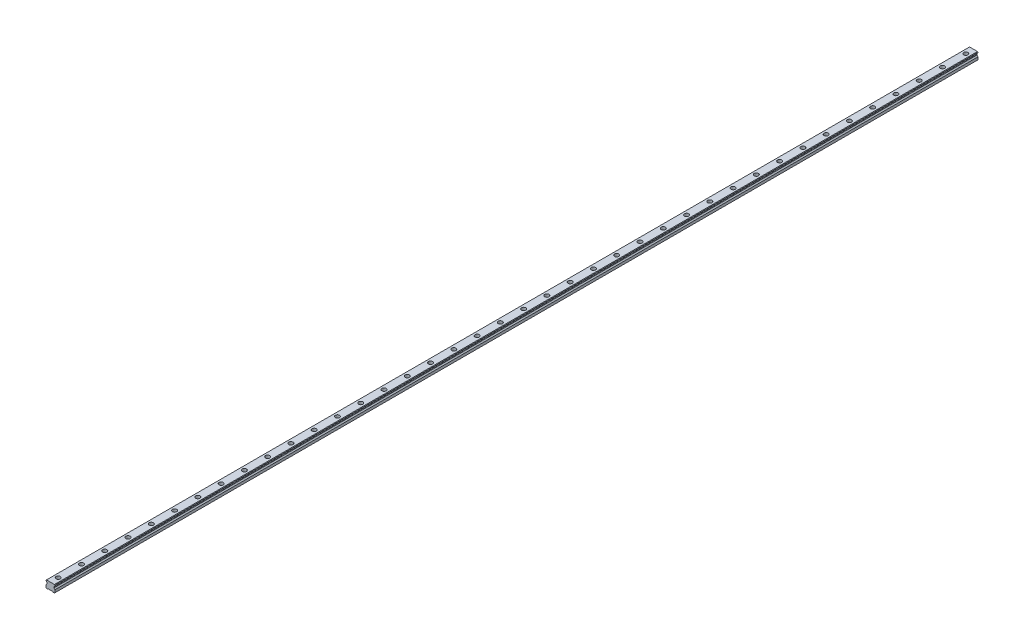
ISO-10303-21;
HEADER;
FILE_DESCRIPTION(('STEP AP214'),'2;1');
FILE_NAME('part.step','',(''),(''),'','','');
FILE_SCHEMA(('AUTOMOTIVE_DESIGN { 1 0 10303 214 1 1 1 1 }'));
ENDSEC;
DATA;
#1=APPLICATION_CONTEXT('core data for automotive mechanical design processes');
#2=APPLICATION_PROTOCOL_DEFINITION('international standard','automotive_design',2000,#1);
#3=PRODUCT_CONTEXT('',#1,'mechanical');
#4=PRODUCT('Part','Part','',(#3));
#5=PRODUCT_RELATED_PRODUCT_CATEGORY('part','',(#4));
#6=PRODUCT_DEFINITION_FORMATION('','',#4);
#7=PRODUCT_DEFINITION_CONTEXT('part definition',#1,'design');
#8=PRODUCT_DEFINITION('design','',#6,#7);
#9=PRODUCT_DEFINITION_SHAPE('','',#8);
#10=(LENGTH_UNIT() NAMED_UNIT(*) SI_UNIT(.MILLI.,.METRE.));
#11=(NAMED_UNIT(*) PLANE_ANGLE_UNIT() SI_UNIT($,.RADIAN.));
#12=(NAMED_UNIT(*) SI_UNIT($,.STERADIAN.) SOLID_ANGLE_UNIT());
#13=UNCERTAINTY_MEASURE_WITH_UNIT(LENGTH_MEASURE(1.E-05),#10,'distance_accuracy_value','');
#14=(GEOMETRIC_REPRESENTATION_CONTEXT(3) GLOBAL_UNCERTAINTY_ASSIGNED_CONTEXT((#13)) GLOBAL_UNIT_ASSIGNED_CONTEXT((#10,
#11,#12)) REPRESENTATION_CONTEXT('',''));
#15=CARTESIAN_POINT('',(0.,0.,0.));
#16=DIRECTION('',(0.,0.,1.));
#17=DIRECTION('',(1.,0.,0.));
#18=AXIS2_PLACEMENT_3D('',#15,#16,#17);
#19=CARTESIAN_POINT('',(0.,10.2,-1170.));
#20=DIRECTION('',(0.,1.,0.));
#21=DIRECTION('',(0.,0.,1.));
#22=AXIS2_PLACEMENT_3D('',#19,#20,#21);
#23=PLANE('',#22);
#24=CARTESIAN_POINT('',(0.,10.2,-1170.));
#25=DIRECTION('',(0.,1.,0.));
#26=DIRECTION('',(0.,0.,1.));
#27=AXIS2_PLACEMENT_3D('',#24,#25,#26);
#28=CIRCLE('',#27,3.49999999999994);
#29=CARTESIAN_POINT('',(0.,10.2,-1166.5));
#30=VERTEX_POINT('',#29);
#31=EDGE_CURVE('E662',#30,#30,#28,.T.);
#32=ORIENTED_EDGE('',*,*,#31,.F.);
#33=EDGE_LOOP('',(#32));
#34=FACE_BOUND('',#33,.T.);
#35=CARTESIAN_POINT('',(0.,10.2,-1170.));
#36=DIRECTION('',(0.,1.,0.));
#37=DIRECTION('',(0.,0.,1.));
#38=AXIS2_PLACEMENT_3D('',#35,#36,#37);
#39=CIRCLE('',#38,5.49999999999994);
#40=CARTESIAN_POINT('',(0.,10.2,-1164.5));
#41=VERTEX_POINT('',#40);
#42=EDGE_CURVE('E11',#41,#41,#39,.T.);
#43=ORIENTED_EDGE('',*,*,#42,.T.);
#44=EDGE_LOOP('',(#43));
#45=FACE_BOUND('',#44,.T.);
#46=ADVANCED_FACE('F39',(#34,#45),#23,.T.);
#47=CARTESIAN_POINT('',(0.,10.2,-1170.));
#48=DIRECTION('',(0.,1.,0.));
#49=DIRECTION('',(0.,0.,1.));
#50=AXIS2_PLACEMENT_3D('',#47,#48,#49);
#51=CYLINDRICAL_SURFACE('',#50,5.49999999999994);
#52=ORIENTED_EDGE('',*,*,#42,.F.);
#53=EDGE_LOOP('',(#52));
#54=FACE_BOUND('',#53,.T.);
#55=CARTESIAN_POINT('',(0.,19.2,-1170.));
#56=DIRECTION('',(0.,1.,0.));
#57=DIRECTION('',(0.,0.,1.));
#58=AXIS2_PLACEMENT_3D('',#55,#56,#57);
#59=CIRCLE('',#58,5.49999999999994);
#60=CARTESIAN_POINT('',(0.,19.2,-1164.5));
#61=VERTEX_POINT('',#60);
#62=EDGE_CURVE('E48',#61,#61,#59,.T.);
#63=ORIENTED_EDGE('',*,*,#62,.T.);
#64=EDGE_LOOP('',(#63));
#65=FACE_BOUND('',#64,.T.);
#66=ADVANCED_FACE('F1162',(#54,#65),#51,.F.);
#67=CARTESIAN_POINT('',(0.,10.2,-1110.));
#68=DIRECTION('',(0.,1.,0.));
#69=DIRECTION('',(0.,0.,1.));
#70=AXIS2_PLACEMENT_3D('',#67,#68,#69);
#71=PLANE('',#70);
#72=CARTESIAN_POINT('',(0.,10.2,-1110.));
#73=DIRECTION('',(0.,1.,0.));
#74=DIRECTION('',(0.,0.,1.));
#75=AXIS2_PLACEMENT_3D('',#72,#73,#74);
#76=CIRCLE('',#75,3.49999999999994);
#77=CARTESIAN_POINT('',(0.,10.2,-1106.5));
#78=VERTEX_POINT('',#77);
#79=EDGE_CURVE('E667',#78,#78,#76,.T.);
#80=ORIENTED_EDGE('',*,*,#79,.F.);
#81=EDGE_LOOP('',(#80));
#82=FACE_BOUND('',#81,.T.);
#83=CARTESIAN_POINT('',(0.,10.2,-1110.));
#84=DIRECTION('',(0.,1.,0.));
#85=DIRECTION('',(0.,0.,1.));
#86=AXIS2_PLACEMENT_3D('',#83,#84,#85);
#87=CIRCLE('',#86,5.49999999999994);
#88=CARTESIAN_POINT('',(0.,10.2,-1104.5));
#89=VERTEX_POINT('',#88);
#90=EDGE_CURVE('E646',#89,#89,#87,.T.);
#91=ORIENTED_EDGE('',*,*,#90,.T.);
#92=EDGE_LOOP('',(#91));
#93=FACE_BOUND('',#92,.T.);
#94=ADVANCED_FACE('F1164',(#82,#93),#71,.T.);
#95=CARTESIAN_POINT('',(0.,10.2,-1110.));
#96=DIRECTION('',(0.,1.,0.));
#97=DIRECTION('',(0.,0.,1.));
#98=AXIS2_PLACEMENT_3D('',#95,#96,#97);
#99=CYLINDRICAL_SURFACE('',#98,5.49999999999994);
#100=ORIENTED_EDGE('',*,*,#90,.F.);
#101=EDGE_LOOP('',(#100));
#102=FACE_BOUND('',#101,.T.);
#103=CARTESIAN_POINT('',(0.,19.2,-1110.));
#104=DIRECTION('',(0.,1.,0.));
#105=DIRECTION('',(0.,0.,1.));
#106=AXIS2_PLACEMENT_3D('',#103,#104,#105);
#107=CIRCLE('',#106,5.49999999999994);
#108=CARTESIAN_POINT('',(0.,19.2,-1104.5));
#109=VERTEX_POINT('',#108);
#110=EDGE_CURVE('E642',#109,#109,#107,.T.);
#111=ORIENTED_EDGE('',*,*,#110,.T.);
#112=EDGE_LOOP('',(#111));
#113=FACE_BOUND('',#112,.T.);
#114=ADVANCED_FACE('F1170',(#102,#113),#99,.F.);
#115=CARTESIAN_POINT('',(0.,10.2,-1050.));
#116=DIRECTION('',(0.,1.,0.));
#117=DIRECTION('',(0.,0.,1.));
#118=AXIS2_PLACEMENT_3D('',#115,#116,#117);
#119=PLANE('',#118);
#120=CARTESIAN_POINT('',(0.,10.2,-1050.));
#121=DIRECTION('',(0.,1.,0.));
#122=DIRECTION('',(0.,0.,1.));
#123=AXIS2_PLACEMENT_3D('',#120,#121,#122);
#124=CIRCLE('',#123,3.49999999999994);
#125=CARTESIAN_POINT('',(0.,10.2,-1046.5));
#126=VERTEX_POINT('',#125);
#127=EDGE_CURVE('E672',#126,#126,#124,.T.);
#128=ORIENTED_EDGE('',*,*,#127,.F.);
#129=EDGE_LOOP('',(#128));
#130=FACE_BOUND('',#129,.T.);
#131=CARTESIAN_POINT('',(0.,10.2,-1050.));
#132=DIRECTION('',(0.,1.,0.));
#133=DIRECTION('',(0.,0.,1.));
#134=AXIS2_PLACEMENT_3D('',#131,#132,#133);
#135=CIRCLE('',#134,5.49999999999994);
#136=CARTESIAN_POINT('',(0.,10.2,-1044.5));
#137=VERTEX_POINT('',#136);
#138=EDGE_CURVE('E638',#137,#137,#135,.T.);
#139=ORIENTED_EDGE('',*,*,#138,.T.);
#140=EDGE_LOOP('',(#139));
#141=FACE_BOUND('',#140,.T.);
#142=ADVANCED_FACE('F1178',(#130,#141),#119,.T.);
#143=CARTESIAN_POINT('',(0.,10.2,-1050.));
#144=DIRECTION('',(0.,1.,0.));
#145=DIRECTION('',(0.,0.,1.));
#146=AXIS2_PLACEMENT_3D('',#143,#144,#145);
#147=CYLINDRICAL_SURFACE('',#146,5.49999999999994);
#148=ORIENTED_EDGE('',*,*,#138,.F.);
#149=EDGE_LOOP('',(#148));
#150=FACE_BOUND('',#149,.T.);
#151=CARTESIAN_POINT('',(0.,19.2,-1050.));
#152=DIRECTION('',(0.,1.,0.));
#153=DIRECTION('',(0.,0.,1.));
#154=AXIS2_PLACEMENT_3D('',#151,#152,#153);
#155=CIRCLE('',#154,5.49999999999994);
#156=CARTESIAN_POINT('',(0.,19.2,-1044.5));
#157=VERTEX_POINT('',#156);
#158=EDGE_CURVE('E634',#157,#157,#155,.T.);
#159=ORIENTED_EDGE('',*,*,#158,.T.);
#160=EDGE_LOOP('',(#159));
#161=FACE_BOUND('',#160,.T.);
#162=ADVANCED_FACE('F1182',(#150,#161),#147,.F.);
#163=CARTESIAN_POINT('',(0.,10.2,-990.));
#164=DIRECTION('',(0.,1.,0.));
#165=DIRECTION('',(0.,0.,1.));
#166=AXIS2_PLACEMENT_3D('',#163,#164,#165);
#167=PLANE('',#166);
#168=CARTESIAN_POINT('',(0.,10.2,-990.));
#169=DIRECTION('',(0.,1.,0.));
#170=DIRECTION('',(0.,0.,1.));
#171=AXIS2_PLACEMENT_3D('',#168,#169,#170);
#172=CIRCLE('',#171,3.49999999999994);
#173=CARTESIAN_POINT('',(0.,10.2,-986.5));
#174=VERTEX_POINT('',#173);
#175=EDGE_CURVE('E677',#174,#174,#172,.T.);
#176=ORIENTED_EDGE('',*,*,#175,.F.);
#177=EDGE_LOOP('',(#176));
#178=FACE_BOUND('',#177,.T.);
#179=CARTESIAN_POINT('',(0.,10.2,-990.));
#180=DIRECTION('',(0.,1.,0.));
#181=DIRECTION('',(0.,0.,1.));
#182=AXIS2_PLACEMENT_3D('',#179,#180,#181);
#183=CIRCLE('',#182,5.49999999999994);
#184=CARTESIAN_POINT('',(0.,10.2,-984.5));
#185=VERTEX_POINT('',#184);
#186=EDGE_CURVE('E630',#185,#185,#183,.T.);
#187=ORIENTED_EDGE('',*,*,#186,.T.);
#188=EDGE_LOOP('',(#187));
#189=FACE_BOUND('',#188,.T.);
#190=ADVANCED_FACE('F1186',(#178,#189),#167,.T.);
#191=CARTESIAN_POINT('',(0.,10.2,-990.));
#192=DIRECTION('',(0.,1.,0.));
#193=DIRECTION('',(0.,0.,1.));
#194=AXIS2_PLACEMENT_3D('',#191,#192,#193);
#195=CYLINDRICAL_SURFACE('',#194,5.49999999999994);
#196=ORIENTED_EDGE('',*,*,#186,.F.);
#197=EDGE_LOOP('',(#196));
#198=FACE_BOUND('',#197,.T.);
#199=CARTESIAN_POINT('',(0.,19.2,-990.));
#200=DIRECTION('',(0.,1.,0.));
#201=DIRECTION('',(0.,0.,1.));
#202=AXIS2_PLACEMENT_3D('',#199,#200,#201);
#203=CIRCLE('',#202,5.49999999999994);
#204=CARTESIAN_POINT('',(0.,19.2,-984.5));
#205=VERTEX_POINT('',#204);
#206=EDGE_CURVE('E626',#205,#205,#203,.T.);
#207=ORIENTED_EDGE('',*,*,#206,.T.);
#208=EDGE_LOOP('',(#207));
#209=FACE_BOUND('',#208,.T.);
#210=ADVANCED_FACE('F1190',(#198,#209),#195,.F.);
#211=CARTESIAN_POINT('',(0.,10.2,-930.));
#212=DIRECTION('',(0.,1.,0.));
#213=DIRECTION('',(0.,0.,1.));
#214=AXIS2_PLACEMENT_3D('',#211,#212,#213);
#215=PLANE('',#214);
#216=CARTESIAN_POINT('',(0.,10.2,-930.));
#217=DIRECTION('',(0.,1.,0.));
#218=DIRECTION('',(0.,0.,1.));
#219=AXIS2_PLACEMENT_3D('',#216,#217,#218);
#220=CIRCLE('',#219,3.49999999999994);
#221=CARTESIAN_POINT('',(0.,10.2,-926.5));
#222=VERTEX_POINT('',#221);
#223=EDGE_CURVE('E682',#222,#222,#220,.T.);
#224=ORIENTED_EDGE('',*,*,#223,.F.);
#225=EDGE_LOOP('',(#224));
#226=FACE_BOUND('',#225,.T.);
#227=CARTESIAN_POINT('',(0.,10.2,-930.));
#228=DIRECTION('',(0.,1.,0.));
#229=DIRECTION('',(0.,0.,1.));
#230=AXIS2_PLACEMENT_3D('',#227,#228,#229);
#231=CIRCLE('',#230,5.49999999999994);
#232=CARTESIAN_POINT('',(0.,10.2,-924.5));
#233=VERTEX_POINT('',#232);
#234=EDGE_CURVE('E622',#233,#233,#231,.T.);
#235=ORIENTED_EDGE('',*,*,#234,.T.);
#236=EDGE_LOOP('',(#235));
#237=FACE_BOUND('',#236,.T.);
#238=ADVANCED_FACE('F1194',(#226,#237),#215,.T.);
#239=CARTESIAN_POINT('',(0.,10.2,-930.));
#240=DIRECTION('',(0.,1.,0.));
#241=DIRECTION('',(0.,0.,1.));
#242=AXIS2_PLACEMENT_3D('',#239,#240,#241);
#243=CYLINDRICAL_SURFACE('',#242,5.49999999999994);
#244=ORIENTED_EDGE('',*,*,#234,.F.);
#245=EDGE_LOOP('',(#244));
#246=FACE_BOUND('',#245,.T.);
#247=CARTESIAN_POINT('',(0.,19.2,-930.));
#248=DIRECTION('',(0.,1.,0.));
#249=DIRECTION('',(0.,0.,1.));
#250=AXIS2_PLACEMENT_3D('',#247,#248,#249);
#251=CIRCLE('',#250,5.49999999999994);
#252=CARTESIAN_POINT('',(0.,19.2,-924.5));
#253=VERTEX_POINT('',#252);
#254=EDGE_CURVE('E618',#253,#253,#251,.T.);
#255=ORIENTED_EDGE('',*,*,#254,.T.);
#256=EDGE_LOOP('',(#255));
#257=FACE_BOUND('',#256,.T.);
#258=ADVANCED_FACE('F1198',(#246,#257),#243,.F.);
#259=CARTESIAN_POINT('',(0.,10.2,-870.));
#260=DIRECTION('',(0.,1.,0.));
#261=DIRECTION('',(0.,0.,1.));
#262=AXIS2_PLACEMENT_3D('',#259,#260,#261);
#263=PLANE('',#262);
#264=CARTESIAN_POINT('',(0.,10.2,-870.));
#265=DIRECTION('',(0.,1.,0.));
#266=DIRECTION('',(0.,0.,1.));
#267=AXIS2_PLACEMENT_3D('',#264,#265,#266);
#268=CIRCLE('',#267,3.49999999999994);
#269=CARTESIAN_POINT('',(0.,10.2,-866.5));
#270=VERTEX_POINT('',#269);
#271=EDGE_CURVE('E687',#270,#270,#268,.T.);
#272=ORIENTED_EDGE('',*,*,#271,.F.);
#273=EDGE_LOOP('',(#272));
#274=FACE_BOUND('',#273,.T.);
#275=CARTESIAN_POINT('',(0.,10.2,-870.));
#276=DIRECTION('',(0.,1.,0.));
#277=DIRECTION('',(0.,0.,1.));
#278=AXIS2_PLACEMENT_3D('',#275,#276,#277);
#279=CIRCLE('',#278,5.49999999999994);
#280=CARTESIAN_POINT('',(0.,10.2,-864.5));
#281=VERTEX_POINT('',#280);
#282=EDGE_CURVE('E614',#281,#281,#279,.T.);
#283=ORIENTED_EDGE('',*,*,#282,.T.);
#284=EDGE_LOOP('',(#283));
#285=FACE_BOUND('',#284,.T.);
#286=ADVANCED_FACE('F1202',(#274,#285),#263,.T.);
#287=CARTESIAN_POINT('',(0.,10.2,-870.));
#288=DIRECTION('',(0.,1.,0.));
#289=DIRECTION('',(0.,0.,1.));
#290=AXIS2_PLACEMENT_3D('',#287,#288,#289);
#291=CYLINDRICAL_SURFACE('',#290,5.49999999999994);
#292=ORIENTED_EDGE('',*,*,#282,.F.);
#293=EDGE_LOOP('',(#292));
#294=FACE_BOUND('',#293,.T.);
#295=CARTESIAN_POINT('',(0.,19.2,-870.));
#296=DIRECTION('',(0.,1.,0.));
#297=DIRECTION('',(0.,0.,1.));
#298=AXIS2_PLACEMENT_3D('',#295,#296,#297);
#299=CIRCLE('',#298,5.49999999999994);
#300=CARTESIAN_POINT('',(0.,19.2,-864.5));
#301=VERTEX_POINT('',#300);
#302=EDGE_CURVE('E610',#301,#301,#299,.T.);
#303=ORIENTED_EDGE('',*,*,#302,.T.);
#304=EDGE_LOOP('',(#303));
#305=FACE_BOUND('',#304,.T.);
#306=ADVANCED_FACE('F1206',(#294,#305),#291,.F.);
#307=CARTESIAN_POINT('',(0.,10.2,-810.));
#308=DIRECTION('',(0.,1.,0.));
#309=DIRECTION('',(0.,0.,1.));
#310=AXIS2_PLACEMENT_3D('',#307,#308,#309);
#311=PLANE('',#310);
#312=CARTESIAN_POINT('',(0.,10.2,-810.));
#313=DIRECTION('',(0.,1.,0.));
#314=DIRECTION('',(0.,0.,1.));
#315=AXIS2_PLACEMENT_3D('',#312,#313,#314);
#316=CIRCLE('',#315,3.49999999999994);
#317=CARTESIAN_POINT('',(0.,10.2,-806.5));
#318=VERTEX_POINT('',#317);
#319=EDGE_CURVE('E692',#318,#318,#316,.T.);
#320=ORIENTED_EDGE('',*,*,#319,.F.);
#321=EDGE_LOOP('',(#320));
#322=FACE_BOUND('',#321,.T.);
#323=CARTESIAN_POINT('',(0.,10.2,-810.));
#324=DIRECTION('',(0.,1.,0.));
#325=DIRECTION('',(0.,0.,1.));
#326=AXIS2_PLACEMENT_3D('',#323,#324,#325);
#327=CIRCLE('',#326,5.49999999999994);
#328=CARTESIAN_POINT('',(0.,10.2,-804.5));
#329=VERTEX_POINT('',#328);
#330=EDGE_CURVE('E606',#329,#329,#327,.T.);
#331=ORIENTED_EDGE('',*,*,#330,.T.);
#332=EDGE_LOOP('',(#331));
#333=FACE_BOUND('',#332,.T.);
#334=ADVANCED_FACE('F1210',(#322,#333),#311,.T.);
#335=CARTESIAN_POINT('',(0.,10.2,-810.));
#336=DIRECTION('',(0.,1.,0.));
#337=DIRECTION('',(0.,0.,1.));
#338=AXIS2_PLACEMENT_3D('',#335,#336,#337);
#339=CYLINDRICAL_SURFACE('',#338,5.49999999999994);
#340=ORIENTED_EDGE('',*,*,#330,.F.);
#341=EDGE_LOOP('',(#340));
#342=FACE_BOUND('',#341,.T.);
#343=CARTESIAN_POINT('',(0.,19.2,-810.));
#344=DIRECTION('',(0.,1.,0.));
#345=DIRECTION('',(0.,0.,1.));
#346=AXIS2_PLACEMENT_3D('',#343,#344,#345);
#347=CIRCLE('',#346,5.49999999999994);
#348=CARTESIAN_POINT('',(0.,19.2,-804.5));
#349=VERTEX_POINT('',#348);
#350=EDGE_CURVE('E602',#349,#349,#347,.T.);
#351=ORIENTED_EDGE('',*,*,#350,.T.);
#352=EDGE_LOOP('',(#351));
#353=FACE_BOUND('',#352,.T.);
#354=ADVANCED_FACE('F1214',(#342,#353),#339,.F.);
#355=CARTESIAN_POINT('',(0.,10.2,-750.));
#356=DIRECTION('',(0.,1.,0.));
#357=DIRECTION('',(0.,0.,1.));
#358=AXIS2_PLACEMENT_3D('',#355,#356,#357);
#359=PLANE('',#358);
#360=CARTESIAN_POINT('',(0.,10.2,-750.));
#361=DIRECTION('',(0.,1.,0.));
#362=DIRECTION('',(0.,0.,1.));
#363=AXIS2_PLACEMENT_3D('',#360,#361,#362);
#364=CIRCLE('',#363,3.49999999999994);
#365=CARTESIAN_POINT('',(0.,10.2,-746.5));
#366=VERTEX_POINT('',#365);
#367=EDGE_CURVE('E697',#366,#366,#364,.T.);
#368=ORIENTED_EDGE('',*,*,#367,.F.);
#369=EDGE_LOOP('',(#368));
#370=FACE_BOUND('',#369,.T.);
#371=CARTESIAN_POINT('',(0.,10.2,-750.));
#372=DIRECTION('',(0.,1.,0.));
#373=DIRECTION('',(0.,0.,1.));
#374=AXIS2_PLACEMENT_3D('',#371,#372,#373);
#375=CIRCLE('',#374,5.49999999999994);
#376=CARTESIAN_POINT('',(0.,10.2,-744.5));
#377=VERTEX_POINT('',#376);
#378=EDGE_CURVE('E598',#377,#377,#375,.T.);
#379=ORIENTED_EDGE('',*,*,#378,.T.);
#380=EDGE_LOOP('',(#379));
#381=FACE_BOUND('',#380,.T.);
#382=ADVANCED_FACE('F1218',(#370,#381),#359,.T.);
#383=CARTESIAN_POINT('',(0.,10.2,-750.));
#384=DIRECTION('',(0.,1.,0.));
#385=DIRECTION('',(0.,0.,1.));
#386=AXIS2_PLACEMENT_3D('',#383,#384,#385);
#387=CYLINDRICAL_SURFACE('',#386,5.49999999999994);
#388=ORIENTED_EDGE('',*,*,#378,.F.);
#389=EDGE_LOOP('',(#388));
#390=FACE_BOUND('',#389,.T.);
#391=CARTESIAN_POINT('',(0.,19.2,-750.));
#392=DIRECTION('',(0.,1.,0.));
#393=DIRECTION('',(0.,0.,1.));
#394=AXIS2_PLACEMENT_3D('',#391,#392,#393);
#395=CIRCLE('',#394,5.49999999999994);
#396=CARTESIAN_POINT('',(0.,19.2,-744.5));
#397=VERTEX_POINT('',#396);
#398=EDGE_CURVE('E594',#397,#397,#395,.T.);
#399=ORIENTED_EDGE('',*,*,#398,.T.);
#400=EDGE_LOOP('',(#399));
#401=FACE_BOUND('',#400,.T.);
#402=ADVANCED_FACE('F1222',(#390,#401),#387,.F.);
#403=CARTESIAN_POINT('',(0.,10.2,-690.));
#404=DIRECTION('',(0.,1.,0.));
#405=DIRECTION('',(0.,0.,1.));
#406=AXIS2_PLACEMENT_3D('',#403,#404,#405);
#407=PLANE('',#406);
#408=CARTESIAN_POINT('',(0.,10.2,-690.));
#409=DIRECTION('',(0.,1.,0.));
#410=DIRECTION('',(0.,0.,1.));
#411=AXIS2_PLACEMENT_3D('',#408,#409,#410);
#412=CIRCLE('',#411,3.49999999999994);
#413=CARTESIAN_POINT('',(0.,10.2,-686.5));
#414=VERTEX_POINT('',#413);
#415=EDGE_CURVE('E702',#414,#414,#412,.T.);
#416=ORIENTED_EDGE('',*,*,#415,.F.);
#417=EDGE_LOOP('',(#416));
#418=FACE_BOUND('',#417,.T.);
#419=CARTESIAN_POINT('',(0.,10.2,-690.));
#420=DIRECTION('',(0.,1.,0.));
#421=DIRECTION('',(0.,0.,1.));
#422=AXIS2_PLACEMENT_3D('',#419,#420,#421);
#423=CIRCLE('',#422,5.49999999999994);
#424=CARTESIAN_POINT('',(0.,10.2,-684.5));
#425=VERTEX_POINT('',#424);
#426=EDGE_CURVE('E590',#425,#425,#423,.T.);
#427=ORIENTED_EDGE('',*,*,#426,.T.);
#428=EDGE_LOOP('',(#427));
#429=FACE_BOUND('',#428,.T.);
#430=ADVANCED_FACE('F1226',(#418,#429),#407,.T.);
#431=CARTESIAN_POINT('',(0.,10.2,-690.));
#432=DIRECTION('',(0.,1.,0.));
#433=DIRECTION('',(0.,0.,1.));
#434=AXIS2_PLACEMENT_3D('',#431,#432,#433);
#435=CYLINDRICAL_SURFACE('',#434,5.49999999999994);
#436=ORIENTED_EDGE('',*,*,#426,.F.);
#437=EDGE_LOOP('',(#436));
#438=FACE_BOUND('',#437,.T.);
#439=CARTESIAN_POINT('',(0.,19.2,-690.));
#440=DIRECTION('',(0.,1.,0.));
#441=DIRECTION('',(0.,0.,1.));
#442=AXIS2_PLACEMENT_3D('',#439,#440,#441);
#443=CIRCLE('',#442,5.49999999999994);
#444=CARTESIAN_POINT('',(0.,19.2,-684.5));
#445=VERTEX_POINT('',#444);
#446=EDGE_CURVE('E586',#445,#445,#443,.T.);
#447=ORIENTED_EDGE('',*,*,#446,.T.);
#448=EDGE_LOOP('',(#447));
#449=FACE_BOUND('',#448,.T.);
#450=ADVANCED_FACE('F1230',(#438,#449),#435,.F.);
#451=CARTESIAN_POINT('',(0.,10.2,-630.));
#452=DIRECTION('',(0.,1.,0.));
#453=DIRECTION('',(0.,0.,1.));
#454=AXIS2_PLACEMENT_3D('',#451,#452,#453);
#455=PLANE('',#454);
#456=CARTESIAN_POINT('',(0.,10.2,-630.));
#457=DIRECTION('',(0.,1.,0.));
#458=DIRECTION('',(0.,0.,1.));
#459=AXIS2_PLACEMENT_3D('',#456,#457,#458);
#460=CIRCLE('',#459,3.49999999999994);
#461=CARTESIAN_POINT('',(0.,10.2,-626.5));
#462=VERTEX_POINT('',#461);
#463=EDGE_CURVE('E707',#462,#462,#460,.T.);
#464=ORIENTED_EDGE('',*,*,#463,.F.);
#465=EDGE_LOOP('',(#464));
#466=FACE_BOUND('',#465,.T.);
#467=CARTESIAN_POINT('',(0.,10.2,-630.));
#468=DIRECTION('',(0.,1.,0.));
#469=DIRECTION('',(0.,0.,1.));
#470=AXIS2_PLACEMENT_3D('',#467,#468,#469);
#471=CIRCLE('',#470,5.49999999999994);
#472=CARTESIAN_POINT('',(0.,10.2,-624.5));
#473=VERTEX_POINT('',#472);
#474=EDGE_CURVE('E582',#473,#473,#471,.T.);
#475=ORIENTED_EDGE('',*,*,#474,.T.);
#476=EDGE_LOOP('',(#475));
#477=FACE_BOUND('',#476,.T.);
#478=ADVANCED_FACE('F1234',(#466,#477),#455,.T.);
#479=CARTESIAN_POINT('',(0.,10.2,-630.));
#480=DIRECTION('',(0.,1.,0.));
#481=DIRECTION('',(0.,0.,1.));
#482=AXIS2_PLACEMENT_3D('',#479,#480,#481);
#483=CYLINDRICAL_SURFACE('',#482,5.49999999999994);
#484=ORIENTED_EDGE('',*,*,#474,.F.);
#485=EDGE_LOOP('',(#484));
#486=FACE_BOUND('',#485,.T.);
#487=CARTESIAN_POINT('',(0.,19.2,-630.));
#488=DIRECTION('',(0.,1.,0.));
#489=DIRECTION('',(0.,0.,1.));
#490=AXIS2_PLACEMENT_3D('',#487,#488,#489);
#491=CIRCLE('',#490,5.49999999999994);
#492=CARTESIAN_POINT('',(0.,19.2,-624.5));
#493=VERTEX_POINT('',#492);
#494=EDGE_CURVE('E578',#493,#493,#491,.T.);
#495=ORIENTED_EDGE('',*,*,#494,.T.);
#496=EDGE_LOOP('',(#495));
#497=FACE_BOUND('',#496,.T.);
#498=ADVANCED_FACE('F1238',(#486,#497),#483,.F.);
#499=CARTESIAN_POINT('',(0.,10.2,-570.));
#500=DIRECTION('',(0.,1.,0.));
#501=DIRECTION('',(0.,0.,1.));
#502=AXIS2_PLACEMENT_3D('',#499,#500,#501);
#503=PLANE('',#502);
#504=CARTESIAN_POINT('',(0.,10.2,-570.));
#505=DIRECTION('',(0.,1.,0.));
#506=DIRECTION('',(0.,0.,1.));
#507=AXIS2_PLACEMENT_3D('',#504,#505,#506);
#508=CIRCLE('',#507,3.49999999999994);
#509=CARTESIAN_POINT('',(0.,10.2,-566.5));
#510=VERTEX_POINT('',#509);
#511=EDGE_CURVE('E712',#510,#510,#508,.T.);
#512=ORIENTED_EDGE('',*,*,#511,.F.);
#513=EDGE_LOOP('',(#512));
#514=FACE_BOUND('',#513,.T.);
#515=CARTESIAN_POINT('',(0.,10.2,-570.));
#516=DIRECTION('',(0.,1.,0.));
#517=DIRECTION('',(0.,0.,1.));
#518=AXIS2_PLACEMENT_3D('',#515,#516,#517);
#519=CIRCLE('',#518,5.49999999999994);
#520=CARTESIAN_POINT('',(0.,10.2,-564.5));
#521=VERTEX_POINT('',#520);
#522=EDGE_CURVE('E574',#521,#521,#519,.T.);
#523=ORIENTED_EDGE('',*,*,#522,.T.);
#524=EDGE_LOOP('',(#523));
#525=FACE_BOUND('',#524,.T.);
#526=ADVANCED_FACE('F1242',(#514,#525),#503,.T.);
#527=CARTESIAN_POINT('',(0.,10.2,-570.));
#528=DIRECTION('',(0.,1.,0.));
#529=DIRECTION('',(0.,0.,1.));
#530=AXIS2_PLACEMENT_3D('',#527,#528,#529);
#531=CYLINDRICAL_SURFACE('',#530,5.49999999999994);
#532=ORIENTED_EDGE('',*,*,#522,.F.);
#533=EDGE_LOOP('',(#532));
#534=FACE_BOUND('',#533,.T.);
#535=CARTESIAN_POINT('',(0.,19.2,-570.));
#536=DIRECTION('',(0.,1.,0.));
#537=DIRECTION('',(0.,0.,1.));
#538=AXIS2_PLACEMENT_3D('',#535,#536,#537);
#539=CIRCLE('',#538,5.49999999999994);
#540=CARTESIAN_POINT('',(0.,19.2,-564.5));
#541=VERTEX_POINT('',#540);
#542=EDGE_CURVE('E570',#541,#541,#539,.T.);
#543=ORIENTED_EDGE('',*,*,#542,.T.);
#544=EDGE_LOOP('',(#543));
#545=FACE_BOUND('',#544,.T.);
#546=ADVANCED_FACE('F1246',(#534,#545),#531,.F.);
#547=CARTESIAN_POINT('',(0.,10.2,-510.));
#548=DIRECTION('',(0.,1.,0.));
#549=DIRECTION('',(0.,0.,1.));
#550=AXIS2_PLACEMENT_3D('',#547,#548,#549);
#551=PLANE('',#550);
#552=CARTESIAN_POINT('',(0.,10.2,-510.));
#553=DIRECTION('',(0.,1.,0.));
#554=DIRECTION('',(0.,0.,1.));
#555=AXIS2_PLACEMENT_3D('',#552,#553,#554);
#556=CIRCLE('',#555,3.49999999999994);
#557=CARTESIAN_POINT('',(0.,10.2,-506.5));
#558=VERTEX_POINT('',#557);
#559=EDGE_CURVE('E717',#558,#558,#556,.T.);
#560=ORIENTED_EDGE('',*,*,#559,.F.);
#561=EDGE_LOOP('',(#560));
#562=FACE_BOUND('',#561,.T.);
#563=CARTESIAN_POINT('',(0.,10.2,-510.));
#564=DIRECTION('',(0.,1.,0.));
#565=DIRECTION('',(0.,0.,1.));
#566=AXIS2_PLACEMENT_3D('',#563,#564,#565);
#567=CIRCLE('',#566,5.49999999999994);
#568=CARTESIAN_POINT('',(0.,10.2,-504.5));
#569=VERTEX_POINT('',#568);
#570=EDGE_CURVE('E566',#569,#569,#567,.T.);
#571=ORIENTED_EDGE('',*,*,#570,.T.);
#572=EDGE_LOOP('',(#571));
#573=FACE_BOUND('',#572,.T.);
#574=ADVANCED_FACE('F1250',(#562,#573),#551,.T.);
#575=CARTESIAN_POINT('',(0.,10.2,-510.));
#576=DIRECTION('',(0.,1.,0.));
#577=DIRECTION('',(0.,0.,1.));
#578=AXIS2_PLACEMENT_3D('',#575,#576,#577);
#579=CYLINDRICAL_SURFACE('',#578,5.49999999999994);
#580=ORIENTED_EDGE('',*,*,#570,.F.);
#581=EDGE_LOOP('',(#580));
#582=FACE_BOUND('',#581,.T.);
#583=CARTESIAN_POINT('',(0.,19.2,-510.));
#584=DIRECTION('',(0.,1.,0.));
#585=DIRECTION('',(0.,0.,1.));
#586=AXIS2_PLACEMENT_3D('',#583,#584,#585);
#587=CIRCLE('',#586,5.49999999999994);
#588=CARTESIAN_POINT('',(0.,19.2,-504.5));
#589=VERTEX_POINT('',#588);
#590=EDGE_CURVE('E562',#589,#589,#587,.T.);
#591=ORIENTED_EDGE('',*,*,#590,.T.);
#592=EDGE_LOOP('',(#591));
#593=FACE_BOUND('',#592,.T.);
#594=ADVANCED_FACE('F1254',(#582,#593),#579,.F.);
#595=CARTESIAN_POINT('',(0.,10.2,-450.));
#596=DIRECTION('',(0.,1.,0.));
#597=DIRECTION('',(0.,0.,1.));
#598=AXIS2_PLACEMENT_3D('',#595,#596,#597);
#599=PLANE('',#598);
#600=CARTESIAN_POINT('',(0.,10.2,-450.));
#601=DIRECTION('',(0.,1.,0.));
#602=DIRECTION('',(0.,0.,1.));
#603=AXIS2_PLACEMENT_3D('',#600,#601,#602);
#604=CIRCLE('',#603,3.49999999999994);
#605=CARTESIAN_POINT('',(0.,10.2,-446.5));
#606=VERTEX_POINT('',#605);
#607=EDGE_CURVE('E722',#606,#606,#604,.T.);
#608=ORIENTED_EDGE('',*,*,#607,.F.);
#609=EDGE_LOOP('',(#608));
#610=FACE_BOUND('',#609,.T.);
#611=CARTESIAN_POINT('',(0.,10.2,-450.));
#612=DIRECTION('',(0.,1.,0.));
#613=DIRECTION('',(0.,0.,1.));
#614=AXIS2_PLACEMENT_3D('',#611,#612,#613);
#615=CIRCLE('',#614,5.49999999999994);
#616=CARTESIAN_POINT('',(0.,10.2,-444.5));
#617=VERTEX_POINT('',#616);
#618=EDGE_CURVE('E558',#617,#617,#615,.T.);
#619=ORIENTED_EDGE('',*,*,#618,.T.);
#620=EDGE_LOOP('',(#619));
#621=FACE_BOUND('',#620,.T.);
#622=ADVANCED_FACE('F1258',(#610,#621),#599,.T.);
#623=CARTESIAN_POINT('',(0.,10.2,-450.));
#624=DIRECTION('',(0.,1.,0.));
#625=DIRECTION('',(0.,0.,1.));
#626=AXIS2_PLACEMENT_3D('',#623,#624,#625);
#627=CYLINDRICAL_SURFACE('',#626,5.49999999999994);
#628=ORIENTED_EDGE('',*,*,#618,.F.);
#629=EDGE_LOOP('',(#628));
#630=FACE_BOUND('',#629,.T.);
#631=CARTESIAN_POINT('',(0.,19.2,-450.));
#632=DIRECTION('',(0.,1.,0.));
#633=DIRECTION('',(0.,0.,1.));
#634=AXIS2_PLACEMENT_3D('',#631,#632,#633);
#635=CIRCLE('',#634,5.49999999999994);
#636=CARTESIAN_POINT('',(0.,19.2,-444.5));
#637=VERTEX_POINT('',#636);
#638=EDGE_CURVE('E554',#637,#637,#635,.T.);
#639=ORIENTED_EDGE('',*,*,#638,.T.);
#640=EDGE_LOOP('',(#639));
#641=FACE_BOUND('',#640,.T.);
#642=ADVANCED_FACE('F1262',(#630,#641),#627,.F.);
#643=CARTESIAN_POINT('',(0.,10.2,-390.));
#644=DIRECTION('',(0.,1.,0.));
#645=DIRECTION('',(0.,0.,1.));
#646=AXIS2_PLACEMENT_3D('',#643,#644,#645);
#647=PLANE('',#646);
#648=CARTESIAN_POINT('',(0.,10.2,-390.));
#649=DIRECTION('',(0.,1.,0.));
#650=DIRECTION('',(0.,0.,1.));
#651=AXIS2_PLACEMENT_3D('',#648,#649,#650);
#652=CIRCLE('',#651,3.49999999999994);
#653=CARTESIAN_POINT('',(0.,10.2,-386.5));
#654=VERTEX_POINT('',#653);
#655=EDGE_CURVE('E727',#654,#654,#652,.T.);
#656=ORIENTED_EDGE('',*,*,#655,.F.);
#657=EDGE_LOOP('',(#656));
#658=FACE_BOUND('',#657,.T.);
#659=CARTESIAN_POINT('',(0.,10.2,-390.));
#660=DIRECTION('',(0.,1.,0.));
#661=DIRECTION('',(0.,0.,1.));
#662=AXIS2_PLACEMENT_3D('',#659,#660,#661);
#663=CIRCLE('',#662,5.49999999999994);
#664=CARTESIAN_POINT('',(0.,10.2,-384.5));
#665=VERTEX_POINT('',#664);
#666=EDGE_CURVE('E550',#665,#665,#663,.T.);
#667=ORIENTED_EDGE('',*,*,#666,.T.);
#668=EDGE_LOOP('',(#667));
#669=FACE_BOUND('',#668,.T.);
#670=ADVANCED_FACE('F1266',(#658,#669),#647,.T.);
#671=CARTESIAN_POINT('',(0.,10.2,-390.));
#672=DIRECTION('',(0.,1.,0.));
#673=DIRECTION('',(0.,0.,1.));
#674=AXIS2_PLACEMENT_3D('',#671,#672,#673);
#675=CYLINDRICAL_SURFACE('',#674,5.49999999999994);
#676=ORIENTED_EDGE('',*,*,#666,.F.);
#677=EDGE_LOOP('',(#676));
#678=FACE_BOUND('',#677,.T.);
#679=CARTESIAN_POINT('',(0.,19.2,-390.));
#680=DIRECTION('',(0.,1.,0.));
#681=DIRECTION('',(0.,0.,1.));
#682=AXIS2_PLACEMENT_3D('',#679,#680,#681);
#683=CIRCLE('',#682,5.49999999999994);
#684=CARTESIAN_POINT('',(0.,19.2,-384.5));
#685=VERTEX_POINT('',#684);
#686=EDGE_CURVE('E546',#685,#685,#683,.T.);
#687=ORIENTED_EDGE('',*,*,#686,.T.);
#688=EDGE_LOOP('',(#687));
#689=FACE_BOUND('',#688,.T.);
#690=ADVANCED_FACE('F1270',(#678,#689),#675,.F.);
#691=CARTESIAN_POINT('',(0.,10.2,-330.));
#692=DIRECTION('',(0.,1.,0.));
#693=DIRECTION('',(0.,0.,1.));
#694=AXIS2_PLACEMENT_3D('',#691,#692,#693);
#695=PLANE('',#694);
#696=CARTESIAN_POINT('',(0.,10.2,-330.));
#697=DIRECTION('',(0.,1.,0.));
#698=DIRECTION('',(0.,0.,1.));
#699=AXIS2_PLACEMENT_3D('',#696,#697,#698);
#700=CIRCLE('',#699,3.49999999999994);
#701=CARTESIAN_POINT('',(0.,10.2,-326.5));
#702=VERTEX_POINT('',#701);
#703=EDGE_CURVE('E732',#702,#702,#700,.T.);
#704=ORIENTED_EDGE('',*,*,#703,.F.);
#705=EDGE_LOOP('',(#704));
#706=FACE_BOUND('',#705,.T.);
#707=CARTESIAN_POINT('',(0.,10.2,-330.));
#708=DIRECTION('',(0.,1.,0.));
#709=DIRECTION('',(0.,0.,1.));
#710=AXIS2_PLACEMENT_3D('',#707,#708,#709);
#711=CIRCLE('',#710,5.49999999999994);
#712=CARTESIAN_POINT('',(0.,10.2,-324.5));
#713=VERTEX_POINT('',#712);
#714=EDGE_CURVE('E542',#713,#713,#711,.T.);
#715=ORIENTED_EDGE('',*,*,#714,.T.);
#716=EDGE_LOOP('',(#715));
#717=FACE_BOUND('',#716,.T.);
#718=ADVANCED_FACE('F1274',(#706,#717),#695,.T.);
#719=CARTESIAN_POINT('',(0.,10.2,-330.));
#720=DIRECTION('',(0.,1.,0.));
#721=DIRECTION('',(0.,0.,1.));
#722=AXIS2_PLACEMENT_3D('',#719,#720,#721);
#723=CYLINDRICAL_SURFACE('',#722,5.49999999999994);
#724=ORIENTED_EDGE('',*,*,#714,.F.);
#725=EDGE_LOOP('',(#724));
#726=FACE_BOUND('',#725,.T.);
#727=CARTESIAN_POINT('',(0.,19.2,-330.));
#728=DIRECTION('',(0.,1.,0.));
#729=DIRECTION('',(0.,0.,1.));
#730=AXIS2_PLACEMENT_3D('',#727,#728,#729);
#731=CIRCLE('',#730,5.49999999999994);
#732=CARTESIAN_POINT('',(0.,19.2,-324.5));
#733=VERTEX_POINT('',#732);
#734=EDGE_CURVE('E538',#733,#733,#731,.T.);
#735=ORIENTED_EDGE('',*,*,#734,.T.);
#736=EDGE_LOOP('',(#735));
#737=FACE_BOUND('',#736,.T.);
#738=ADVANCED_FACE('F1278',(#726,#737),#723,.F.);
#739=CARTESIAN_POINT('',(0.,10.2,-270.));
#740=DIRECTION('',(0.,1.,0.));
#741=DIRECTION('',(0.,0.,1.));
#742=AXIS2_PLACEMENT_3D('',#739,#740,#741);
#743=PLANE('',#742);
#744=CARTESIAN_POINT('',(0.,10.2,-270.));
#745=DIRECTION('',(0.,1.,0.));
#746=DIRECTION('',(0.,0.,1.));
#747=AXIS2_PLACEMENT_3D('',#744,#745,#746);
#748=CIRCLE('',#747,3.49999999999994);
#749=CARTESIAN_POINT('',(0.,10.2,-266.5));
#750=VERTEX_POINT('',#749);
#751=EDGE_CURVE('E737',#750,#750,#748,.T.);
#752=ORIENTED_EDGE('',*,*,#751,.F.);
#753=EDGE_LOOP('',(#752));
#754=FACE_BOUND('',#753,.T.);
#755=CARTESIAN_POINT('',(0.,10.2,-270.));
#756=DIRECTION('',(0.,1.,0.));
#757=DIRECTION('',(0.,0.,1.));
#758=AXIS2_PLACEMENT_3D('',#755,#756,#757);
#759=CIRCLE('',#758,5.49999999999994);
#760=CARTESIAN_POINT('',(0.,10.2,-264.5));
#761=VERTEX_POINT('',#760);
#762=EDGE_CURVE('E534',#761,#761,#759,.T.);
#763=ORIENTED_EDGE('',*,*,#762,.T.);
#764=EDGE_LOOP('',(#763));
#765=FACE_BOUND('',#764,.T.);
#766=ADVANCED_FACE('F1282',(#754,#765),#743,.T.);
#767=CARTESIAN_POINT('',(0.,10.2,-270.));
#768=DIRECTION('',(0.,1.,0.));
#769=DIRECTION('',(0.,0.,1.));
#770=AXIS2_PLACEMENT_3D('',#767,#768,#769);
#771=CYLINDRICAL_SURFACE('',#770,5.49999999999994);
#772=ORIENTED_EDGE('',*,*,#762,.F.);
#773=EDGE_LOOP('',(#772));
#774=FACE_BOUND('',#773,.T.);
#775=CARTESIAN_POINT('',(0.,19.2,-270.));
#776=DIRECTION('',(0.,1.,0.));
#777=DIRECTION('',(0.,0.,1.));
#778=AXIS2_PLACEMENT_3D('',#775,#776,#777);
#779=CIRCLE('',#778,5.49999999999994);
#780=CARTESIAN_POINT('',(0.,19.2,-264.5));
#781=VERTEX_POINT('',#780);
#782=EDGE_CURVE('E530',#781,#781,#779,.T.);
#783=ORIENTED_EDGE('',*,*,#782,.T.);
#784=EDGE_LOOP('',(#783));
#785=FACE_BOUND('',#784,.T.);
#786=ADVANCED_FACE('F1286',(#774,#785),#771,.F.);
#787=CARTESIAN_POINT('',(0.,10.2,-210.));
#788=DIRECTION('',(0.,1.,0.));
#789=DIRECTION('',(0.,0.,1.));
#790=AXIS2_PLACEMENT_3D('',#787,#788,#789);
#791=PLANE('',#790);
#792=CARTESIAN_POINT('',(0.,10.2,-210.));
#793=DIRECTION('',(0.,1.,0.));
#794=DIRECTION('',(0.,0.,1.));
#795=AXIS2_PLACEMENT_3D('',#792,#793,#794);
#796=CIRCLE('',#795,3.49999999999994);
#797=CARTESIAN_POINT('',(0.,10.2,-206.5));
#798=VERTEX_POINT('',#797);
#799=EDGE_CURVE('E742',#798,#798,#796,.T.);
#800=ORIENTED_EDGE('',*,*,#799,.F.);
#801=EDGE_LOOP('',(#800));
#802=FACE_BOUND('',#801,.T.);
#803=CARTESIAN_POINT('',(0.,10.2,-210.));
#804=DIRECTION('',(0.,1.,0.));
#805=DIRECTION('',(0.,0.,1.));
#806=AXIS2_PLACEMENT_3D('',#803,#804,#805);
#807=CIRCLE('',#806,5.49999999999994);
#808=CARTESIAN_POINT('',(0.,10.2,-204.5));
#809=VERTEX_POINT('',#808);
#810=EDGE_CURVE('E526',#809,#809,#807,.T.);
#811=ORIENTED_EDGE('',*,*,#810,.T.);
#812=EDGE_LOOP('',(#811));
#813=FACE_BOUND('',#812,.T.);
#814=ADVANCED_FACE('F1290',(#802,#813),#791,.T.);
#815=CARTESIAN_POINT('',(0.,10.2,-210.));
#816=DIRECTION('',(0.,1.,0.));
#817=DIRECTION('',(0.,0.,1.));
#818=AXIS2_PLACEMENT_3D('',#815,#816,#817);
#819=CYLINDRICAL_SURFACE('',#818,5.49999999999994);
#820=ORIENTED_EDGE('',*,*,#810,.F.);
#821=EDGE_LOOP('',(#820));
#822=FACE_BOUND('',#821,.T.);
#823=CARTESIAN_POINT('',(0.,19.2,-210.));
#824=DIRECTION('',(0.,1.,0.));
#825=DIRECTION('',(0.,0.,1.));
#826=AXIS2_PLACEMENT_3D('',#823,#824,#825);
#827=CIRCLE('',#826,5.49999999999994);
#828=CARTESIAN_POINT('',(0.,19.2,-204.5));
#829=VERTEX_POINT('',#828);
#830=EDGE_CURVE('E522',#829,#829,#827,.T.);
#831=ORIENTED_EDGE('',*,*,#830,.T.);
#832=EDGE_LOOP('',(#831));
#833=FACE_BOUND('',#832,.T.);
#834=ADVANCED_FACE('F1294',(#822,#833),#819,.F.);
#835=CARTESIAN_POINT('',(0.,10.2,-150.));
#836=DIRECTION('',(0.,1.,0.));
#837=DIRECTION('',(0.,0.,1.));
#838=AXIS2_PLACEMENT_3D('',#835,#836,#837);
#839=PLANE('',#838);
#840=CARTESIAN_POINT('',(0.,10.2,-150.));
#841=DIRECTION('',(0.,1.,0.));
#842=DIRECTION('',(0.,0.,1.));
#843=AXIS2_PLACEMENT_3D('',#840,#841,#842);
#844=CIRCLE('',#843,3.49999999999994);
#845=CARTESIAN_POINT('',(0.,10.2,-146.5));
#846=VERTEX_POINT('',#845);
#847=EDGE_CURVE('E747',#846,#846,#844,.T.);
#848=ORIENTED_EDGE('',*,*,#847,.F.);
#849=EDGE_LOOP('',(#848));
#850=FACE_BOUND('',#849,.T.);
#851=CARTESIAN_POINT('',(0.,10.2,-150.));
#852=DIRECTION('',(0.,1.,0.));
#853=DIRECTION('',(0.,0.,1.));
#854=AXIS2_PLACEMENT_3D('',#851,#852,#853);
#855=CIRCLE('',#854,5.49999999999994);
#856=CARTESIAN_POINT('',(0.,10.2,-144.5));
#857=VERTEX_POINT('',#856);
#858=EDGE_CURVE('E518',#857,#857,#855,.T.);
#859=ORIENTED_EDGE('',*,*,#858,.T.);
#860=EDGE_LOOP('',(#859));
#861=FACE_BOUND('',#860,.T.);
#862=ADVANCED_FACE('F1298',(#850,#861),#839,.T.);
#863=CARTESIAN_POINT('',(0.,10.2,-150.));
#864=DIRECTION('',(0.,1.,0.));
#865=DIRECTION('',(0.,0.,1.));
#866=AXIS2_PLACEMENT_3D('',#863,#864,#865);
#867=CYLINDRICAL_SURFACE('',#866,5.49999999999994);
#868=ORIENTED_EDGE('',*,*,#858,.F.);
#869=EDGE_LOOP('',(#868));
#870=FACE_BOUND('',#869,.T.);
#871=CARTESIAN_POINT('',(0.,19.2,-150.));
#872=DIRECTION('',(0.,1.,0.));
#873=DIRECTION('',(0.,0.,1.));
#874=AXIS2_PLACEMENT_3D('',#871,#872,#873);
#875=CIRCLE('',#874,5.49999999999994);
#876=CARTESIAN_POINT('',(0.,19.2,-144.5));
#877=VERTEX_POINT('',#876);
#878=EDGE_CURVE('E514',#877,#877,#875,.T.);
#879=ORIENTED_EDGE('',*,*,#878,.T.);
#880=EDGE_LOOP('',(#879));
#881=FACE_BOUND('',#880,.T.);
#882=ADVANCED_FACE('F1302',(#870,#881),#867,.F.);
#883=CARTESIAN_POINT('',(0.,10.2,-90.0000000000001));
#884=DIRECTION('',(0.,1.,0.));
#885=DIRECTION('',(0.,0.,1.));
#886=AXIS2_PLACEMENT_3D('',#883,#884,#885);
#887=PLANE('',#886);
#888=CARTESIAN_POINT('',(0.,10.2,-90.0000000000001));
#889=DIRECTION('',(0.,1.,0.));
#890=DIRECTION('',(0.,0.,1.));
#891=AXIS2_PLACEMENT_3D('',#888,#889,#890);
#892=CIRCLE('',#891,3.49999999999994);
#893=CARTESIAN_POINT('',(0.,10.2,-86.5000000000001));
#894=VERTEX_POINT('',#893);
#895=EDGE_CURVE('E752',#894,#894,#892,.T.);
#896=ORIENTED_EDGE('',*,*,#895,.F.);
#897=EDGE_LOOP('',(#896));
#898=FACE_BOUND('',#897,.T.);
#899=CARTESIAN_POINT('',(0.,10.2,-90.0000000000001));
#900=DIRECTION('',(0.,1.,0.));
#901=DIRECTION('',(0.,0.,1.));
#902=AXIS2_PLACEMENT_3D('',#899,#900,#901);
#903=CIRCLE('',#902,5.49999999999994);
#904=CARTESIAN_POINT('',(0.,10.2,-84.5000000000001));
#905=VERTEX_POINT('',#904);
#906=EDGE_CURVE('E510',#905,#905,#903,.T.);
#907=ORIENTED_EDGE('',*,*,#906,.T.);
#908=EDGE_LOOP('',(#907));
#909=FACE_BOUND('',#908,.T.);
#910=ADVANCED_FACE('F1306',(#898,#909),#887,.T.);
#911=CARTESIAN_POINT('',(0.,10.2,-90.0000000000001));
#912=DIRECTION('',(0.,1.,0.));
#913=DIRECTION('',(0.,0.,1.));
#914=AXIS2_PLACEMENT_3D('',#911,#912,#913);
#915=CYLINDRICAL_SURFACE('',#914,5.49999999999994);
#916=ORIENTED_EDGE('',*,*,#906,.F.);
#917=EDGE_LOOP('',(#916));
#918=FACE_BOUND('',#917,.T.);
#919=CARTESIAN_POINT('',(0.,19.2,-90.0000000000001));
#920=DIRECTION('',(0.,1.,0.));
#921=DIRECTION('',(0.,0.,1.));
#922=AXIS2_PLACEMENT_3D('',#919,#920,#921);
#923=CIRCLE('',#922,5.49999999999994);
#924=CARTESIAN_POINT('',(0.,19.2,-84.5000000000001));
#925=VERTEX_POINT('',#924);
#926=EDGE_CURVE('E506',#925,#925,#923,.T.);
#927=ORIENTED_EDGE('',*,*,#926,.T.);
#928=EDGE_LOOP('',(#927));
#929=FACE_BOUND('',#928,.T.);
#930=ADVANCED_FACE('F1310',(#918,#929),#915,.F.);
#931=CARTESIAN_POINT('',(0.,10.2,-30.));
#932=DIRECTION('',(0.,1.,0.));
#933=DIRECTION('',(0.,0.,1.));
#934=AXIS2_PLACEMENT_3D('',#931,#932,#933);
#935=PLANE('',#934);
#936=CARTESIAN_POINT('',(0.,10.2,-30.));
#937=DIRECTION('',(0.,1.,0.));
#938=DIRECTION('',(0.,0.,1.));
#939=AXIS2_PLACEMENT_3D('',#936,#937,#938);
#940=CIRCLE('',#939,3.49999999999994);
#941=CARTESIAN_POINT('',(0.,10.2,-26.5000000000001));
#942=VERTEX_POINT('',#941);
#943=EDGE_CURVE('E757',#942,#942,#940,.T.);
#944=ORIENTED_EDGE('',*,*,#943,.F.);
#945=EDGE_LOOP('',(#944));
#946=FACE_BOUND('',#945,.T.);
#947=CARTESIAN_POINT('',(0.,10.2,-30.));
#948=DIRECTION('',(0.,1.,0.));
#949=DIRECTION('',(0.,0.,1.));
#950=AXIS2_PLACEMENT_3D('',#947,#948,#949);
#951=CIRCLE('',#950,5.49999999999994);
#952=CARTESIAN_POINT('',(0.,10.2,-24.5000000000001));
#953=VERTEX_POINT('',#952);
#954=EDGE_CURVE('E502',#953,#953,#951,.T.);
#955=ORIENTED_EDGE('',*,*,#954,.T.);
#956=EDGE_LOOP('',(#955));
#957=FACE_BOUND('',#956,.T.);
#958=ADVANCED_FACE('F1314',(#946,#957),#935,.T.);
#959=CARTESIAN_POINT('',(0.,10.2,-30.));
#960=DIRECTION('',(0.,1.,0.));
#961=DIRECTION('',(0.,0.,1.));
#962=AXIS2_PLACEMENT_3D('',#959,#960,#961);
#963=CYLINDRICAL_SURFACE('',#962,5.49999999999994);
#964=ORIENTED_EDGE('',*,*,#954,.F.);
#965=EDGE_LOOP('',(#964));
#966=FACE_BOUND('',#965,.T.);
#967=CARTESIAN_POINT('',(0.,19.2,-30.));
#968=DIRECTION('',(0.,1.,0.));
#969=DIRECTION('',(0.,0.,1.));
#970=AXIS2_PLACEMENT_3D('',#967,#968,#969);
#971=CIRCLE('',#970,5.49999999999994);
#972=CARTESIAN_POINT('',(0.,19.2,-24.5000000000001));
#973=VERTEX_POINT('',#972);
#974=EDGE_CURVE('E498',#973,#973,#971,.T.);
#975=ORIENTED_EDGE('',*,*,#974,.T.);
#976=EDGE_LOOP('',(#975));
#977=FACE_BOUND('',#976,.T.);
#978=ADVANCED_FACE('F1318',(#966,#977),#963,.F.);
#979=CARTESIAN_POINT('',(0.,10.2,30.));
#980=DIRECTION('',(0.,1.,0.));
#981=DIRECTION('',(0.,0.,1.));
#982=AXIS2_PLACEMENT_3D('',#979,#980,#981);
#983=PLANE('',#982);
#984=CARTESIAN_POINT('',(0.,10.2,30.));
#985=DIRECTION('',(0.,1.,0.));
#986=DIRECTION('',(0.,0.,1.));
#987=AXIS2_PLACEMENT_3D('',#984,#985,#986);
#988=CIRCLE('',#987,3.49999999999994);
#989=CARTESIAN_POINT('',(0.,10.2,33.5));
#990=VERTEX_POINT('',#989);
#991=EDGE_CURVE('E762',#990,#990,#988,.T.);
#992=ORIENTED_EDGE('',*,*,#991,.F.);
#993=EDGE_LOOP('',(#992));
#994=FACE_BOUND('',#993,.T.);
#995=CARTESIAN_POINT('',(0.,10.2,30.));
#996=DIRECTION('',(0.,1.,0.));
#997=DIRECTION('',(0.,0.,1.));
#998=AXIS2_PLACEMENT_3D('',#995,#996,#997);
#999=CIRCLE('',#998,5.49999999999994);
#1000=CARTESIAN_POINT('',(0.,10.2,35.5));
#1001=VERTEX_POINT('',#1000);
#1002=EDGE_CURVE('E494',#1001,#1001,#999,.T.);
#1003=ORIENTED_EDGE('',*,*,#1002,.T.);
#1004=EDGE_LOOP('',(#1003));
#1005=FACE_BOUND('',#1004,.T.);
#1006=ADVANCED_FACE('F1322',(#994,#1005),#983,.T.);
#1007=CARTESIAN_POINT('',(0.,10.2,30.));
#1008=DIRECTION('',(0.,1.,0.));
#1009=DIRECTION('',(0.,0.,1.));
#1010=AXIS2_PLACEMENT_3D('',#1007,#1008,#1009);
#1011=CYLINDRICAL_SURFACE('',#1010,5.49999999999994);
#1012=ORIENTED_EDGE('',*,*,#1002,.F.);
#1013=EDGE_LOOP('',(#1012));
#1014=FACE_BOUND('',#1013,.T.);
#1015=CARTESIAN_POINT('',(0.,19.2,30.));
#1016=DIRECTION('',(0.,1.,0.));
#1017=DIRECTION('',(0.,0.,1.));
#1018=AXIS2_PLACEMENT_3D('',#1015,#1016,#1017);
#1019=CIRCLE('',#1018,5.49999999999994);
#1020=CARTESIAN_POINT('',(0.,19.2,35.5));
#1021=VERTEX_POINT('',#1020);
#1022=EDGE_CURVE('E490',#1021,#1021,#1019,.T.);
#1023=ORIENTED_EDGE('',*,*,#1022,.T.);
#1024=EDGE_LOOP('',(#1023));
#1025=FACE_BOUND('',#1024,.T.);
#1026=ADVANCED_FACE('F1326',(#1014,#1025),#1011,.F.);
#1027=CARTESIAN_POINT('',(0.,10.2,89.9999999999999));
#1028=DIRECTION('',(0.,1.,0.));
#1029=DIRECTION('',(0.,0.,1.));
#1030=AXIS2_PLACEMENT_3D('',#1027,#1028,#1029);
#1031=PLANE('',#1030);
#1032=CARTESIAN_POINT('',(0.,10.2,89.9999999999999));
#1033=DIRECTION('',(0.,1.,0.));
#1034=DIRECTION('',(0.,0.,1.));
#1035=AXIS2_PLACEMENT_3D('',#1032,#1033,#1034);
#1036=CIRCLE('',#1035,3.49999999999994);
#1037=CARTESIAN_POINT('',(0.,10.2,93.4999999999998));
#1038=VERTEX_POINT('',#1037);
#1039=EDGE_CURVE('E767',#1038,#1038,#1036,.T.);
#1040=ORIENTED_EDGE('',*,*,#1039,.F.);
#1041=EDGE_LOOP('',(#1040));
#1042=FACE_BOUND('',#1041,.T.);
#1043=CARTESIAN_POINT('',(0.,10.2,89.9999999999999));
#1044=DIRECTION('',(0.,1.,0.));
#1045=DIRECTION('',(0.,0.,1.));
#1046=AXIS2_PLACEMENT_3D('',#1043,#1044,#1045);
#1047=CIRCLE('',#1046,5.49999999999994);
#1048=CARTESIAN_POINT('',(0.,10.2,95.4999999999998));
#1049=VERTEX_POINT('',#1048);
#1050=EDGE_CURVE('E486',#1049,#1049,#1047,.T.);
#1051=ORIENTED_EDGE('',*,*,#1050,.T.);
#1052=EDGE_LOOP('',(#1051));
#1053=FACE_BOUND('',#1052,.T.);
#1054=ADVANCED_FACE('F1330',(#1042,#1053),#1031,.T.);
#1055=CARTESIAN_POINT('',(0.,10.2,89.9999999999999));
#1056=DIRECTION('',(0.,1.,0.));
#1057=DIRECTION('',(0.,0.,1.));
#1058=AXIS2_PLACEMENT_3D('',#1055,#1056,#1057);
#1059=CYLINDRICAL_SURFACE('',#1058,5.49999999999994);
#1060=ORIENTED_EDGE('',*,*,#1050,.F.);
#1061=EDGE_LOOP('',(#1060));
#1062=FACE_BOUND('',#1061,.T.);
#1063=CARTESIAN_POINT('',(0.,19.2,89.9999999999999));
#1064=DIRECTION('',(0.,1.,0.));
#1065=DIRECTION('',(0.,0.,1.));
#1066=AXIS2_PLACEMENT_3D('',#1063,#1064,#1065);
#1067=CIRCLE('',#1066,5.49999999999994);
#1068=CARTESIAN_POINT('',(0.,19.2,95.4999999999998));
#1069=VERTEX_POINT('',#1068);
#1070=EDGE_CURVE('E482',#1069,#1069,#1067,.T.);
#1071=ORIENTED_EDGE('',*,*,#1070,.T.);
#1072=EDGE_LOOP('',(#1071));
#1073=FACE_BOUND('',#1072,.T.);
#1074=ADVANCED_FACE('F1334',(#1062,#1073),#1059,.F.);
#1075=CARTESIAN_POINT('',(0.,10.2,150.));
#1076=DIRECTION('',(0.,1.,0.));
#1077=DIRECTION('',(0.,0.,1.));
#1078=AXIS2_PLACEMENT_3D('',#1075,#1076,#1077);
#1079=PLANE('',#1078);
#1080=CARTESIAN_POINT('',(0.,10.2,150.));
#1081=DIRECTION('',(0.,1.,0.));
#1082=DIRECTION('',(0.,0.,1.));
#1083=AXIS2_PLACEMENT_3D('',#1080,#1081,#1082);
#1084=CIRCLE('',#1083,3.49999999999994);
#1085=CARTESIAN_POINT('',(0.,10.2,153.5));
#1086=VERTEX_POINT('',#1085);
#1087=EDGE_CURVE('E772',#1086,#1086,#1084,.T.);
#1088=ORIENTED_EDGE('',*,*,#1087,.F.);
#1089=EDGE_LOOP('',(#1088));
#1090=FACE_BOUND('',#1089,.T.);
#1091=CARTESIAN_POINT('',(0.,10.2,150.));
#1092=DIRECTION('',(0.,1.,0.));
#1093=DIRECTION('',(0.,0.,1.));
#1094=AXIS2_PLACEMENT_3D('',#1091,#1092,#1093);
#1095=CIRCLE('',#1094,5.49999999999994);
#1096=CARTESIAN_POINT('',(0.,10.2,155.5));
#1097=VERTEX_POINT('',#1096);
#1098=EDGE_CURVE('E478',#1097,#1097,#1095,.T.);
#1099=ORIENTED_EDGE('',*,*,#1098,.T.);
#1100=EDGE_LOOP('',(#1099));
#1101=FACE_BOUND('',#1100,.T.);
#1102=ADVANCED_FACE('F1338',(#1090,#1101),#1079,.T.);
#1103=CARTESIAN_POINT('',(0.,10.2,150.));
#1104=DIRECTION('',(0.,1.,0.));
#1105=DIRECTION('',(0.,0.,1.));
#1106=AXIS2_PLACEMENT_3D('',#1103,#1104,#1105);
#1107=CYLINDRICAL_SURFACE('',#1106,5.49999999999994);
#1108=ORIENTED_EDGE('',*,*,#1098,.F.);
#1109=EDGE_LOOP('',(#1108));
#1110=FACE_BOUND('',#1109,.T.);
#1111=CARTESIAN_POINT('',(0.,19.2,150.));
#1112=DIRECTION('',(0.,1.,0.));
#1113=DIRECTION('',(0.,0.,1.));
#1114=AXIS2_PLACEMENT_3D('',#1111,#1112,#1113);
#1115=CIRCLE('',#1114,5.49999999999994);
#1116=CARTESIAN_POINT('',(0.,19.2,155.5));
#1117=VERTEX_POINT('',#1116);
#1118=EDGE_CURVE('E474',#1117,#1117,#1115,.T.);
#1119=ORIENTED_EDGE('',*,*,#1118,.T.);
#1120=EDGE_LOOP('',(#1119));
#1121=FACE_BOUND('',#1120,.T.);
#1122=ADVANCED_FACE('F1342',(#1110,#1121),#1107,.F.);
#1123=CARTESIAN_POINT('',(0.,10.2,210.));
#1124=DIRECTION('',(0.,1.,0.));
#1125=DIRECTION('',(0.,0.,1.));
#1126=AXIS2_PLACEMENT_3D('',#1123,#1124,#1125);
#1127=PLANE('',#1126);
#1128=CARTESIAN_POINT('',(0.,10.2,210.));
#1129=DIRECTION('',(0.,1.,0.));
#1130=DIRECTION('',(0.,0.,1.));
#1131=AXIS2_PLACEMENT_3D('',#1128,#1129,#1130);
#1132=CIRCLE('',#1131,3.49999999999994);
#1133=CARTESIAN_POINT('',(0.,10.2,213.5));
#1134=VERTEX_POINT('',#1133);
#1135=EDGE_CURVE('E777',#1134,#1134,#1132,.T.);
#1136=ORIENTED_EDGE('',*,*,#1135,.F.);
#1137=EDGE_LOOP('',(#1136));
#1138=FACE_BOUND('',#1137,.T.);
#1139=CARTESIAN_POINT('',(0.,10.2,210.));
#1140=DIRECTION('',(0.,1.,0.));
#1141=DIRECTION('',(0.,0.,1.));
#1142=AXIS2_PLACEMENT_3D('',#1139,#1140,#1141);
#1143=CIRCLE('',#1142,5.49999999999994);
#1144=CARTESIAN_POINT('',(0.,10.2,215.5));
#1145=VERTEX_POINT('',#1144);
#1146=EDGE_CURVE('E470',#1145,#1145,#1143,.T.);
#1147=ORIENTED_EDGE('',*,*,#1146,.T.);
#1148=EDGE_LOOP('',(#1147));
#1149=FACE_BOUND('',#1148,.T.);
#1150=ADVANCED_FACE('F1346',(#1138,#1149),#1127,.T.);
#1151=CARTESIAN_POINT('',(0.,10.2,210.));
#1152=DIRECTION('',(0.,1.,0.));
#1153=DIRECTION('',(0.,0.,1.));
#1154=AXIS2_PLACEMENT_3D('',#1151,#1152,#1153);
#1155=CYLINDRICAL_SURFACE('',#1154,5.49999999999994);
#1156=ORIENTED_EDGE('',*,*,#1146,.F.);
#1157=EDGE_LOOP('',(#1156));
#1158=FACE_BOUND('',#1157,.T.);
#1159=CARTESIAN_POINT('',(0.,19.2,210.));
#1160=DIRECTION('',(0.,1.,0.));
#1161=DIRECTION('',(0.,0.,1.));
#1162=AXIS2_PLACEMENT_3D('',#1159,#1160,#1161);
#1163=CIRCLE('',#1162,5.49999999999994);
#1164=CARTESIAN_POINT('',(0.,19.2,215.5));
#1165=VERTEX_POINT('',#1164);
#1166=EDGE_CURVE('E466',#1165,#1165,#1163,.T.);
#1167=ORIENTED_EDGE('',*,*,#1166,.T.);
#1168=EDGE_LOOP('',(#1167));
#1169=FACE_BOUND('',#1168,.T.);
#1170=ADVANCED_FACE('F1350',(#1158,#1169),#1155,.F.);
#1171=CARTESIAN_POINT('',(0.,10.2,270.));
#1172=DIRECTION('',(0.,1.,0.));
#1173=DIRECTION('',(0.,0.,1.));
#1174=AXIS2_PLACEMENT_3D('',#1171,#1172,#1173);
#1175=PLANE('',#1174);
#1176=CARTESIAN_POINT('',(0.,10.2,270.));
#1177=DIRECTION('',(0.,1.,0.));
#1178=DIRECTION('',(0.,0.,1.));
#1179=AXIS2_PLACEMENT_3D('',#1176,#1177,#1178);
#1180=CIRCLE('',#1179,3.49999999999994);
#1181=CARTESIAN_POINT('',(0.,10.2,273.5));
#1182=VERTEX_POINT('',#1181);
#1183=EDGE_CURVE('E782',#1182,#1182,#1180,.T.);
#1184=ORIENTED_EDGE('',*,*,#1183,.F.);
#1185=EDGE_LOOP('',(#1184));
#1186=FACE_BOUND('',#1185,.T.);
#1187=CARTESIAN_POINT('',(0.,10.2,270.));
#1188=DIRECTION('',(0.,1.,0.));
#1189=DIRECTION('',(0.,0.,1.));
#1190=AXIS2_PLACEMENT_3D('',#1187,#1188,#1189);
#1191=CIRCLE('',#1190,5.49999999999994);
#1192=CARTESIAN_POINT('',(0.,10.2,275.5));
#1193=VERTEX_POINT('',#1192);
#1194=EDGE_CURVE('E462',#1193,#1193,#1191,.T.);
#1195=ORIENTED_EDGE('',*,*,#1194,.T.);
#1196=EDGE_LOOP('',(#1195));
#1197=FACE_BOUND('',#1196,.T.);
#1198=ADVANCED_FACE('F1354',(#1186,#1197),#1175,.T.);
#1199=CARTESIAN_POINT('',(0.,10.2,270.));
#1200=DIRECTION('',(0.,1.,0.));
#1201=DIRECTION('',(0.,0.,1.));
#1202=AXIS2_PLACEMENT_3D('',#1199,#1200,#1201);
#1203=CYLINDRICAL_SURFACE('',#1202,5.49999999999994);
#1204=ORIENTED_EDGE('',*,*,#1194,.F.);
#1205=EDGE_LOOP('',(#1204));
#1206=FACE_BOUND('',#1205,.T.);
#1207=CARTESIAN_POINT('',(0.,19.2,270.));
#1208=DIRECTION('',(0.,1.,0.));
#1209=DIRECTION('',(0.,0.,1.));
#1210=AXIS2_PLACEMENT_3D('',#1207,#1208,#1209);
#1211=CIRCLE('',#1210,5.49999999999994);
#1212=CARTESIAN_POINT('',(0.,19.2,275.5));
#1213=VERTEX_POINT('',#1212);
#1214=EDGE_CURVE('E458',#1213,#1213,#1211,.T.);
#1215=ORIENTED_EDGE('',*,*,#1214,.T.);
#1216=EDGE_LOOP('',(#1215));
#1217=FACE_BOUND('',#1216,.T.);
#1218=ADVANCED_FACE('F1358',(#1206,#1217),#1203,.F.);
#1219=CARTESIAN_POINT('',(0.,10.2,330.));
#1220=DIRECTION('',(0.,1.,0.));
#1221=DIRECTION('',(0.,0.,1.));
#1222=AXIS2_PLACEMENT_3D('',#1219,#1220,#1221);
#1223=PLANE('',#1222);
#1224=CARTESIAN_POINT('',(0.,10.2,330.));
#1225=DIRECTION('',(0.,1.,0.));
#1226=DIRECTION('',(0.,0.,1.));
#1227=AXIS2_PLACEMENT_3D('',#1224,#1225,#1226);
#1228=CIRCLE('',#1227,3.49999999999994);
#1229=CARTESIAN_POINT('',(0.,10.2,333.5));
#1230=VERTEX_POINT('',#1229);
#1231=EDGE_CURVE('E787',#1230,#1230,#1228,.T.);
#1232=ORIENTED_EDGE('',*,*,#1231,.F.);
#1233=EDGE_LOOP('',(#1232));
#1234=FACE_BOUND('',#1233,.T.);
#1235=CARTESIAN_POINT('',(0.,10.2,330.));
#1236=DIRECTION('',(0.,1.,0.));
#1237=DIRECTION('',(0.,0.,1.));
#1238=AXIS2_PLACEMENT_3D('',#1235,#1236,#1237);
#1239=CIRCLE('',#1238,5.49999999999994);
#1240=CARTESIAN_POINT('',(0.,10.2,335.5));
#1241=VERTEX_POINT('',#1240);
#1242=EDGE_CURVE('E454',#1241,#1241,#1239,.T.);
#1243=ORIENTED_EDGE('',*,*,#1242,.T.);
#1244=EDGE_LOOP('',(#1243));
#1245=FACE_BOUND('',#1244,.T.);
#1246=ADVANCED_FACE('F1362',(#1234,#1245),#1223,.T.);
#1247=CARTESIAN_POINT('',(0.,10.2,330.));
#1248=DIRECTION('',(0.,1.,0.));
#1249=DIRECTION('',(0.,0.,1.));
#1250=AXIS2_PLACEMENT_3D('',#1247,#1248,#1249);
#1251=CYLINDRICAL_SURFACE('',#1250,5.49999999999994);
#1252=ORIENTED_EDGE('',*,*,#1242,.F.);
#1253=EDGE_LOOP('',(#1252));
#1254=FACE_BOUND('',#1253,.T.);
#1255=CARTESIAN_POINT('',(0.,19.2,330.));
#1256=DIRECTION('',(0.,1.,0.));
#1257=DIRECTION('',(0.,0.,1.));
#1258=AXIS2_PLACEMENT_3D('',#1255,#1256,#1257);
#1259=CIRCLE('',#1258,5.49999999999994);
#1260=CARTESIAN_POINT('',(0.,19.2,335.5));
#1261=VERTEX_POINT('',#1260);
#1262=EDGE_CURVE('E450',#1261,#1261,#1259,.T.);
#1263=ORIENTED_EDGE('',*,*,#1262,.T.);
#1264=EDGE_LOOP('',(#1263));
#1265=FACE_BOUND('',#1264,.T.);
#1266=ADVANCED_FACE('F1366',(#1254,#1265),#1251,.F.);
#1267=CARTESIAN_POINT('',(0.,10.2,390.));
#1268=DIRECTION('',(0.,1.,0.));
#1269=DIRECTION('',(0.,0.,1.));
#1270=AXIS2_PLACEMENT_3D('',#1267,#1268,#1269);
#1271=PLANE('',#1270);
#1272=CARTESIAN_POINT('',(0.,10.2,390.));
#1273=DIRECTION('',(0.,1.,0.));
#1274=DIRECTION('',(0.,0.,1.));
#1275=AXIS2_PLACEMENT_3D('',#1272,#1273,#1274);
#1276=CIRCLE('',#1275,3.49999999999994);
#1277=CARTESIAN_POINT('',(0.,10.2,393.5));
#1278=VERTEX_POINT('',#1277);
#1279=EDGE_CURVE('E792',#1278,#1278,#1276,.T.);
#1280=ORIENTED_EDGE('',*,*,#1279,.F.);
#1281=EDGE_LOOP('',(#1280));
#1282=FACE_BOUND('',#1281,.T.);
#1283=CARTESIAN_POINT('',(0.,10.2,390.));
#1284=DIRECTION('',(0.,1.,0.));
#1285=DIRECTION('',(0.,0.,1.));
#1286=AXIS2_PLACEMENT_3D('',#1283,#1284,#1285);
#1287=CIRCLE('',#1286,5.49999999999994);
#1288=CARTESIAN_POINT('',(0.,10.2,395.5));
#1289=VERTEX_POINT('',#1288);
#1290=EDGE_CURVE('E446',#1289,#1289,#1287,.T.);
#1291=ORIENTED_EDGE('',*,*,#1290,.T.);
#1292=EDGE_LOOP('',(#1291));
#1293=FACE_BOUND('',#1292,.T.);
#1294=ADVANCED_FACE('F1370',(#1282,#1293),#1271,.T.);
#1295=CARTESIAN_POINT('',(0.,10.2,390.));
#1296=DIRECTION('',(0.,1.,0.));
#1297=DIRECTION('',(0.,0.,1.));
#1298=AXIS2_PLACEMENT_3D('',#1295,#1296,#1297);
#1299=CYLINDRICAL_SURFACE('',#1298,5.49999999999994);
#1300=ORIENTED_EDGE('',*,*,#1290,.F.);
#1301=EDGE_LOOP('',(#1300));
#1302=FACE_BOUND('',#1301,.T.);
#1303=CARTESIAN_POINT('',(0.,19.2,390.));
#1304=DIRECTION('',(0.,1.,0.));
#1305=DIRECTION('',(0.,0.,1.));
#1306=AXIS2_PLACEMENT_3D('',#1303,#1304,#1305);
#1307=CIRCLE('',#1306,5.49999999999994);
#1308=CARTESIAN_POINT('',(0.,19.2,395.5));
#1309=VERTEX_POINT('',#1308);
#1310=EDGE_CURVE('E442',#1309,#1309,#1307,.T.);
#1311=ORIENTED_EDGE('',*,*,#1310,.T.);
#1312=EDGE_LOOP('',(#1311));
#1313=FACE_BOUND('',#1312,.T.);
#1314=ADVANCED_FACE('F1374',(#1302,#1313),#1299,.F.);
#1315=CARTESIAN_POINT('',(0.,10.2,450.));
#1316=DIRECTION('',(0.,1.,0.));
#1317=DIRECTION('',(0.,0.,1.));
#1318=AXIS2_PLACEMENT_3D('',#1315,#1316,#1317);
#1319=PLANE('',#1318);
#1320=CARTESIAN_POINT('',(0.,10.2,450.));
#1321=DIRECTION('',(0.,1.,0.));
#1322=DIRECTION('',(0.,0.,1.));
#1323=AXIS2_PLACEMENT_3D('',#1320,#1321,#1322);
#1324=CIRCLE('',#1323,3.49999999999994);
#1325=CARTESIAN_POINT('',(0.,10.2,453.5));
#1326=VERTEX_POINT('',#1325);
#1327=EDGE_CURVE('E797',#1326,#1326,#1324,.T.);
#1328=ORIENTED_EDGE('',*,*,#1327,.F.);
#1329=EDGE_LOOP('',(#1328));
#1330=FACE_BOUND('',#1329,.T.);
#1331=CARTESIAN_POINT('',(0.,10.2,450.));
#1332=DIRECTION('',(0.,1.,0.));
#1333=DIRECTION('',(0.,0.,1.));
#1334=AXIS2_PLACEMENT_3D('',#1331,#1332,#1333);
#1335=CIRCLE('',#1334,5.49999999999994);
#1336=CARTESIAN_POINT('',(0.,10.2,455.5));
#1337=VERTEX_POINT('',#1336);
#1338=EDGE_CURVE('E438',#1337,#1337,#1335,.T.);
#1339=ORIENTED_EDGE('',*,*,#1338,.T.);
#1340=EDGE_LOOP('',(#1339));
#1341=FACE_BOUND('',#1340,.T.);
#1342=ADVANCED_FACE('F1378',(#1330,#1341),#1319,.T.);
#1343=CARTESIAN_POINT('',(0.,10.2,450.));
#1344=DIRECTION('',(0.,1.,0.));
#1345=DIRECTION('',(0.,0.,1.));
#1346=AXIS2_PLACEMENT_3D('',#1343,#1344,#1345);
#1347=CYLINDRICAL_SURFACE('',#1346,5.49999999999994);
#1348=ORIENTED_EDGE('',*,*,#1338,.F.);
#1349=EDGE_LOOP('',(#1348));
#1350=FACE_BOUND('',#1349,.T.);
#1351=CARTESIAN_POINT('',(0.,19.2,450.));
#1352=DIRECTION('',(0.,1.,0.));
#1353=DIRECTION('',(0.,0.,1.));
#1354=AXIS2_PLACEMENT_3D('',#1351,#1352,#1353);
#1355=CIRCLE('',#1354,5.49999999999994);
#1356=CARTESIAN_POINT('',(0.,19.2,455.5));
#1357=VERTEX_POINT('',#1356);
#1358=EDGE_CURVE('E434',#1357,#1357,#1355,.T.);
#1359=ORIENTED_EDGE('',*,*,#1358,.T.);
#1360=EDGE_LOOP('',(#1359));
#1361=FACE_BOUND('',#1360,.T.);
#1362=ADVANCED_FACE('F1382',(#1350,#1361),#1347,.F.);
#1363=CARTESIAN_POINT('',(0.,10.2,510.));
#1364=DIRECTION('',(0.,1.,0.));
#1365=DIRECTION('',(0.,0.,1.));
#1366=AXIS2_PLACEMENT_3D('',#1363,#1364,#1365);
#1367=PLANE('',#1366);
#1368=CARTESIAN_POINT('',(0.,10.2,510.));
#1369=DIRECTION('',(0.,1.,0.));
#1370=DIRECTION('',(0.,0.,1.));
#1371=AXIS2_PLACEMENT_3D('',#1368,#1369,#1370);
#1372=CIRCLE('',#1371,3.49999999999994);
#1373=CARTESIAN_POINT('',(0.,10.2,513.5));
#1374=VERTEX_POINT('',#1373);
#1375=EDGE_CURVE('E802',#1374,#1374,#1372,.T.);
#1376=ORIENTED_EDGE('',*,*,#1375,.F.);
#1377=EDGE_LOOP('',(#1376));
#1378=FACE_BOUND('',#1377,.T.);
#1379=CARTESIAN_POINT('',(0.,10.2,510.));
#1380=DIRECTION('',(0.,1.,0.));
#1381=DIRECTION('',(0.,0.,1.));
#1382=AXIS2_PLACEMENT_3D('',#1379,#1380,#1381);
#1383=CIRCLE('',#1382,5.49999999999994);
#1384=CARTESIAN_POINT('',(0.,10.2,515.5));
#1385=VERTEX_POINT('',#1384);
#1386=EDGE_CURVE('E430',#1385,#1385,#1383,.T.);
#1387=ORIENTED_EDGE('',*,*,#1386,.T.);
#1388=EDGE_LOOP('',(#1387));
#1389=FACE_BOUND('',#1388,.T.);
#1390=ADVANCED_FACE('F1386',(#1378,#1389),#1367,.T.);
#1391=CARTESIAN_POINT('',(0.,10.2,510.));
#1392=DIRECTION('',(0.,1.,0.));
#1393=DIRECTION('',(0.,0.,1.));
#1394=AXIS2_PLACEMENT_3D('',#1391,#1392,#1393);
#1395=CYLINDRICAL_SURFACE('',#1394,5.49999999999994);
#1396=ORIENTED_EDGE('',*,*,#1386,.F.);
#1397=EDGE_LOOP('',(#1396));
#1398=FACE_BOUND('',#1397,.T.);
#1399=CARTESIAN_POINT('',(0.,19.2,510.));
#1400=DIRECTION('',(0.,1.,0.));
#1401=DIRECTION('',(0.,0.,1.));
#1402=AXIS2_PLACEMENT_3D('',#1399,#1400,#1401);
#1403=CIRCLE('',#1402,5.49999999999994);
#1404=CARTESIAN_POINT('',(0.,19.2,515.5));
#1405=VERTEX_POINT('',#1404);
#1406=EDGE_CURVE('E426',#1405,#1405,#1403,.T.);
#1407=ORIENTED_EDGE('',*,*,#1406,.T.);
#1408=EDGE_LOOP('',(#1407));
#1409=FACE_BOUND('',#1408,.T.);
#1410=ADVANCED_FACE('F1390',(#1398,#1409),#1395,.F.);
#1411=CARTESIAN_POINT('',(0.,10.2,570.));
#1412=DIRECTION('',(0.,1.,0.));
#1413=DIRECTION('',(0.,0.,1.));
#1414=AXIS2_PLACEMENT_3D('',#1411,#1412,#1413);
#1415=PLANE('',#1414);
#1416=CARTESIAN_POINT('',(0.,10.2,570.));
#1417=DIRECTION('',(0.,1.,0.));
#1418=DIRECTION('',(0.,0.,1.));
#1419=AXIS2_PLACEMENT_3D('',#1416,#1417,#1418);
#1420=CIRCLE('',#1419,3.49999999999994);
#1421=CARTESIAN_POINT('',(0.,10.2,573.5));
#1422=VERTEX_POINT('',#1421);
#1423=EDGE_CURVE('E807',#1422,#1422,#1420,.T.);
#1424=ORIENTED_EDGE('',*,*,#1423,.F.);
#1425=EDGE_LOOP('',(#1424));
#1426=FACE_BOUND('',#1425,.T.);
#1427=CARTESIAN_POINT('',(0.,10.2,570.));
#1428=DIRECTION('',(0.,1.,0.));
#1429=DIRECTION('',(0.,0.,1.));
#1430=AXIS2_PLACEMENT_3D('',#1427,#1428,#1429);
#1431=CIRCLE('',#1430,5.49999999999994);
#1432=CARTESIAN_POINT('',(0.,10.2,575.5));
#1433=VERTEX_POINT('',#1432);
#1434=EDGE_CURVE('E422',#1433,#1433,#1431,.T.);
#1435=ORIENTED_EDGE('',*,*,#1434,.T.);
#1436=EDGE_LOOP('',(#1435));
#1437=FACE_BOUND('',#1436,.T.);
#1438=ADVANCED_FACE('F1394',(#1426,#1437),#1415,.T.);
#1439=CARTESIAN_POINT('',(0.,10.2,570.));
#1440=DIRECTION('',(0.,1.,0.));
#1441=DIRECTION('',(0.,0.,1.));
#1442=AXIS2_PLACEMENT_3D('',#1439,#1440,#1441);
#1443=CYLINDRICAL_SURFACE('',#1442,5.49999999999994);
#1444=ORIENTED_EDGE('',*,*,#1434,.F.);
#1445=EDGE_LOOP('',(#1444));
#1446=FACE_BOUND('',#1445,.T.);
#1447=CARTESIAN_POINT('',(0.,19.2,570.));
#1448=DIRECTION('',(0.,1.,0.));
#1449=DIRECTION('',(0.,0.,1.));
#1450=AXIS2_PLACEMENT_3D('',#1447,#1448,#1449);
#1451=CIRCLE('',#1450,5.49999999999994);
#1452=CARTESIAN_POINT('',(0.,19.2,575.5));
#1453=VERTEX_POINT('',#1452);
#1454=EDGE_CURVE('E418',#1453,#1453,#1451,.T.);
#1455=ORIENTED_EDGE('',*,*,#1454,.T.);
#1456=EDGE_LOOP('',(#1455));
#1457=FACE_BOUND('',#1456,.T.);
#1458=ADVANCED_FACE('F1398',(#1446,#1457),#1443,.F.);
#1459=CARTESIAN_POINT('',(0.,10.2,630.));
#1460=DIRECTION('',(0.,1.,0.));
#1461=DIRECTION('',(0.,0.,1.));
#1462=AXIS2_PLACEMENT_3D('',#1459,#1460,#1461);
#1463=PLANE('',#1462);
#1464=CARTESIAN_POINT('',(0.,10.2,630.));
#1465=DIRECTION('',(0.,1.,0.));
#1466=DIRECTION('',(0.,0.,1.));
#1467=AXIS2_PLACEMENT_3D('',#1464,#1465,#1466);
#1468=CIRCLE('',#1467,3.49999999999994);
#1469=CARTESIAN_POINT('',(0.,10.2,633.5));
#1470=VERTEX_POINT('',#1469);
#1471=EDGE_CURVE('E812',#1470,#1470,#1468,.T.);
#1472=ORIENTED_EDGE('',*,*,#1471,.F.);
#1473=EDGE_LOOP('',(#1472));
#1474=FACE_BOUND('',#1473,.T.);
#1475=CARTESIAN_POINT('',(0.,10.2,630.));
#1476=DIRECTION('',(0.,1.,0.));
#1477=DIRECTION('',(0.,0.,1.));
#1478=AXIS2_PLACEMENT_3D('',#1475,#1476,#1477);
#1479=CIRCLE('',#1478,5.49999999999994);
#1480=CARTESIAN_POINT('',(0.,10.2,635.5));
#1481=VERTEX_POINT('',#1480);
#1482=EDGE_CURVE('E414',#1481,#1481,#1479,.T.);
#1483=ORIENTED_EDGE('',*,*,#1482,.T.);
#1484=EDGE_LOOP('',(#1483));
#1485=FACE_BOUND('',#1484,.T.);
#1486=ADVANCED_FACE('F1402',(#1474,#1485),#1463,.T.);
#1487=CARTESIAN_POINT('',(0.,10.2,630.));
#1488=DIRECTION('',(0.,1.,0.));
#1489=DIRECTION('',(0.,0.,1.));
#1490=AXIS2_PLACEMENT_3D('',#1487,#1488,#1489);
#1491=CYLINDRICAL_SURFACE('',#1490,5.49999999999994);
#1492=ORIENTED_EDGE('',*,*,#1482,.F.);
#1493=EDGE_LOOP('',(#1492));
#1494=FACE_BOUND('',#1493,.T.);
#1495=CARTESIAN_POINT('',(0.,19.2,630.));
#1496=DIRECTION('',(0.,1.,0.));
#1497=DIRECTION('',(0.,0.,1.));
#1498=AXIS2_PLACEMENT_3D('',#1495,#1496,#1497);
#1499=CIRCLE('',#1498,5.49999999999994);
#1500=CARTESIAN_POINT('',(0.,19.2,635.5));
#1501=VERTEX_POINT('',#1500);
#1502=EDGE_CURVE('E410',#1501,#1501,#1499,.T.);
#1503=ORIENTED_EDGE('',*,*,#1502,.T.);
#1504=EDGE_LOOP('',(#1503));
#1505=FACE_BOUND('',#1504,.T.);
#1506=ADVANCED_FACE('F1406',(#1494,#1505),#1491,.F.);
#1507=CARTESIAN_POINT('',(0.,10.2,690.));
#1508=DIRECTION('',(0.,1.,0.));
#1509=DIRECTION('',(0.,0.,1.));
#1510=AXIS2_PLACEMENT_3D('',#1507,#1508,#1509);
#1511=PLANE('',#1510);
#1512=CARTESIAN_POINT('',(0.,10.2,690.));
#1513=DIRECTION('',(0.,1.,0.));
#1514=DIRECTION('',(0.,0.,1.));
#1515=AXIS2_PLACEMENT_3D('',#1512,#1513,#1514);
#1516=CIRCLE('',#1515,3.49999999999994);
#1517=CARTESIAN_POINT('',(0.,10.2,693.5));
#1518=VERTEX_POINT('',#1517);
#1519=EDGE_CURVE('E817',#1518,#1518,#1516,.T.);
#1520=ORIENTED_EDGE('',*,*,#1519,.F.);
#1521=EDGE_LOOP('',(#1520));
#1522=FACE_BOUND('',#1521,.T.);
#1523=CARTESIAN_POINT('',(0.,10.2,690.));
#1524=DIRECTION('',(0.,1.,0.));
#1525=DIRECTION('',(0.,0.,1.));
#1526=AXIS2_PLACEMENT_3D('',#1523,#1524,#1525);
#1527=CIRCLE('',#1526,5.49999999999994);
#1528=CARTESIAN_POINT('',(0.,10.2,695.5));
#1529=VERTEX_POINT('',#1528);
#1530=EDGE_CURVE('E406',#1529,#1529,#1527,.T.);
#1531=ORIENTED_EDGE('',*,*,#1530,.T.);
#1532=EDGE_LOOP('',(#1531));
#1533=FACE_BOUND('',#1532,.T.);
#1534=ADVANCED_FACE('F1410',(#1522,#1533),#1511,.T.);
#1535=CARTESIAN_POINT('',(0.,10.2,690.));
#1536=DIRECTION('',(0.,1.,0.));
#1537=DIRECTION('',(0.,0.,1.));
#1538=AXIS2_PLACEMENT_3D('',#1535,#1536,#1537);
#1539=CYLINDRICAL_SURFACE('',#1538,5.49999999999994);
#1540=ORIENTED_EDGE('',*,*,#1530,.F.);
#1541=EDGE_LOOP('',(#1540));
#1542=FACE_BOUND('',#1541,.T.);
#1543=CARTESIAN_POINT('',(0.,19.2,690.));
#1544=DIRECTION('',(0.,1.,0.));
#1545=DIRECTION('',(0.,0.,1.));
#1546=AXIS2_PLACEMENT_3D('',#1543,#1544,#1545);
#1547=CIRCLE('',#1546,5.49999999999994);
#1548=CARTESIAN_POINT('',(0.,19.2,695.5));
#1549=VERTEX_POINT('',#1548);
#1550=EDGE_CURVE('E402',#1549,#1549,#1547,.T.);
#1551=ORIENTED_EDGE('',*,*,#1550,.T.);
#1552=EDGE_LOOP('',(#1551));
#1553=FACE_BOUND('',#1552,.T.);
#1554=ADVANCED_FACE('F1414',(#1542,#1553),#1539,.F.);
#1555=CARTESIAN_POINT('',(0.,10.2,750.));
#1556=DIRECTION('',(0.,1.,0.));
#1557=DIRECTION('',(0.,0.,1.));
#1558=AXIS2_PLACEMENT_3D('',#1555,#1556,#1557);
#1559=PLANE('',#1558);
#1560=CARTESIAN_POINT('',(0.,10.2,750.));
#1561=DIRECTION('',(0.,1.,0.));
#1562=DIRECTION('',(0.,0.,1.));
#1563=AXIS2_PLACEMENT_3D('',#1560,#1561,#1562);
#1564=CIRCLE('',#1563,3.49999999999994);
#1565=CARTESIAN_POINT('',(0.,10.2,753.5));
#1566=VERTEX_POINT('',#1565);
#1567=EDGE_CURVE('E822',#1566,#1566,#1564,.T.);
#1568=ORIENTED_EDGE('',*,*,#1567,.F.);
#1569=EDGE_LOOP('',(#1568));
#1570=FACE_BOUND('',#1569,.T.);
#1571=CARTESIAN_POINT('',(0.,10.2,750.));
#1572=DIRECTION('',(0.,1.,0.));
#1573=DIRECTION('',(0.,0.,1.));
#1574=AXIS2_PLACEMENT_3D('',#1571,#1572,#1573);
#1575=CIRCLE('',#1574,5.49999999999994);
#1576=CARTESIAN_POINT('',(0.,10.2,755.5));
#1577=VERTEX_POINT('',#1576);
#1578=EDGE_CURVE('E398',#1577,#1577,#1575,.T.);
#1579=ORIENTED_EDGE('',*,*,#1578,.T.);
#1580=EDGE_LOOP('',(#1579));
#1581=FACE_BOUND('',#1580,.T.);
#1582=ADVANCED_FACE('F1418',(#1570,#1581),#1559,.T.);
#1583=CARTESIAN_POINT('',(0.,10.2,750.));
#1584=DIRECTION('',(0.,1.,0.));
#1585=DIRECTION('',(0.,0.,1.));
#1586=AXIS2_PLACEMENT_3D('',#1583,#1584,#1585);
#1587=CYLINDRICAL_SURFACE('',#1586,5.49999999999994);
#1588=ORIENTED_EDGE('',*,*,#1578,.F.);
#1589=EDGE_LOOP('',(#1588));
#1590=FACE_BOUND('',#1589,.T.);
#1591=CARTESIAN_POINT('',(0.,19.2,750.));
#1592=DIRECTION('',(0.,1.,0.));
#1593=DIRECTION('',(0.,0.,1.));
#1594=AXIS2_PLACEMENT_3D('',#1591,#1592,#1593);
#1595=CIRCLE('',#1594,5.49999999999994);
#1596=CARTESIAN_POINT('',(0.,19.2,755.5));
#1597=VERTEX_POINT('',#1596);
#1598=EDGE_CURVE('E394',#1597,#1597,#1595,.T.);
#1599=ORIENTED_EDGE('',*,*,#1598,.T.);
#1600=EDGE_LOOP('',(#1599));
#1601=FACE_BOUND('',#1600,.T.);
#1602=ADVANCED_FACE('F1080',(#1590,#1601),#1587,.F.);
#1603=CARTESIAN_POINT('',(0.,10.2,810.));
#1604=DIRECTION('',(0.,1.,0.));
#1605=DIRECTION('',(0.,0.,1.));
#1606=AXIS2_PLACEMENT_3D('',#1603,#1604,#1605);
#1607=PLANE('',#1606);
#1608=CARTESIAN_POINT('',(0.,10.2,810.));
#1609=DIRECTION('',(0.,1.,0.));
#1610=DIRECTION('',(0.,0.,1.));
#1611=AXIS2_PLACEMENT_3D('',#1608,#1609,#1610);
#1612=CIRCLE('',#1611,3.49999999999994);
#1613=CARTESIAN_POINT('',(0.,10.2,813.5));
#1614=VERTEX_POINT('',#1613);
#1615=EDGE_CURVE('E827',#1614,#1614,#1612,.T.);
#1616=ORIENTED_EDGE('',*,*,#1615,.F.);
#1617=EDGE_LOOP('',(#1616));
#1618=FACE_BOUND('',#1617,.T.);
#1619=CARTESIAN_POINT('',(0.,10.2,810.));
#1620=DIRECTION('',(0.,1.,0.));
#1621=DIRECTION('',(0.,0.,1.));
#1622=AXIS2_PLACEMENT_3D('',#1619,#1620,#1621);
#1623=CIRCLE('',#1622,5.49999999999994);
#1624=CARTESIAN_POINT('',(0.,10.2,815.5));
#1625=VERTEX_POINT('',#1624);
#1626=EDGE_CURVE('E390',#1625,#1625,#1623,.T.);
#1627=ORIENTED_EDGE('',*,*,#1626,.T.);
#1628=EDGE_LOOP('',(#1627));
#1629=FACE_BOUND('',#1628,.T.);
#1630=ADVANCED_FACE('F1076',(#1618,#1629),#1607,.T.);
#1631=CARTESIAN_POINT('',(0.,10.2,810.));
#1632=DIRECTION('',(0.,1.,0.));
#1633=DIRECTION('',(0.,0.,1.));
#1634=AXIS2_PLACEMENT_3D('',#1631,#1632,#1633);
#1635=CYLINDRICAL_SURFACE('',#1634,5.49999999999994);
#1636=ORIENTED_EDGE('',*,*,#1626,.F.);
#1637=EDGE_LOOP('',(#1636));
#1638=FACE_BOUND('',#1637,.T.);
#1639=CARTESIAN_POINT('',(0.,19.2,810.));
#1640=DIRECTION('',(0.,1.,0.));
#1641=DIRECTION('',(0.,0.,1.));
#1642=AXIS2_PLACEMENT_3D('',#1639,#1640,#1641);
#1643=CIRCLE('',#1642,5.49999999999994);
#1644=CARTESIAN_POINT('',(0.,19.2,815.5));
#1645=VERTEX_POINT('',#1644);
#1646=EDGE_CURVE('E386',#1645,#1645,#1643,.T.);
#1647=ORIENTED_EDGE('',*,*,#1646,.T.);
#1648=EDGE_LOOP('',(#1647));
#1649=FACE_BOUND('',#1648,.T.);
#1650=ADVANCED_FACE('F1079',(#1638,#1649),#1635,.F.);
#1651=CARTESIAN_POINT('',(0.,10.2,870.));
#1652=DIRECTION('',(0.,1.,0.));
#1653=DIRECTION('',(0.,0.,1.));
#1654=AXIS2_PLACEMENT_3D('',#1651,#1652,#1653);
#1655=PLANE('',#1654);
#1656=CARTESIAN_POINT('',(0.,10.2,870.));
#1657=DIRECTION('',(0.,1.,0.));
#1658=DIRECTION('',(0.,0.,1.));
#1659=AXIS2_PLACEMENT_3D('',#1656,#1657,#1658);
#1660=CIRCLE('',#1659,3.49999999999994);
#1661=CARTESIAN_POINT('',(0.,10.2,873.5));
#1662=VERTEX_POINT('',#1661);
#1663=EDGE_CURVE('E832',#1662,#1662,#1660,.T.);
#1664=ORIENTED_EDGE('',*,*,#1663,.F.);
#1665=EDGE_LOOP('',(#1664));
#1666=FACE_BOUND('',#1665,.T.);
#1667=CARTESIAN_POINT('',(0.,10.2,870.));
#1668=DIRECTION('',(0.,1.,0.));
#1669=DIRECTION('',(0.,0.,1.));
#1670=AXIS2_PLACEMENT_3D('',#1667,#1668,#1669);
#1671=CIRCLE('',#1670,5.49999999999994);
#1672=CARTESIAN_POINT('',(0.,10.2,875.5));
#1673=VERTEX_POINT('',#1672);
#1674=EDGE_CURVE('E382',#1673,#1673,#1671,.T.);
#1675=ORIENTED_EDGE('',*,*,#1674,.T.);
#1676=EDGE_LOOP('',(#1675));
#1677=FACE_BOUND('',#1676,.T.);
#1678=ADVANCED_FACE('F1086',(#1666,#1677),#1655,.T.);
#1679=CARTESIAN_POINT('',(0.,10.2,870.));
#1680=DIRECTION('',(0.,1.,0.));
#1681=DIRECTION('',(0.,0.,1.));
#1682=AXIS2_PLACEMENT_3D('',#1679,#1680,#1681);
#1683=CYLINDRICAL_SURFACE('',#1682,5.49999999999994);
#1684=ORIENTED_EDGE('',*,*,#1674,.F.);
#1685=EDGE_LOOP('',(#1684));
#1686=FACE_BOUND('',#1685,.T.);
#1687=CARTESIAN_POINT('',(0.,19.2,870.));
#1688=DIRECTION('',(0.,1.,0.));
#1689=DIRECTION('',(0.,0.,1.));
#1690=AXIS2_PLACEMENT_3D('',#1687,#1688,#1689);
#1691=CIRCLE('',#1690,5.49999999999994);
#1692=CARTESIAN_POINT('',(0.,19.2,875.5));
#1693=VERTEX_POINT('',#1692);
#1694=EDGE_CURVE('E378',#1693,#1693,#1691,.T.);
#1695=ORIENTED_EDGE('',*,*,#1694,.T.);
#1696=EDGE_LOOP('',(#1695));
#1697=FACE_BOUND('',#1696,.T.);
#1698=ADVANCED_FACE('F1428',(#1686,#1697),#1683,.F.);
#1699=CARTESIAN_POINT('',(0.,10.2,930.));
#1700=DIRECTION('',(0.,1.,0.));
#1701=DIRECTION('',(0.,0.,1.));
#1702=AXIS2_PLACEMENT_3D('',#1699,#1700,#1701);
#1703=PLANE('',#1702);
#1704=CARTESIAN_POINT('',(0.,10.2,930.));
#1705=DIRECTION('',(0.,1.,0.));
#1706=DIRECTION('',(0.,0.,1.));
#1707=AXIS2_PLACEMENT_3D('',#1704,#1705,#1706);
#1708=CIRCLE('',#1707,3.49999999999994);
#1709=CARTESIAN_POINT('',(0.,10.2,933.5));
#1710=VERTEX_POINT('',#1709);
#1711=EDGE_CURVE('E836',#1710,#1710,#1708,.T.);
#1712=ORIENTED_EDGE('',*,*,#1711,.F.);
#1713=EDGE_LOOP('',(#1712));
#1714=FACE_BOUND('',#1713,.T.);
#1715=CARTESIAN_POINT('',(0.,10.2,930.));
#1716=DIRECTION('',(0.,1.,0.));
#1717=DIRECTION('',(0.,0.,1.));
#1718=AXIS2_PLACEMENT_3D('',#1715,#1716,#1717);
#1719=CIRCLE('',#1718,5.49999999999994);
#1720=CARTESIAN_POINT('',(0.,10.2,935.5));
#1721=VERTEX_POINT('',#1720);
#1722=EDGE_CURVE('E374',#1721,#1721,#1719,.T.);
#1723=ORIENTED_EDGE('',*,*,#1722,.T.);
#1724=EDGE_LOOP('',(#1723));
#1725=FACE_BOUND('',#1724,.T.);
#1726=ADVANCED_FACE('F1432',(#1714,#1725),#1703,.T.);
#1727=CARTESIAN_POINT('',(0.,10.2,930.));
#1728=DIRECTION('',(0.,1.,0.));
#1729=DIRECTION('',(0.,0.,1.));
#1730=AXIS2_PLACEMENT_3D('',#1727,#1728,#1729);
#1731=CYLINDRICAL_SURFACE('',#1730,5.49999999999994);
#1732=ORIENTED_EDGE('',*,*,#1722,.F.);
#1733=EDGE_LOOP('',(#1732));
#1734=FACE_BOUND('',#1733,.T.);
#1735=CARTESIAN_POINT('',(0.,19.2,930.));
#1736=DIRECTION('',(0.,1.,0.));
#1737=DIRECTION('',(0.,0.,1.));
#1738=AXIS2_PLACEMENT_3D('',#1735,#1736,#1737);
#1739=CIRCLE('',#1738,5.49999999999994);
#1740=CARTESIAN_POINT('',(0.,19.2,935.5));
#1741=VERTEX_POINT('',#1740);
#1742=EDGE_CURVE('E370',#1741,#1741,#1739,.T.);
#1743=ORIENTED_EDGE('',*,*,#1742,.T.);
#1744=EDGE_LOOP('',(#1743));
#1745=FACE_BOUND('',#1744,.T.);
#1746=ADVANCED_FACE('F1436',(#1734,#1745),#1731,.F.);
#1747=CARTESIAN_POINT('',(0.,10.2,990.));
#1748=DIRECTION('',(0.,1.,0.));
#1749=DIRECTION('',(0.,0.,1.));
#1750=AXIS2_PLACEMENT_3D('',#1747,#1748,#1749);
#1751=PLANE('',#1750);
#1752=CARTESIAN_POINT('',(0.,10.2,990.));
#1753=DIRECTION('',(0.,1.,0.));
#1754=DIRECTION('',(0.,0.,1.));
#1755=AXIS2_PLACEMENT_3D('',#1752,#1753,#1754);
#1756=CIRCLE('',#1755,3.49999999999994);
#1757=CARTESIAN_POINT('',(0.,10.2,993.5));
#1758=VERTEX_POINT('',#1757);
#1759=EDGE_CURVE('E840',#1758,#1758,#1756,.T.);
#1760=ORIENTED_EDGE('',*,*,#1759,.F.);
#1761=EDGE_LOOP('',(#1760));
#1762=FACE_BOUND('',#1761,.T.);
#1763=CARTESIAN_POINT('',(0.,10.2,990.));
#1764=DIRECTION('',(0.,1.,0.));
#1765=DIRECTION('',(0.,0.,1.));
#1766=AXIS2_PLACEMENT_3D('',#1763,#1764,#1765);
#1767=CIRCLE('',#1766,5.49999999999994);
#1768=CARTESIAN_POINT('',(0.,10.2,995.5));
#1769=VERTEX_POINT('',#1768);
#1770=EDGE_CURVE('E366',#1769,#1769,#1767,.T.);
#1771=ORIENTED_EDGE('',*,*,#1770,.T.);
#1772=EDGE_LOOP('',(#1771));
#1773=FACE_BOUND('',#1772,.T.);
#1774=ADVANCED_FACE('F1440',(#1762,#1773),#1751,.T.);
#1775=CARTESIAN_POINT('',(0.,10.2,990.));
#1776=DIRECTION('',(0.,1.,0.));
#1777=DIRECTION('',(0.,0.,1.));
#1778=AXIS2_PLACEMENT_3D('',#1775,#1776,#1777);
#1779=CYLINDRICAL_SURFACE('',#1778,5.49999999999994);
#1780=ORIENTED_EDGE('',*,*,#1770,.F.);
#1781=EDGE_LOOP('',(#1780));
#1782=FACE_BOUND('',#1781,.T.);
#1783=CARTESIAN_POINT('',(0.,19.2,990.));
#1784=DIRECTION('',(0.,1.,0.));
#1785=DIRECTION('',(0.,0.,1.));
#1786=AXIS2_PLACEMENT_3D('',#1783,#1784,#1785);
#1787=CIRCLE('',#1786,5.49999999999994);
#1788=CARTESIAN_POINT('',(0.,19.2,995.5));
#1789=VERTEX_POINT('',#1788);
#1790=EDGE_CURVE('E362',#1789,#1789,#1787,.T.);
#1791=ORIENTED_EDGE('',*,*,#1790,.T.);
#1792=EDGE_LOOP('',(#1791));
#1793=FACE_BOUND('',#1792,.T.);
#1794=ADVANCED_FACE('F1444',(#1782,#1793),#1779,.F.);
#1795=CARTESIAN_POINT('',(0.,10.2,1050.));
#1796=DIRECTION('',(0.,1.,0.));
#1797=DIRECTION('',(0.,0.,1.));
#1798=AXIS2_PLACEMENT_3D('',#1795,#1796,#1797);
#1799=PLANE('',#1798);
#1800=CARTESIAN_POINT('',(0.,10.2,1050.));
#1801=DIRECTION('',(0.,1.,0.));
#1802=DIRECTION('',(0.,0.,1.));
#1803=AXIS2_PLACEMENT_3D('',#1800,#1801,#1802);
#1804=CIRCLE('',#1803,3.49999999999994);
#1805=CARTESIAN_POINT('',(0.,10.2,1053.5));
#1806=VERTEX_POINT('',#1805);
#1807=EDGE_CURVE('E855',#1806,#1806,#1804,.T.);
#1808=ORIENTED_EDGE('',*,*,#1807,.F.);
#1809=EDGE_LOOP('',(#1808));
#1810=FACE_BOUND('',#1809,.T.);
#1811=CARTESIAN_POINT('',(0.,10.2,1050.));
#1812=DIRECTION('',(0.,1.,0.));
#1813=DIRECTION('',(0.,0.,1.));
#1814=AXIS2_PLACEMENT_3D('',#1811,#1812,#1813);
#1815=CIRCLE('',#1814,5.49999999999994);
#1816=CARTESIAN_POINT('',(0.,10.2,1055.5));
#1817=VERTEX_POINT('',#1816);
#1818=EDGE_CURVE('E358',#1817,#1817,#1815,.T.);
#1819=ORIENTED_EDGE('',*,*,#1818,.T.);
#1820=EDGE_LOOP('',(#1819));
#1821=FACE_BOUND('',#1820,.T.);
#1822=ADVANCED_FACE('F1448',(#1810,#1821),#1799,.T.);
#1823=CARTESIAN_POINT('',(0.,10.2,1050.));
#1824=DIRECTION('',(0.,1.,0.));
#1825=DIRECTION('',(0.,0.,1.));
#1826=AXIS2_PLACEMENT_3D('',#1823,#1824,#1825);
#1827=CYLINDRICAL_SURFACE('',#1826,5.49999999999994);
#1828=ORIENTED_EDGE('',*,*,#1818,.F.);
#1829=EDGE_LOOP('',(#1828));
#1830=FACE_BOUND('',#1829,.T.);
#1831=CARTESIAN_POINT('',(0.,19.2,1050.));
#1832=DIRECTION('',(0.,1.,0.));
#1833=DIRECTION('',(0.,0.,1.));
#1834=AXIS2_PLACEMENT_3D('',#1831,#1832,#1833);
#1835=CIRCLE('',#1834,5.49999999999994);
#1836=CARTESIAN_POINT('',(0.,19.2,1055.5));
#1837=VERTEX_POINT('',#1836);
#1838=EDGE_CURVE('E354',#1837,#1837,#1835,.T.);
#1839=ORIENTED_EDGE('',*,*,#1838,.T.);
#1840=EDGE_LOOP('',(#1839));
#1841=FACE_BOUND('',#1840,.T.);
#1842=ADVANCED_FACE('F1452',(#1830,#1841),#1827,.F.);
#1843=CARTESIAN_POINT('',(11.5,0.,1190.));
#1844=DIRECTION('',(0.,1.,0.));
#1845=DIRECTION('',(-1.,0.,0.));
#1846=AXIS2_PLACEMENT_3D('',#1843,#1844,#1845);
#1847=PLANE('',#1846);
#1848=DIRECTION('',(1.,0.,0.));
#1849=VECTOR('',#1848,1.);
#1850=CARTESIAN_POINT('',(11.5,0.,-1190.));
#1851=LINE('',#1850,#1849);
#1852=CARTESIAN_POINT('',(-10.25,0.,-1190.));
#1853=VERTEX_POINT('',#1852);
#1854=CARTESIAN_POINT('',(-6.99999999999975,0.,-1190.));
#1855=VERTEX_POINT('',#1854);
#1856=EDGE_CURVE('E229',#1853,#1855,#1851,.T.);
#1857=ORIENTED_EDGE('',*,*,#1856,.T.);
#1858=DIRECTION('',(0.,0.,1.));
#1859=VECTOR('',#1858,1.);
#1860=CARTESIAN_POINT('',(-6.99999999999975,0.,-1190.));
#1861=LINE('',#1860,#1859);
#1862=CARTESIAN_POINT('',(-6.99999999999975,0.,1190.));
#1863=VERTEX_POINT('',#1862);
#1864=EDGE_CURVE('E895',#1855,#1863,#1861,.T.);
#1865=ORIENTED_EDGE('',*,*,#1864,.T.);
#1866=DIRECTION('',(1.,0.,0.));
#1867=VECTOR('',#1866,1.);
#1868=CARTESIAN_POINT('',(11.5,0.,1190.));
#1869=LINE('',#1868,#1867);
#1870=CARTESIAN_POINT('',(-10.25,0.,1190.));
#1871=VERTEX_POINT('',#1870);
#1872=EDGE_CURVE('E965',#1871,#1863,#1869,.T.);
#1873=ORIENTED_EDGE('',*,*,#1872,.F.);
#1874=DIRECTION('',(0.,0.,-1.));
#1875=VECTOR('',#1874,1.);
#1876=CARTESIAN_POINT('',(-10.25,0.,1190.));
#1877=LINE('',#1876,#1875);
#1878=EDGE_CURVE('E290',#1871,#1853,#1877,.T.);
#1879=ORIENTED_EDGE('',*,*,#1878,.T.);
#1880=EDGE_LOOP('',(#1857,#1865,#1873,#1879));
#1881=FACE_BOUND('',#1880,.T.);
#1882=ADVANCED_FACE('F1456',(#1881),#1847,.F.);
#1883=CARTESIAN_POINT('',(-11.5,19.2,1190.));
#1884=DIRECTION('',(1.,0.,0.));
#1885=DIRECTION('',(0.,1.,0.));
#1886=AXIS2_PLACEMENT_3D('',#1883,#1884,#1885);
#1887=PLANE('',#1886);
#1888=DIRECTION('',(0.,-1.,0.));
#1889=VECTOR('',#1888,1.);
#1890=CARTESIAN_POINT('',(-11.5,19.2,1190.));
#1891=LINE('',#1890,#1889);
#1892=CARTESIAN_POINT('',(-11.5,17.9499999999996,1190.));
#1893=VERTEX_POINT('',#1892);
#1894=CARTESIAN_POINT('',(-11.5,16.7,1190.));
#1895=VERTEX_POINT('',#1894);
#1896=EDGE_CURVE('E961',#1893,#1895,#1891,.T.);
#1897=ORIENTED_EDGE('',*,*,#1896,.F.);
#1898=DIRECTION('',(0.,0.,-1.));
#1899=VECTOR('',#1898,1.);
#1900=CARTESIAN_POINT('',(-11.5,17.9499999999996,1190.));
#1901=LINE('',#1900,#1899);
#1902=CARTESIAN_POINT('',(-11.5,17.9499999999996,-1190.));
#1903=VERTEX_POINT('',#1902);
#1904=EDGE_CURVE('E252',#1893,#1903,#1901,.T.);
#1905=ORIENTED_EDGE('',*,*,#1904,.T.);
#1906=DIRECTION('',(0.,-1.,0.));
#1907=VECTOR('',#1906,1.);
#1908=CARTESIAN_POINT('',(-11.5,19.2,-1190.));
#1909=LINE('',#1908,#1907);
#1910=CARTESIAN_POINT('',(-11.5,16.7,-1190.));
#1911=VERTEX_POINT('',#1910);
#1912=EDGE_CURVE('E230',#1903,#1911,#1909,.T.);
#1913=ORIENTED_EDGE('',*,*,#1912,.T.);
#1914=DIRECTION('',(0.,0.,1.));
#1915=VECTOR('',#1914,1.);
#1916=CARTESIAN_POINT('',(-11.5,16.7,-1190.));
#1917=LINE('',#1916,#1915);
#1918=EDGE_CURVE('E916',#1911,#1895,#1917,.T.);
#1919=ORIENTED_EDGE('',*,*,#1918,.T.);
#1920=EDGE_LOOP('',(#1897,#1905,#1913,#1919));
#1921=FACE_BOUND('',#1920,.T.);
#1922=ADVANCED_FACE('F990',(#1921),#1887,.F.);
#1923=CARTESIAN_POINT('',(11.5,19.2,1190.));
#1924=DIRECTION('',(-1.,0.,0.));
#1925=DIRECTION('',(0.,0.,1.));
#1926=AXIS2_PLACEMENT_3D('',#1923,#1924,#1925);
#1927=PLANE('',#1926);
#1928=DIRECTION('',(0.,1.,0.));
#1929=VECTOR('',#1928,1.);
#1930=CARTESIAN_POINT('',(11.5,19.2,1190.));
#1931=LINE('',#1930,#1929);
#1932=CARTESIAN_POINT('',(11.5,1.24999999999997,1190.));
#1933=VERTEX_POINT('',#1932);
#1934=CARTESIAN_POINT('',(11.5,7.95,1190.));
#1935=VERTEX_POINT('',#1934);
#1936=EDGE_CURVE('E970',#1933,#1935,#1931,.T.);
#1937=ORIENTED_EDGE('',*,*,#1936,.F.);
#1938=DIRECTION('',(0.,0.,-1.));
#1939=VECTOR('',#1938,1.);
#1940=CARTESIAN_POINT('',(11.5,1.24999999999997,1190.));
#1941=LINE('',#1940,#1939);
#1942=CARTESIAN_POINT('',(11.5,1.24999999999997,-1190.));
#1943=VERTEX_POINT('',#1942);
#1944=EDGE_CURVE('E296',#1933,#1943,#1941,.T.);
#1945=ORIENTED_EDGE('',*,*,#1944,.T.);
#1946=DIRECTION('',(0.,1.,0.));
#1947=VECTOR('',#1946,1.);
#1948=CARTESIAN_POINT('',(11.5,19.2,-1190.));
#1949=LINE('',#1948,#1947);
#1950=CARTESIAN_POINT('',(11.5,7.95,-1190.));
#1951=VERTEX_POINT('',#1950);
#1952=EDGE_CURVE('E243',#1943,#1951,#1949,.T.);
#1953=ORIENTED_EDGE('',*,*,#1952,.T.);
#1954=DIRECTION('',(0.,0.,1.));
#1955=VECTOR('',#1954,1.);
#1956=CARTESIAN_POINT('',(11.5,7.95,-1190.));
#1957=LINE('',#1956,#1955);
#1958=EDGE_CURVE('E946',#1951,#1935,#1957,.T.);
#1959=ORIENTED_EDGE('',*,*,#1958,.T.);
#1960=EDGE_LOOP('',(#1937,#1945,#1953,#1959));
#1961=FACE_BOUND('',#1960,.T.);
#1962=ADVANCED_FACE('F1487',(#1961),#1927,.F.);
#1963=CARTESIAN_POINT('',(-11.5,7.95,-1190.));
#1964=VERTEX_POINT('',#1963);
#1965=CARTESIAN_POINT('',(-11.5,1.24999999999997,-1190.));
#1966=VERTEX_POINT('',#1965);
#1967=EDGE_CURVE('E239',#1964,#1966,#1909,.T.);
#1968=ORIENTED_EDGE('',*,*,#1967,.T.);
#1969=DIRECTION('',(0.,0.,1.));
#1970=VECTOR('',#1969,1.);
#1971=CARTESIAN_POINT('',(-11.5,1.24999999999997,1190.));
#1972=LINE('',#1971,#1970);
#1973=CARTESIAN_POINT('',(-11.5,1.24999999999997,1190.));
#1974=VERTEX_POINT('',#1973);
#1975=EDGE_CURVE('E293',#1966,#1974,#1972,.T.);
#1976=ORIENTED_EDGE('',*,*,#1975,.T.);
#1977=CARTESIAN_POINT('',(-11.5,7.95,1190.));
#1978=VERTEX_POINT('',#1977);
#1979=EDGE_CURVE('E251',#1978,#1974,#1891,.T.);
#1980=ORIENTED_EDGE('',*,*,#1979,.F.);
#1981=DIRECTION('',(0.,0.,1.));
#1982=VECTOR('',#1981,1.);
#1983=CARTESIAN_POINT('',(-11.5,7.95,-1190.));
#1984=LINE('',#1983,#1982);
#1985=EDGE_CURVE('E928',#1964,#1978,#1984,.T.);
#1986=ORIENTED_EDGE('',*,*,#1985,.F.);
#1987=EDGE_LOOP('',(#1968,#1976,#1980,#1986));
#1988=FACE_BOUND('',#1987,.T.);
#1989=ADVANCED_FACE('F1018',(#1988),#1887,.F.);
#1990=CARTESIAN_POINT('',(6.99999999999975,0.,1190.));
#1991=VERTEX_POINT('',#1990);
#1992=CARTESIAN_POINT('',(10.25,0.,1190.));
#1993=VERTEX_POINT('',#1992);
#1994=EDGE_CURVE('E219',#1991,#1993,#1869,.T.);
#1995=ORIENTED_EDGE('',*,*,#1994,.F.);
#1996=DIRECTION('',(0.,0.,1.));
#1997=VECTOR('',#1996,1.);
#1998=CARTESIAN_POINT('',(6.99999999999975,0.,-1190.));
#1999=LINE('',#1998,#1997);
#2000=CARTESIAN_POINT('',(6.99999999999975,0.,-1190.));
#2001=VERTEX_POINT('',#2000);
#2002=EDGE_CURVE('E206',#2001,#1991,#1999,.T.);
#2003=ORIENTED_EDGE('',*,*,#2002,.F.);
#2004=CARTESIAN_POINT('',(10.25,0.,-1190.));
#2005=VERTEX_POINT('',#2004);
#2006=EDGE_CURVE('E217',#2001,#2005,#1851,.T.);
#2007=ORIENTED_EDGE('',*,*,#2006,.T.);
#2008=DIRECTION('',(0.,0.,1.));
#2009=VECTOR('',#2008,1.);
#2010=CARTESIAN_POINT('',(10.25,0.,1190.));
#2011=LINE('',#2010,#2009);
#2012=EDGE_CURVE('E287',#2005,#1993,#2011,.T.);
#2013=ORIENTED_EDGE('',*,*,#2012,.T.);
#2014=EDGE_LOOP('',(#1995,#2003,#2007,#2013));
#2015=FACE_BOUND('',#2014,.T.);
#2016=ADVANCED_FACE('F215',(#2015),#1847,.F.);
#2017=CARTESIAN_POINT('',(11.5,16.7,-1190.));
#2018=VERTEX_POINT('',#2017);
#2019=CARTESIAN_POINT('',(11.5,17.95,-1190.));
#2020=VERTEX_POINT('',#2019);
#2021=EDGE_CURVE('E236',#2018,#2020,#1949,.T.);
#2022=ORIENTED_EDGE('',*,*,#2021,.T.);
#2023=DIRECTION('',(0.,0.,1.));
#2024=VECTOR('',#2023,1.);
#2025=CARTESIAN_POINT('',(11.5,17.95,1190.));
#2026=LINE('',#2025,#2024);
#2027=CARTESIAN_POINT('',(11.5,17.95,1190.));
#2028=VERTEX_POINT('',#2027);
#2029=EDGE_CURVE('E300',#2020,#2028,#2026,.T.);
#2030=ORIENTED_EDGE('',*,*,#2029,.T.);
#2031=CARTESIAN_POINT('',(11.5,16.7,1190.));
#2032=VERTEX_POINT('',#2031);
#2033=EDGE_CURVE('E969',#2032,#2028,#1931,.T.);
#2034=ORIENTED_EDGE('',*,*,#2033,.F.);
#2035=DIRECTION('',(0.,0.,1.));
#2036=VECTOR('',#2035,1.);
#2037=CARTESIAN_POINT('',(11.5,16.7,-1190.));
#2038=LINE('',#2037,#2036);
#2039=EDGE_CURVE('E921',#2018,#2032,#2038,.T.);
#2040=ORIENTED_EDGE('',*,*,#2039,.F.);
#2041=EDGE_LOOP('',(#2022,#2030,#2034,#2040));
#2042=FACE_BOUND('',#2041,.T.);
#2043=ADVANCED_FACE('F1093',(#2042),#1927,.F.);
#2044=CARTESIAN_POINT('',(11.5,19.2,1190.));
#2045=DIRECTION('',(0.,-1.,0.));
#2046=DIRECTION('',(0.,0.,-1.));
#2047=AXIS2_PLACEMENT_3D('',#2044,#2045,#2046);
#2048=PLANE('',#2047);
#2049=CARTESIAN_POINT('',(0.,19.2,1110.));
#2050=DIRECTION('',(0.,1.,0.));
#2051=DIRECTION('',(0.,0.,1.));
#2052=AXIS2_PLACEMENT_3D('',#2049,#2050,#2051);
#2053=CIRCLE('',#2052,5.49999999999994);
#2054=CARTESIAN_POINT('',(0.,19.2,1115.5));
#2055=VERTEX_POINT('',#2054);
#2056=EDGE_CURVE('E859',#2055,#2055,#2053,.T.);
#2057=ORIENTED_EDGE('',*,*,#2056,.F.);
#2058=EDGE_LOOP('',(#2057));
#2059=FACE_BOUND('',#2058,.T.);
#2060=CARTESIAN_POINT('',(0.,19.2,1170.));
#2061=DIRECTION('',(0.,1.,0.));
#2062=DIRECTION('',(0.,0.,1.));
#2063=AXIS2_PLACEMENT_3D('',#2060,#2061,#2062);
#2064=CIRCLE('',#2063,5.49999999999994);
#2065=CARTESIAN_POINT('',(0.,19.2,1175.5));
#2066=VERTEX_POINT('',#2065);
#2067=EDGE_CURVE('E875',#2066,#2066,#2064,.T.);
#2068=ORIENTED_EDGE('',*,*,#2067,.F.);
#2069=EDGE_LOOP('',(#2068));
#2070=FACE_BOUND('',#2069,.T.);
#2071=DIRECTION('',(-1.,0.,0.));
#2072=VECTOR('',#2071,1.);
#2073=CARTESIAN_POINT('',(11.5,19.2,-1190.));
#2074=LINE('',#2073,#2072);
#2075=CARTESIAN_POINT('',(10.25,19.2,-1190.));
#2076=VERTEX_POINT('',#2075);
#2077=CARTESIAN_POINT('',(-10.2499999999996,19.2,-1190.));
#2078=VERTEX_POINT('',#2077);
#2079=EDGE_CURVE('E247',#2076,#2078,#2074,.T.);
#2080=ORIENTED_EDGE('',*,*,#2079,.T.);
#2081=DIRECTION('',(0.,0.,1.));
#2082=VECTOR('',#2081,1.);
#2083=CARTESIAN_POINT('',(-10.2499999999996,19.2,1190.));
#2084=LINE('',#2083,#2082);
#2085=CARTESIAN_POINT('',(-10.2499999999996,19.2,1190.));
#2086=VERTEX_POINT('',#2085);
#2087=EDGE_CURVE('E272',#2078,#2086,#2084,.T.);
#2088=ORIENTED_EDGE('',*,*,#2087,.T.);
#2089=DIRECTION('',(-1.,0.,0.));
#2090=VECTOR('',#2089,1.);
#2091=CARTESIAN_POINT('',(11.5,19.2,1190.));
#2092=LINE('',#2091,#2090);
#2093=CARTESIAN_POINT('',(10.25,19.2,1190.));
#2094=VERTEX_POINT('',#2093);
#2095=EDGE_CURVE('E257',#2094,#2086,#2092,.T.);
#2096=ORIENTED_EDGE('',*,*,#2095,.F.);
#2097=DIRECTION('',(0.,0.,-1.));
#2098=VECTOR('',#2097,1.);
#2099=CARTESIAN_POINT('',(10.25,19.2,1190.));
#2100=LINE('',#2099,#2098);
#2101=EDGE_CURVE('E268',#2094,#2076,#2100,.T.);
#2102=ORIENTED_EDGE('',*,*,#2101,.T.);
#2103=EDGE_LOOP('',(#2080,#2088,#2096,#2102));
#2104=FACE_BOUND('',#2103,.T.);
#2105=ORIENTED_EDGE('',*,*,#1838,.F.);
#2106=EDGE_LOOP('',(#2105));
#2107=FACE_BOUND('',#2106,.T.);
#2108=ORIENTED_EDGE('',*,*,#1790,.F.);
#2109=EDGE_LOOP('',(#2108));
#2110=FACE_BOUND('',#2109,.T.);
#2111=ORIENTED_EDGE('',*,*,#1742,.F.);
#2112=EDGE_LOOP('',(#2111));
#2113=FACE_BOUND('',#2112,.T.);
#2114=ORIENTED_EDGE('',*,*,#1694,.F.);
#2115=EDGE_LOOP('',(#2114));
#2116=FACE_BOUND('',#2115,.T.);
#2117=ORIENTED_EDGE('',*,*,#1646,.F.);
#2118=EDGE_LOOP('',(#2117));
#2119=FACE_BOUND('',#2118,.T.);
#2120=ORIENTED_EDGE('',*,*,#1598,.F.);
#2121=EDGE_LOOP('',(#2120));
#2122=FACE_BOUND('',#2121,.T.);
#2123=ORIENTED_EDGE('',*,*,#1550,.F.);
#2124=EDGE_LOOP('',(#2123));
#2125=FACE_BOUND('',#2124,.T.);
#2126=ORIENTED_EDGE('',*,*,#1502,.F.);
#2127=EDGE_LOOP('',(#2126));
#2128=FACE_BOUND('',#2127,.T.);
#2129=ORIENTED_EDGE('',*,*,#1454,.F.);
#2130=EDGE_LOOP('',(#2129));
#2131=FACE_BOUND('',#2130,.T.);
#2132=ORIENTED_EDGE('',*,*,#1406,.F.);
#2133=EDGE_LOOP('',(#2132));
#2134=FACE_BOUND('',#2133,.T.);
#2135=ORIENTED_EDGE('',*,*,#1358,.F.);
#2136=EDGE_LOOP('',(#2135));
#2137=FACE_BOUND('',#2136,.T.);
#2138=ORIENTED_EDGE('',*,*,#1310,.F.);
#2139=EDGE_LOOP('',(#2138));
#2140=FACE_BOUND('',#2139,.T.);
#2141=ORIENTED_EDGE('',*,*,#1262,.F.);
#2142=EDGE_LOOP('',(#2141));
#2143=FACE_BOUND('',#2142,.T.);
#2144=ORIENTED_EDGE('',*,*,#1214,.F.);
#2145=EDGE_LOOP('',(#2144));
#2146=FACE_BOUND('',#2145,.T.);
#2147=ORIENTED_EDGE('',*,*,#1166,.F.);
#2148=EDGE_LOOP('',(#2147));
#2149=FACE_BOUND('',#2148,.T.);
#2150=ORIENTED_EDGE('',*,*,#1118,.F.);
#2151=EDGE_LOOP('',(#2150));
#2152=FACE_BOUND('',#2151,.T.);
#2153=ORIENTED_EDGE('',*,*,#1070,.F.);
#2154=EDGE_LOOP('',(#2153));
#2155=FACE_BOUND('',#2154,.T.);
#2156=ORIENTED_EDGE('',*,*,#1022,.F.);
#2157=EDGE_LOOP('',(#2156));
#2158=FACE_BOUND('',#2157,.T.);
#2159=ORIENTED_EDGE('',*,*,#974,.F.);
#2160=EDGE_LOOP('',(#2159));
#2161=FACE_BOUND('',#2160,.T.);
#2162=ORIENTED_EDGE('',*,*,#926,.F.);
#2163=EDGE_LOOP('',(#2162));
#2164=FACE_BOUND('',#2163,.T.);
#2165=ORIENTED_EDGE('',*,*,#878,.F.);
#2166=EDGE_LOOP('',(#2165));
#2167=FACE_BOUND('',#2166,.T.);
#2168=ORIENTED_EDGE('',*,*,#830,.F.);
#2169=EDGE_LOOP('',(#2168));
#2170=FACE_BOUND('',#2169,.T.);
#2171=ORIENTED_EDGE('',*,*,#782,.F.);
#2172=EDGE_LOOP('',(#2171));
#2173=FACE_BOUND('',#2172,.T.);
#2174=ORIENTED_EDGE('',*,*,#734,.F.);
#2175=EDGE_LOOP('',(#2174));
#2176=FACE_BOUND('',#2175,.T.);
#2177=ORIENTED_EDGE('',*,*,#686,.F.);
#2178=EDGE_LOOP('',(#2177));
#2179=FACE_BOUND('',#2178,.T.);
#2180=ORIENTED_EDGE('',*,*,#638,.F.);
#2181=EDGE_LOOP('',(#2180));
#2182=FACE_BOUND('',#2181,.T.);
#2183=ORIENTED_EDGE('',*,*,#590,.F.);
#2184=EDGE_LOOP('',(#2183));
#2185=FACE_BOUND('',#2184,.T.);
#2186=ORIENTED_EDGE('',*,*,#542,.F.);
#2187=EDGE_LOOP('',(#2186));
#2188=FACE_BOUND('',#2187,.T.);
#2189=ORIENTED_EDGE('',*,*,#494,.F.);
#2190=EDGE_LOOP('',(#2189));
#2191=FACE_BOUND('',#2190,.T.);
#2192=ORIENTED_EDGE('',*,*,#446,.F.);
#2193=EDGE_LOOP('',(#2192));
#2194=FACE_BOUND('',#2193,.T.);
#2195=ORIENTED_EDGE('',*,*,#398,.F.);
#2196=EDGE_LOOP('',(#2195));
#2197=FACE_BOUND('',#2196,.T.);
#2198=ORIENTED_EDGE('',*,*,#350,.F.);
#2199=EDGE_LOOP('',(#2198));
#2200=FACE_BOUND('',#2199,.T.);
#2201=ORIENTED_EDGE('',*,*,#302,.F.);
#2202=EDGE_LOOP('',(#2201));
#2203=FACE_BOUND('',#2202,.T.);
#2204=ORIENTED_EDGE('',*,*,#254,.F.);
#2205=EDGE_LOOP('',(#2204));
#2206=FACE_BOUND('',#2205,.T.);
#2207=ORIENTED_EDGE('',*,*,#206,.F.);
#2208=EDGE_LOOP('',(#2207));
#2209=FACE_BOUND('',#2208,.T.);
#2210=ORIENTED_EDGE('',*,*,#158,.F.);
#2211=EDGE_LOOP('',(#2210));
#2212=FACE_BOUND('',#2211,.T.);
#2213=ORIENTED_EDGE('',*,*,#110,.F.);
#2214=EDGE_LOOP('',(#2213));
#2215=FACE_BOUND('',#2214,.T.);
#2216=ORIENTED_EDGE('',*,*,#62,.F.);
#2217=EDGE_LOOP('',(#2216));
#2218=FACE_BOUND('',#2217,.T.);
#2219=ADVANCED_FACE('F1090',(#2059,#2070,#2104,#2107,#2110,#2113,#2116,#2119,#2122,#2125,#2128,
#2131,#2134,#2137,#2140,#2143,#2146,#2149,#2152,#2155,#2158,#2161,#2164,#2167,#2170,#2173,#2176,
#2179,#2182,#2185,#2188,#2191,#2194,#2197,#2200,#2203,#2206,#2209,#2212,#2215,#2218),#2048,.F.);
#2220=CARTESIAN_POINT('',(0.,0.,1190.));
#2221=DIRECTION('',(0.,0.,-1.));
#2222=DIRECTION('',(-1.,0.,0.));
#2223=AXIS2_PLACEMENT_3D('',#2220,#2221,#2222);
#2224=PLANE('',#2223);
#2225=ORIENTED_EDGE('',*,*,#1872,.T.);
#2226=DIRECTION('',(-0.707106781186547,-0.707106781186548,0.));
#2227=VECTOR('',#2226,1.);
#2228=CARTESIAN_POINT('',(-6.99999999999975,0.,1190.));
#2229=LINE('',#2228,#2227);
#2230=CARTESIAN_POINT('',(-5.75,1.24999999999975,1190.));
#2231=VERTEX_POINT('',#2230);
#2232=EDGE_CURVE('E211',#2231,#1863,#2229,.T.);
#2233=ORIENTED_EDGE('',*,*,#2232,.F.);
#2234=DIRECTION('',(-1.,0.,0.));
#2235=VECTOR('',#2234,1.);
#2236=CARTESIAN_POINT('',(-5.75,1.24999999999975,1190.));
#2237=LINE('',#2236,#2235);
#2238=CARTESIAN_POINT('',(5.75,1.24999999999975,1190.));
#2239=VERTEX_POINT('',#2238);
#2240=EDGE_CURVE('E889',#2239,#2231,#2237,.T.);
#2241=ORIENTED_EDGE('',*,*,#2240,.F.);
#2242=DIRECTION('',(-0.707106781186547,0.707106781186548,0.));
#2243=VECTOR('',#2242,1.);
#2244=CARTESIAN_POINT('',(5.75,1.24999999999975,1190.));
#2245=LINE('',#2244,#2243);
#2246=EDGE_CURVE('E880',#1991,#2239,#2245,.T.);
#2247=ORIENTED_EDGE('',*,*,#2246,.F.);
#2248=ORIENTED_EDGE('',*,*,#1994,.T.);
#2249=DIRECTION('',(-0.707106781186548,-0.707106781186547,0.));
#2250=VECTOR('',#2249,1.);
#2251=CARTESIAN_POINT('',(11.5,1.24999999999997,1190.));
#2252=LINE('',#2251,#2250);
#2253=EDGE_CURVE('E278',#1993,#1933,#2252,.F.);
#2254=ORIENTED_EDGE('',*,*,#2253,.T.);
#2255=ORIENTED_EDGE('',*,*,#1936,.T.);
#2256=DIRECTION('',(0.707106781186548,-0.707106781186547,0.));
#2257=VECTOR('',#2256,1.);
#2258=CARTESIAN_POINT('',(11.5,7.95,1190.));
#2259=LINE('',#2258,#2257);
#2260=CARTESIAN_POINT('',(8.94944985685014,10.5005501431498,1190.));
#2261=VERTEX_POINT('',#2260);
#2262=EDGE_CURVE('E899',#2261,#1935,#2259,.T.);
#2263=ORIENTED_EDGE('',*,*,#2262,.F.);
#2264=CARTESIAN_POINT('',(9.83333333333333,11.384433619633,1190.));
#2265=DIRECTION('',(0.,0.,-1.));
#2266=DIRECTION('',(-1.,0.,0.));
#2267=AXIS2_PLACEMENT_3D('',#2264,#2265,#2266);
#2268=CIRCLE('',#2267,1.25);
#2269=CARTESIAN_POINT('',(8.58333333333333,11.384433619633,1190.));
#2270=VERTEX_POINT('',#2269);
#2271=EDGE_CURVE('E331',#2261,#2270,#2268,.T.);
#2272=ORIENTED_EDGE('',*,*,#2271,.T.);
#2273=DIRECTION('',(0.,-1.,0.));
#2274=VECTOR('',#2273,1.);
#2275=CARTESIAN_POINT('',(8.58333333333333,10.8666666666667,1190.));
#2276=LINE('',#2275,#2274);
#2277=CARTESIAN_POINT('',(8.58333333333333,13.265566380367,1190.));
#2278=VERTEX_POINT('',#2277);
#2279=EDGE_CURVE('E938',#2278,#2270,#2276,.T.);
#2280=ORIENTED_EDGE('',*,*,#2279,.F.);
#2281=CARTESIAN_POINT('',(9.83333333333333,13.265566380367,1190.));
#2282=DIRECTION('',(0.,0.,-1.));
#2283=DIRECTION('',(-1.,0.,0.));
#2284=AXIS2_PLACEMENT_3D('',#2281,#2282,#2283);
#2285=CIRCLE('',#2284,1.25);
#2286=CARTESIAN_POINT('',(8.94944985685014,14.1494498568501,1190.));
#2287=VERTEX_POINT('',#2286);
#2288=EDGE_CURVE('E337',#2278,#2287,#2285,.T.);
#2289=ORIENTED_EDGE('',*,*,#2288,.T.);
#2290=DIRECTION('',(-0.707106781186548,-0.707106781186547,0.));
#2291=VECTOR('',#2290,1.);
#2292=CARTESIAN_POINT('',(8.58333333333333,13.7833333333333,1190.));
#2293=LINE('',#2292,#2291);
#2294=EDGE_CURVE('E949',#2032,#2287,#2293,.T.);
#2295=ORIENTED_EDGE('',*,*,#2294,.F.);
#2296=ORIENTED_EDGE('',*,*,#2033,.T.);
#2297=DIRECTION('',(0.707106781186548,-0.707106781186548,0.));
#2298=VECTOR('',#2297,1.);
#2299=CARTESIAN_POINT('',(10.25,19.2,1190.));
#2300=LINE('',#2299,#2298);
#2301=EDGE_CURVE('E275',#2028,#2094,#2300,.F.);
#2302=ORIENTED_EDGE('',*,*,#2301,.T.);
#2303=ORIENTED_EDGE('',*,*,#2095,.T.);
#2304=DIRECTION('',(0.707106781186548,0.707106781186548,0.));
#2305=VECTOR('',#2304,1.);
#2306=CARTESIAN_POINT('',(-11.5,17.9499999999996,1190.));
#2307=LINE('',#2306,#2305);
#2308=EDGE_CURVE('E284',#2086,#1893,#2307,.F.);
#2309=ORIENTED_EDGE('',*,*,#2308,.T.);
#2310=ORIENTED_EDGE('',*,*,#1896,.T.);
#2311=DIRECTION('',(-0.707106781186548,0.707106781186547,0.));
#2312=VECTOR('',#2311,1.);
#2313=CARTESIAN_POINT('',(-8.58333333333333,13.7833333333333,1190.));
#2314=LINE('',#2313,#2312);
#2315=CARTESIAN_POINT('',(-8.94944985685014,14.1494498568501,1190.));
#2316=VERTEX_POINT('',#2315);
#2317=EDGE_CURVE('E917',#2316,#1895,#2314,.T.);
#2318=ORIENTED_EDGE('',*,*,#2317,.F.);
#2319=CARTESIAN_POINT('',(-9.83333333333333,13.265566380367,1190.));
#2320=DIRECTION('',(0.,0.,-1.));
#2321=DIRECTION('',(-1.,0.,0.));
#2322=AXIS2_PLACEMENT_3D('',#2319,#2320,#2321);
#2323=CIRCLE('',#2322,1.25);
#2324=CARTESIAN_POINT('',(-8.58333333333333,13.265566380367,1190.));
#2325=VERTEX_POINT('',#2324);
#2326=EDGE_CURVE('E349',#2316,#2325,#2323,.T.);
#2327=ORIENTED_EDGE('',*,*,#2326,.T.);
#2328=DIRECTION('',(0.,1.,0.));
#2329=VECTOR('',#2328,1.);
#2330=CARTESIAN_POINT('',(-8.58333333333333,10.8666666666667,1190.));
#2331=LINE('',#2330,#2329);
#2332=CARTESIAN_POINT('',(-8.58333333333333,11.384433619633,1190.));
#2333=VERTEX_POINT('',#2332);
#2334=EDGE_CURVE('E909',#2333,#2325,#2331,.T.);
#2335=ORIENTED_EDGE('',*,*,#2334,.F.);
#2336=CARTESIAN_POINT('',(-9.83333333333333,11.384433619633,1190.));
#2337=DIRECTION('',(0.,0.,-1.));
#2338=DIRECTION('',(-1.,0.,0.));
#2339=AXIS2_PLACEMENT_3D('',#2336,#2337,#2338);
#2340=CIRCLE('',#2339,1.25);
#2341=CARTESIAN_POINT('',(-8.94944985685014,10.5005501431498,1190.));
#2342=VERTEX_POINT('',#2341);
#2343=EDGE_CURVE('E343',#2333,#2342,#2340,.T.);
#2344=ORIENTED_EDGE('',*,*,#2343,.T.);
#2345=DIRECTION('',(0.707106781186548,0.707106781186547,0.));
#2346=VECTOR('',#2345,1.);
#2347=CARTESIAN_POINT('',(-11.5,7.95,1190.));
#2348=LINE('',#2347,#2346);
#2349=EDGE_CURVE('E920',#1978,#2342,#2348,.T.);
#2350=ORIENTED_EDGE('',*,*,#2349,.F.);
#2351=ORIENTED_EDGE('',*,*,#1979,.T.);
#2352=DIRECTION('',(-0.707106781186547,0.707106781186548,0.));
#2353=VECTOR('',#2352,1.);
#2354=CARTESIAN_POINT('',(-10.25,0.,1190.));
#2355=LINE('',#2354,#2353);
#2356=EDGE_CURVE('E281',#1974,#1871,#2355,.F.);
#2357=ORIENTED_EDGE('',*,*,#2356,.T.);
#2358=EDGE_LOOP('',(#2225,#2233,#2241,#2247,#2248,#2254,#2255,#2263,#2272,#2280,#2289,#2295,
#2296,#2302,#2303,#2309,#2310,#2318,#2327,#2335,#2344,#2350,#2351,#2357));
#2359=FACE_BOUND('',#2358,.T.);
#2360=ADVANCED_FACE('F978',(#2359),#2224,.F.);
#2361=CARTESIAN_POINT('',(0.,0.,-1190.));
#2362=DIRECTION('',(0.,0.,-1.));
#2363=DIRECTION('',(-1.,0.,0.));
#2364=AXIS2_PLACEMENT_3D('',#2361,#2362,#2363);
#2365=PLANE('',#2364);
#2366=DIRECTION('',(-0.707106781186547,-0.707106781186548,0.));
#2367=VECTOR('',#2366,1.);
#2368=CARTESIAN_POINT('',(-6.99999999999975,0.,-1190.));
#2369=LINE('',#2368,#2367);
#2370=CARTESIAN_POINT('',(-5.75,1.24999999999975,-1190.));
#2371=VERTEX_POINT('',#2370);
#2372=EDGE_CURVE('E221',#2371,#1855,#2369,.T.);
#2373=ORIENTED_EDGE('',*,*,#2372,.T.);
#2374=ORIENTED_EDGE('',*,*,#1856,.F.);
#2375=DIRECTION('',(0.707106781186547,-0.707106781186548,0.));
#2376=VECTOR('',#2375,1.);
#2377=CARTESIAN_POINT('',(-5.12500000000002,-5.12500000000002,-1190.));
#2378=LINE('',#2377,#2376);
#2379=EDGE_CURVE('E262',#1853,#1966,#2378,.F.);
#2380=ORIENTED_EDGE('',*,*,#2379,.T.);
#2381=ORIENTED_EDGE('',*,*,#1967,.F.);
#2382=DIRECTION('',(0.707106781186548,0.707106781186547,0.));
#2383=VECTOR('',#2382,1.);
#2384=CARTESIAN_POINT('',(-11.5,7.95,-1190.));
#2385=LINE('',#2384,#2383);
#2386=CARTESIAN_POINT('',(-8.94944985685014,10.5005501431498,-1190.));
#2387=VERTEX_POINT('',#2386);
#2388=EDGE_CURVE('E908',#1964,#2387,#2385,.T.);
#2389=ORIENTED_EDGE('',*,*,#2388,.T.);
#2390=CARTESIAN_POINT('',(-9.83333333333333,11.384433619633,-1190.));
#2391=DIRECTION('',(0.,0.,-1.));
#2392=DIRECTION('',(-1.,0.,0.));
#2393=AXIS2_PLACEMENT_3D('',#2390,#2391,#2392);
#2394=CIRCLE('',#2393,1.25);
#2395=CARTESIAN_POINT('',(-8.58333333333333,11.384433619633,-1190.));
#2396=VERTEX_POINT('',#2395);
#2397=EDGE_CURVE('E346',#2387,#2396,#2394,.F.);
#2398=ORIENTED_EDGE('',*,*,#2397,.T.);
#2399=DIRECTION('',(0.,1.,0.));
#2400=VECTOR('',#2399,1.);
#2401=CARTESIAN_POINT('',(-8.58333333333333,10.8666666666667,-1190.));
#2402=LINE('',#2401,#2400);
#2403=CARTESIAN_POINT('',(-8.58333333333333,13.265566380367,-1190.));
#2404=VERTEX_POINT('',#2403);
#2405=EDGE_CURVE('E913',#2396,#2404,#2402,.T.);
#2406=ORIENTED_EDGE('',*,*,#2405,.T.);
#2407=CARTESIAN_POINT('',(-9.83333333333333,13.265566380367,-1190.));
#2408=DIRECTION('',(0.,0.,-1.));
#2409=DIRECTION('',(-1.,0.,0.));
#2410=AXIS2_PLACEMENT_3D('',#2407,#2408,#2409);
#2411=CIRCLE('',#2410,1.25);
#2412=CARTESIAN_POINT('',(-8.94944985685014,14.1494498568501,-1190.));
#2413=VERTEX_POINT('',#2412);
#2414=EDGE_CURVE('E64',#2404,#2413,#2411,.F.);
#2415=ORIENTED_EDGE('',*,*,#2414,.T.);
#2416=DIRECTION('',(-0.707106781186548,0.707106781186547,0.));
#2417=VECTOR('',#2416,1.);
#2418=CARTESIAN_POINT('',(-8.58333333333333,13.7833333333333,-1190.));
#2419=LINE('',#2418,#2417);
#2420=EDGE_CURVE('E905',#2413,#1911,#2419,.T.);
#2421=ORIENTED_EDGE('',*,*,#2420,.T.);
#2422=ORIENTED_EDGE('',*,*,#1912,.F.);
#2423=DIRECTION('',(-0.707106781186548,-0.707106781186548,0.));
#2424=VECTOR('',#2423,1.);
#2425=CARTESIAN_POINT('',(-14.7249999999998,14.7249999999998,-1190.));
#2426=LINE('',#2425,#2424);
#2427=EDGE_CURVE('E265',#1903,#2078,#2426,.F.);
#2428=ORIENTED_EDGE('',*,*,#2427,.T.);
#2429=ORIENTED_EDGE('',*,*,#2079,.F.);
#2430=DIRECTION('',(-0.707106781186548,0.707106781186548,0.));
#2431=VECTOR('',#2430,1.);
#2432=CARTESIAN_POINT('',(14.725,14.725,-1190.));
#2433=LINE('',#2432,#2431);
#2434=EDGE_CURVE('E256',#2076,#2020,#2433,.F.);
#2435=ORIENTED_EDGE('',*,*,#2434,.T.);
#2436=ORIENTED_EDGE('',*,*,#2021,.F.);
#2437=DIRECTION('',(-0.707106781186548,-0.707106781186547,0.));
#2438=VECTOR('',#2437,1.);
#2439=CARTESIAN_POINT('',(8.58333333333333,13.7833333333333,-1190.));
#2440=LINE('',#2439,#2438);
#2441=CARTESIAN_POINT('',(8.94944985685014,14.1494498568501,-1190.));
#2442=VERTEX_POINT('',#2441);
#2443=EDGE_CURVE('E937',#2018,#2442,#2440,.T.);
#2444=ORIENTED_EDGE('',*,*,#2443,.T.);
#2445=CARTESIAN_POINT('',(9.83333333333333,13.265566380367,-1190.));
#2446=DIRECTION('',(0.,0.,-1.));
#2447=DIRECTION('',(-1.,0.,0.));
#2448=AXIS2_PLACEMENT_3D('',#2445,#2446,#2447);
#2449=CIRCLE('',#2448,1.25);
#2450=CARTESIAN_POINT('',(8.58333333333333,13.265566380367,-1190.));
#2451=VERTEX_POINT('',#2450);
#2452=EDGE_CURVE('E340',#2442,#2451,#2449,.F.);
#2453=ORIENTED_EDGE('',*,*,#2452,.T.);
#2454=DIRECTION('',(0.,-1.,0.));
#2455=VECTOR('',#2454,1.);
#2456=CARTESIAN_POINT('',(8.58333333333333,10.8666666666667,-1190.));
#2457=LINE('',#2456,#2455);
#2458=CARTESIAN_POINT('',(8.58333333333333,11.384433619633,-1190.));
#2459=VERTEX_POINT('',#2458);
#2460=EDGE_CURVE('E942',#2451,#2459,#2457,.T.);
#2461=ORIENTED_EDGE('',*,*,#2460,.T.);
#2462=CARTESIAN_POINT('',(9.83333333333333,11.384433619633,-1190.));
#2463=DIRECTION('',(0.,0.,-1.));
#2464=DIRECTION('',(-1.,0.,0.));
#2465=AXIS2_PLACEMENT_3D('',#2462,#2463,#2464);
#2466=CIRCLE('',#2465,1.25);
#2467=CARTESIAN_POINT('',(8.94944985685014,10.5005501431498,-1190.));
#2468=VERTEX_POINT('',#2467);
#2469=EDGE_CURVE('E334',#2459,#2468,#2466,.F.);
#2470=ORIENTED_EDGE('',*,*,#2469,.T.);
#2471=DIRECTION('',(0.707106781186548,-0.707106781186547,0.));
#2472=VECTOR('',#2471,1.);
#2473=CARTESIAN_POINT('',(11.5,7.95,-1190.));
#2474=LINE('',#2473,#2472);
#2475=EDGE_CURVE('E934',#2468,#1951,#2474,.T.);
#2476=ORIENTED_EDGE('',*,*,#2475,.T.);
#2477=ORIENTED_EDGE('',*,*,#1952,.F.);
#2478=DIRECTION('',(0.707106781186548,0.707106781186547,0.));
#2479=VECTOR('',#2478,1.);
#2480=CARTESIAN_POINT('',(5.125,-5.12500000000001,-1190.));
#2481=LINE('',#2480,#2479);
#2482=EDGE_CURVE('E226',#1943,#2005,#2481,.F.);
#2483=ORIENTED_EDGE('',*,*,#2482,.T.);
#2484=ORIENTED_EDGE('',*,*,#2006,.F.);
#2485=DIRECTION('',(-0.707106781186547,0.707106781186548,0.));
#2486=VECTOR('',#2485,1.);
#2487=CARTESIAN_POINT('',(5.75,1.24999999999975,-1190.));
#2488=LINE('',#2487,#2486);
#2489=CARTESIAN_POINT('',(5.75,1.24999999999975,-1190.));
#2490=VERTEX_POINT('',#2489);
#2491=EDGE_CURVE('E202',#2001,#2490,#2488,.T.);
#2492=ORIENTED_EDGE('',*,*,#2491,.T.);
#2493=DIRECTION('',(-1.,0.,0.));
#2494=VECTOR('',#2493,1.);
#2495=CARTESIAN_POINT('',(-5.75,1.24999999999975,-1190.));
#2496=LINE('',#2495,#2494);
#2497=EDGE_CURVE('E56',#2490,#2371,#2496,.T.);
#2498=ORIENTED_EDGE('',*,*,#2497,.T.);
#2499=EDGE_LOOP('',(#2373,#2374,#2380,#2381,#2389,#2398,#2406,#2415,#2421,#2422,#2428,#2429,
#2435,#2436,#2444,#2453,#2461,#2470,#2476,#2477,#2483,#2484,#2492,#2498));
#2500=FACE_BOUND('',#2499,.T.);
#2501=ADVANCED_FACE('F224',(#2500),#2365,.T.);
#2502=CARTESIAN_POINT('',(11.5,7.95,-1190.));
#2503=DIRECTION('',(-0.707106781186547,-0.707106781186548,0.));
#2504=DIRECTION('',(0.707106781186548,-0.707106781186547,0.));
#2505=AXIS2_PLACEMENT_3D('',#2502,#2503,#2504);
#2506=PLANE('',#2505);
#2507=ORIENTED_EDGE('',*,*,#2475,.F.);
#2508=DIRECTION('',(0.,0.,1.));
#2509=VECTOR('',#2508,1.);
#2510=CARTESIAN_POINT('',(8.94944985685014,10.5005501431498,1190.));
#2511=LINE('',#2510,#2509);
#2512=EDGE_CURVE('E303',#2468,#2261,#2511,.T.);
#2513=ORIENTED_EDGE('',*,*,#2512,.T.);
#2514=ORIENTED_EDGE('',*,*,#2262,.T.);
#2515=ORIENTED_EDGE('',*,*,#1958,.F.);
#2516=EDGE_LOOP('',(#2507,#2513,#2514,#2515));
#2517=FACE_BOUND('',#2516,.T.);
#2518=ADVANCED_FACE('F1495',(#2517),#2506,.F.);
#2519=CARTESIAN_POINT('',(8.58333333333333,10.8666666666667,-1190.));
#2520=DIRECTION('',(-1.,0.,0.));
#2521=DIRECTION('',(0.,0.,1.));
#2522=AXIS2_PLACEMENT_3D('',#2519,#2520,#2521);
#2523=PLANE('',#2522);
#2524=ORIENTED_EDGE('',*,*,#2279,.T.);
#2525=DIRECTION('',(0.,0.,1.));
#2526=VECTOR('',#2525,1.);
#2527=CARTESIAN_POINT('',(8.58333333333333,11.384433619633,-1190.));
#2528=LINE('',#2527,#2526);
#2529=EDGE_CURVE('E311',#2270,#2459,#2528,.F.);
#2530=ORIENTED_EDGE('',*,*,#2529,.T.);
#2531=ORIENTED_EDGE('',*,*,#2460,.F.);
#2532=DIRECTION('',(0.,0.,1.));
#2533=VECTOR('',#2532,1.);
#2534=CARTESIAN_POINT('',(8.58333333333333,13.265566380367,1190.));
#2535=LINE('',#2534,#2533);
#2536=EDGE_CURVE('E307',#2451,#2278,#2535,.T.);
#2537=ORIENTED_EDGE('',*,*,#2536,.T.);
#2538=EDGE_LOOP('',(#2524,#2530,#2531,#2537));
#2539=FACE_BOUND('',#2538,.T.);
#2540=ADVANCED_FACE('F1500',(#2539),#2523,.F.);
#2541=CARTESIAN_POINT('',(8.58333333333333,13.7833333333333,-1190.));
#2542=DIRECTION('',(-0.707106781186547,0.707106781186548,0.));
#2543=DIRECTION('',(-0.707106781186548,-0.707106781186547,0.));
#2544=AXIS2_PLACEMENT_3D('',#2541,#2542,#2543);
#2545=PLANE('',#2544);
#2546=ORIENTED_EDGE('',*,*,#2294,.T.);
#2547=DIRECTION('',(0.,0.,1.));
#2548=VECTOR('',#2547,1.);
#2549=CARTESIAN_POINT('',(8.94944985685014,14.1494498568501,-1190.));
#2550=LINE('',#2549,#2548);
#2551=EDGE_CURVE('E314',#2287,#2442,#2550,.F.);
#2552=ORIENTED_EDGE('',*,*,#2551,.T.);
#2553=ORIENTED_EDGE('',*,*,#2443,.F.);
#2554=ORIENTED_EDGE('',*,*,#2039,.T.);
#2555=EDGE_LOOP('',(#2546,#2552,#2553,#2554));
#2556=FACE_BOUND('',#2555,.T.);
#2557=ADVANCED_FACE('F1502',(#2556),#2545,.F.);
#2558=CARTESIAN_POINT('',(-8.58333333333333,13.7833333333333,-1190.));
#2559=DIRECTION('',(0.707106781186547,0.707106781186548,0.));
#2560=DIRECTION('',(-0.707106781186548,0.707106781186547,0.));
#2561=AXIS2_PLACEMENT_3D('',#2558,#2559,#2560);
#2562=PLANE('',#2561);
#2563=ORIENTED_EDGE('',*,*,#2420,.F.);
#2564=DIRECTION('',(0.,0.,1.));
#2565=VECTOR('',#2564,1.);
#2566=CARTESIAN_POINT('',(-8.94944985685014,14.1494498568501,1190.));
#2567=LINE('',#2566,#2565);
#2568=EDGE_CURVE('E327',#2413,#2316,#2567,.T.);
#2569=ORIENTED_EDGE('',*,*,#2568,.T.);
#2570=ORIENTED_EDGE('',*,*,#2317,.T.);
#2571=ORIENTED_EDGE('',*,*,#1918,.F.);
#2572=EDGE_LOOP('',(#2563,#2569,#2570,#2571));
#2573=FACE_BOUND('',#2572,.T.);
#2574=ADVANCED_FACE('F995',(#2573),#2562,.F.);
#2575=CARTESIAN_POINT('',(-8.58333333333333,10.8666666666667,-1190.));
#2576=DIRECTION('',(1.,0.,0.));
#2577=DIRECTION('',(0.,0.,-1.));
#2578=AXIS2_PLACEMENT_3D('',#2575,#2576,#2577);
#2579=PLANE('',#2578);
#2580=ORIENTED_EDGE('',*,*,#2405,.F.);
#2581=DIRECTION('',(0.,0.,1.));
#2582=VECTOR('',#2581,1.);
#2583=CARTESIAN_POINT('',(-8.58333333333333,11.384433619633,1190.));
#2584=LINE('',#2583,#2582);
#2585=EDGE_CURVE('E320',#2396,#2333,#2584,.T.);
#2586=ORIENTED_EDGE('',*,*,#2585,.T.);
#2587=ORIENTED_EDGE('',*,*,#2334,.T.);
#2588=DIRECTION('',(0.,0.,1.));
#2589=VECTOR('',#2588,1.);
#2590=CARTESIAN_POINT('',(-8.58333333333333,13.265566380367,-1190.));
#2591=LINE('',#2590,#2589);
#2592=EDGE_CURVE('E317',#2325,#2404,#2591,.F.);
#2593=ORIENTED_EDGE('',*,*,#2592,.T.);
#2594=EDGE_LOOP('',(#2580,#2586,#2587,#2593));
#2595=FACE_BOUND('',#2594,.T.);
#2596=ADVANCED_FACE('F1003',(#2595),#2579,.F.);
#2597=CARTESIAN_POINT('',(-11.5,7.95,-1190.));
#2598=DIRECTION('',(0.707106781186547,-0.707106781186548,0.));
#2599=DIRECTION('',(0.707106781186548,0.707106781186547,0.));
#2600=AXIS2_PLACEMENT_3D('',#2597,#2598,#2599);
#2601=PLANE('',#2600);
#2602=ORIENTED_EDGE('',*,*,#2349,.T.);
#2603=DIRECTION('',(0.,0.,1.));
#2604=VECTOR('',#2603,1.);
#2605=CARTESIAN_POINT('',(-8.94944985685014,10.5005501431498,-1190.));
#2606=LINE('',#2605,#2604);
#2607=EDGE_CURVE('E324',#2342,#2387,#2606,.F.);
#2608=ORIENTED_EDGE('',*,*,#2607,.T.);
#2609=ORIENTED_EDGE('',*,*,#2388,.F.);
#2610=ORIENTED_EDGE('',*,*,#1985,.T.);
#2611=EDGE_LOOP('',(#2602,#2608,#2609,#2610));
#2612=FACE_BOUND('',#2611,.T.);
#2613=ADVANCED_FACE('F1013',(#2612),#2601,.F.);
#2614=CARTESIAN_POINT('',(-11.5,17.9499999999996,1190.));
#2615=DIRECTION('',(0.707106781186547,-0.707106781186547,0.));
#2616=DIRECTION('',(0.,0.,-1.));
#2617=AXIS2_PLACEMENT_3D('',#2614,#2615,#2616);
#2618=PLANE('',#2617);
#2619=ORIENTED_EDGE('',*,*,#2308,.F.);
#2620=ORIENTED_EDGE('',*,*,#2087,.F.);
#2621=ORIENTED_EDGE('',*,*,#2427,.F.);
#2622=ORIENTED_EDGE('',*,*,#1904,.F.);
#2623=EDGE_LOOP('',(#2619,#2620,#2621,#2622));
#2624=FACE_BOUND('',#2623,.T.);
#2625=ADVANCED_FACE('F987',(#2624),#2618,.F.);
#2626=CARTESIAN_POINT('',(-10.25,0.,1190.));
#2627=DIRECTION('',(0.707106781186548,0.707106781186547,0.));
#2628=DIRECTION('',(0.,0.,-1.));
#2629=AXIS2_PLACEMENT_3D('',#2626,#2627,#2628);
#2630=PLANE('',#2629);
#2631=ORIENTED_EDGE('',*,*,#2356,.F.);
#2632=ORIENTED_EDGE('',*,*,#1975,.F.);
#2633=ORIENTED_EDGE('',*,*,#2379,.F.);
#2634=ORIENTED_EDGE('',*,*,#1878,.F.);
#2635=EDGE_LOOP('',(#2631,#2632,#2633,#2634));
#2636=FACE_BOUND('',#2635,.T.);
#2637=ADVANCED_FACE('F1478',(#2636),#2630,.F.);
#2638=CARTESIAN_POINT('',(11.5,1.24999999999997,1190.));
#2639=DIRECTION('',(-0.707106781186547,0.707106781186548,0.));
#2640=DIRECTION('',(0.,0.,-1.));
#2641=AXIS2_PLACEMENT_3D('',#2638,#2639,#2640);
#2642=PLANE('',#2641);
#2643=ORIENTED_EDGE('',*,*,#2253,.F.);
#2644=ORIENTED_EDGE('',*,*,#2012,.F.);
#2645=ORIENTED_EDGE('',*,*,#2482,.F.);
#2646=ORIENTED_EDGE('',*,*,#1944,.F.);
#2647=EDGE_LOOP('',(#2643,#2644,#2645,#2646));
#2648=FACE_BOUND('',#2647,.T.);
#2649=ADVANCED_FACE('F1474',(#2648),#2642,.F.);
#2650=CARTESIAN_POINT('',(10.25,19.2,1190.));
#2651=DIRECTION('',(-0.707106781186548,-0.707106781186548,0.));
#2652=DIRECTION('',(0.,0.,-1.));
#2653=AXIS2_PLACEMENT_3D('',#2650,#2651,#2652);
#2654=PLANE('',#2653);
#2655=ORIENTED_EDGE('',*,*,#2301,.F.);
#2656=ORIENTED_EDGE('',*,*,#2029,.F.);
#2657=ORIENTED_EDGE('',*,*,#2434,.F.);
#2658=ORIENTED_EDGE('',*,*,#2101,.F.);
#2659=EDGE_LOOP('',(#2655,#2656,#2657,#2658));
#2660=FACE_BOUND('',#2659,.T.);
#2661=ADVANCED_FACE('F1470',(#2660),#2654,.F.);
#2662=CARTESIAN_POINT('',(9.83333333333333,11.384433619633,-1190.));
#2663=DIRECTION('',(0.,0.,-1.));
#2664=DIRECTION('',(-1.,0.,0.));
#2665=AXIS2_PLACEMENT_3D('',#2662,#2663,#2664);
#2666=CYLINDRICAL_SURFACE('',#2665,1.25);
#2667=ORIENTED_EDGE('',*,*,#2469,.F.);
#2668=ORIENTED_EDGE('',*,*,#2529,.F.);
#2669=ORIENTED_EDGE('',*,*,#2271,.F.);
#2670=ORIENTED_EDGE('',*,*,#2512,.F.);
#2671=EDGE_LOOP('',(#2667,#2668,#2669,#2670));
#2672=FACE_BOUND('',#2671,.T.);
#2673=ADVANCED_FACE('F1466',(#2672),#2666,.F.);
#2674=CARTESIAN_POINT('',(9.83333333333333,13.265566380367,-1190.));
#2675=DIRECTION('',(0.,0.,-1.));
#2676=DIRECTION('',(-1.,0.,0.));
#2677=AXIS2_PLACEMENT_3D('',#2674,#2675,#2676);
#2678=CYLINDRICAL_SURFACE('',#2677,1.25);
#2679=ORIENTED_EDGE('',*,*,#2452,.F.);
#2680=ORIENTED_EDGE('',*,*,#2551,.F.);
#2681=ORIENTED_EDGE('',*,*,#2288,.F.);
#2682=ORIENTED_EDGE('',*,*,#2536,.F.);
#2683=EDGE_LOOP('',(#2679,#2680,#2681,#2682));
#2684=FACE_BOUND('',#2683,.T.);
#2685=ADVANCED_FACE('F1463',(#2684),#2678,.F.);
#2686=CARTESIAN_POINT('',(-9.83333333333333,11.384433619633,-1190.));
#2687=DIRECTION('',(0.,0.,-1.));
#2688=DIRECTION('',(-1.,0.,0.));
#2689=AXIS2_PLACEMENT_3D('',#2686,#2687,#2688);
#2690=CYLINDRICAL_SURFACE('',#2689,1.25);
#2691=ORIENTED_EDGE('',*,*,#2397,.F.);
#2692=ORIENTED_EDGE('',*,*,#2607,.F.);
#2693=ORIENTED_EDGE('',*,*,#2343,.F.);
#2694=ORIENTED_EDGE('',*,*,#2585,.F.);
#2695=EDGE_LOOP('',(#2691,#2692,#2693,#2694));
#2696=FACE_BOUND('',#2695,.T.);
#2697=ADVANCED_FACE('F1007',(#2696),#2690,.F.);
#2698=CARTESIAN_POINT('',(-9.83333333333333,13.265566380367,-1190.));
#2699=DIRECTION('',(0.,0.,-1.));
#2700=DIRECTION('',(-1.,0.,0.));
#2701=AXIS2_PLACEMENT_3D('',#2698,#2699,#2700);
#2702=CYLINDRICAL_SURFACE('',#2701,1.25);
#2703=ORIENTED_EDGE('',*,*,#2414,.F.);
#2704=ORIENTED_EDGE('',*,*,#2592,.F.);
#2705=ORIENTED_EDGE('',*,*,#2326,.F.);
#2706=ORIENTED_EDGE('',*,*,#2568,.F.);
#2707=EDGE_LOOP('',(#2703,#2704,#2705,#2706));
#2708=FACE_BOUND('',#2707,.T.);
#2709=ADVANCED_FACE('F998',(#2708),#2702,.F.);
#2710=CARTESIAN_POINT('',(-6.99999999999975,0.,-1190.));
#2711=DIRECTION('',(-0.707106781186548,0.707106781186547,0.));
#2712=DIRECTION('',(-0.707106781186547,-0.707106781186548,0.));
#2713=AXIS2_PLACEMENT_3D('',#2710,#2711,#2712);
#2714=PLANE('',#2713);
#2715=ORIENTED_EDGE('',*,*,#2232,.T.);
#2716=ORIENTED_EDGE('',*,*,#1864,.F.);
#2717=ORIENTED_EDGE('',*,*,#2372,.F.);
#2718=DIRECTION('',(0.,0.,1.));
#2719=VECTOR('',#2718,1.);
#2720=CARTESIAN_POINT('',(-5.75,1.24999999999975,-1190.));
#2721=LINE('',#2720,#2719);
#2722=EDGE_CURVE('E900',#2371,#2231,#2721,.T.);
#2723=ORIENTED_EDGE('',*,*,#2722,.T.);
#2724=EDGE_LOOP('',(#2715,#2716,#2717,#2723));
#2725=FACE_BOUND('',#2724,.T.);
#2726=ADVANCED_FACE('F1460',(#2725),#2714,.F.);
#2727=CARTESIAN_POINT('',(-5.75,1.24999999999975,-1190.));
#2728=DIRECTION('',(0.,1.,0.));
#2729=DIRECTION('',(0.,0.,1.));
#2730=AXIS2_PLACEMENT_3D('',#2727,#2728,#2729);
#2731=PLANE('',#2730);
#2732=CARTESIAN_POINT('',(0.,1.24999999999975,1110.));
#2733=DIRECTION('',(0.,1.,0.));
#2734=DIRECTION('',(0.,0.,1.));
#2735=AXIS2_PLACEMENT_3D('',#2732,#2733,#2734);
#2736=CIRCLE('',#2735,3.49999999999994);
#2737=CARTESIAN_POINT('',(0.,1.24999999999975,1113.5));
#2738=VERTEX_POINT('',#2737);
#2739=EDGE_CURVE('E657',#2738,#2738,#2736,.T.);
#2740=ORIENTED_EDGE('',*,*,#2739,.T.);
#2741=EDGE_LOOP('',(#2740));
#2742=FACE_BOUND('',#2741,.T.);
#2743=CARTESIAN_POINT('',(0.,1.24999999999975,1050.));
#2744=DIRECTION('',(0.,1.,0.));
#2745=DIRECTION('',(0.,0.,1.));
#2746=AXIS2_PLACEMENT_3D('',#2743,#2744,#2745);
#2747=CIRCLE('',#2746,3.49999999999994);
#2748=CARTESIAN_POINT('',(0.,1.24999999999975,1053.5));
#2749=VERTEX_POINT('',#2748);
#2750=EDGE_CURVE('E42',#2749,#2749,#2747,.T.);
#2751=ORIENTED_EDGE('',*,*,#2750,.T.);
#2752=EDGE_LOOP('',(#2751));
#2753=FACE_BOUND('',#2752,.T.);
#2754=CARTESIAN_POINT('',(0.,1.24999999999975,990.));
#2755=DIRECTION('',(0.,1.,0.));
#2756=DIRECTION('',(0.,0.,1.));
#2757=AXIS2_PLACEMENT_3D('',#2754,#2755,#2756);
#2758=CIRCLE('',#2757,3.49999999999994);
#2759=CARTESIAN_POINT('',(0.,1.24999999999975,993.5));
#2760=VERTEX_POINT('',#2759);
#2761=EDGE_CURVE('E837',#2760,#2760,#2758,.T.);
#2762=ORIENTED_EDGE('',*,*,#2761,.T.);
#2763=EDGE_LOOP('',(#2762));
#2764=FACE_BOUND('',#2763,.T.);
#2765=CARTESIAN_POINT('',(0.,1.24999999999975,930.));
#2766=DIRECTION('',(0.,1.,0.));
#2767=DIRECTION('',(0.,0.,1.));
#2768=AXIS2_PLACEMENT_3D('',#2765,#2766,#2767);
#2769=CIRCLE('',#2768,3.49999999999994);
#2770=CARTESIAN_POINT('',(0.,1.24999999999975,933.5));
#2771=VERTEX_POINT('',#2770);
#2772=EDGE_CURVE('E833',#2771,#2771,#2769,.T.);
#2773=ORIENTED_EDGE('',*,*,#2772,.T.);
#2774=EDGE_LOOP('',(#2773));
#2775=FACE_BOUND('',#2774,.T.);
#2776=CARTESIAN_POINT('',(0.,1.24999999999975,870.));
#2777=DIRECTION('',(0.,1.,0.));
#2778=DIRECTION('',(0.,0.,1.));
#2779=AXIS2_PLACEMENT_3D('',#2776,#2777,#2778);
#2780=CIRCLE('',#2779,3.49999999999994);
#2781=CARTESIAN_POINT('',(0.,1.24999999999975,873.5));
#2782=VERTEX_POINT('',#2781);
#2783=EDGE_CURVE('E828',#2782,#2782,#2780,.T.);
#2784=ORIENTED_EDGE('',*,*,#2783,.T.);
#2785=EDGE_LOOP('',(#2784));
#2786=FACE_BOUND('',#2785,.T.);
#2787=CARTESIAN_POINT('',(0.,1.24999999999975,810.));
#2788=DIRECTION('',(0.,1.,0.));
#2789=DIRECTION('',(0.,0.,1.));
#2790=AXIS2_PLACEMENT_3D('',#2787,#2788,#2789);
#2791=CIRCLE('',#2790,3.49999999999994);
#2792=CARTESIAN_POINT('',(0.,1.24999999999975,813.5));
#2793=VERTEX_POINT('',#2792);
#2794=EDGE_CURVE('E823',#2793,#2793,#2791,.T.);
#2795=ORIENTED_EDGE('',*,*,#2794,.T.);
#2796=EDGE_LOOP('',(#2795));
#2797=FACE_BOUND('',#2796,.T.);
#2798=CARTESIAN_POINT('',(0.,1.24999999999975,750.));
#2799=DIRECTION('',(0.,1.,0.));
#2800=DIRECTION('',(0.,0.,1.));
#2801=AXIS2_PLACEMENT_3D('',#2798,#2799,#2800);
#2802=CIRCLE('',#2801,3.49999999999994);
#2803=CARTESIAN_POINT('',(0.,1.24999999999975,753.5));
#2804=VERTEX_POINT('',#2803);
#2805=EDGE_CURVE('E818',#2804,#2804,#2802,.T.);
#2806=ORIENTED_EDGE('',*,*,#2805,.T.);
#2807=EDGE_LOOP('',(#2806));
#2808=FACE_BOUND('',#2807,.T.);
#2809=CARTESIAN_POINT('',(0.,1.24999999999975,690.));
#2810=DIRECTION('',(0.,1.,0.));
#2811=DIRECTION('',(0.,0.,1.));
#2812=AXIS2_PLACEMENT_3D('',#2809,#2810,#2811);
#2813=CIRCLE('',#2812,3.49999999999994);
#2814=CARTESIAN_POINT('',(0.,1.24999999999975,693.5));
#2815=VERTEX_POINT('',#2814);
#2816=EDGE_CURVE('E813',#2815,#2815,#2813,.T.);
#2817=ORIENTED_EDGE('',*,*,#2816,.T.);
#2818=EDGE_LOOP('',(#2817));
#2819=FACE_BOUND('',#2818,.T.);
#2820=CARTESIAN_POINT('',(0.,1.24999999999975,630.));
#2821=DIRECTION('',(0.,1.,0.));
#2822=DIRECTION('',(0.,0.,1.));
#2823=AXIS2_PLACEMENT_3D('',#2820,#2821,#2822);
#2824=CIRCLE('',#2823,3.49999999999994);
#2825=CARTESIAN_POINT('',(0.,1.24999999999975,633.5));
#2826=VERTEX_POINT('',#2825);
#2827=EDGE_CURVE('E808',#2826,#2826,#2824,.T.);
#2828=ORIENTED_EDGE('',*,*,#2827,.T.);
#2829=EDGE_LOOP('',(#2828));
#2830=FACE_BOUND('',#2829,.T.);
#2831=CARTESIAN_POINT('',(0.,1.24999999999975,570.));
#2832=DIRECTION('',(0.,1.,0.));
#2833=DIRECTION('',(0.,0.,1.));
#2834=AXIS2_PLACEMENT_3D('',#2831,#2832,#2833);
#2835=CIRCLE('',#2834,3.49999999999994);
#2836=CARTESIAN_POINT('',(0.,1.24999999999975,573.5));
#2837=VERTEX_POINT('',#2836);
#2838=EDGE_CURVE('E803',#2837,#2837,#2835,.T.);
#2839=ORIENTED_EDGE('',*,*,#2838,.T.);
#2840=EDGE_LOOP('',(#2839));
#2841=FACE_BOUND('',#2840,.T.);
#2842=CARTESIAN_POINT('',(0.,1.24999999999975,510.));
#2843=DIRECTION('',(0.,1.,0.));
#2844=DIRECTION('',(0.,0.,1.));
#2845=AXIS2_PLACEMENT_3D('',#2842,#2843,#2844);
#2846=CIRCLE('',#2845,3.49999999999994);
#2847=CARTESIAN_POINT('',(0.,1.24999999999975,513.5));
#2848=VERTEX_POINT('',#2847);
#2849=EDGE_CURVE('E798',#2848,#2848,#2846,.T.);
#2850=ORIENTED_EDGE('',*,*,#2849,.T.);
#2851=EDGE_LOOP('',(#2850));
#2852=FACE_BOUND('',#2851,.T.);
#2853=CARTESIAN_POINT('',(0.,1.24999999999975,450.));
#2854=DIRECTION('',(0.,1.,0.));
#2855=DIRECTION('',(0.,0.,1.));
#2856=AXIS2_PLACEMENT_3D('',#2853,#2854,#2855);
#2857=CIRCLE('',#2856,3.49999999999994);
#2858=CARTESIAN_POINT('',(0.,1.24999999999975,453.5));
#2859=VERTEX_POINT('',#2858);
#2860=EDGE_CURVE('E793',#2859,#2859,#2857,.T.);
#2861=ORIENTED_EDGE('',*,*,#2860,.T.);
#2862=EDGE_LOOP('',(#2861));
#2863=FACE_BOUND('',#2862,.T.);
#2864=CARTESIAN_POINT('',(0.,1.24999999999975,390.));
#2865=DIRECTION('',(0.,1.,0.));
#2866=DIRECTION('',(0.,0.,1.));
#2867=AXIS2_PLACEMENT_3D('',#2864,#2865,#2866);
#2868=CIRCLE('',#2867,3.49999999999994);
#2869=CARTESIAN_POINT('',(0.,1.24999999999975,393.5));
#2870=VERTEX_POINT('',#2869);
#2871=EDGE_CURVE('E788',#2870,#2870,#2868,.T.);
#2872=ORIENTED_EDGE('',*,*,#2871,.T.);
#2873=EDGE_LOOP('',(#2872));
#2874=FACE_BOUND('',#2873,.T.);
#2875=CARTESIAN_POINT('',(0.,1.24999999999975,330.));
#2876=DIRECTION('',(0.,1.,0.));
#2877=DIRECTION('',(0.,0.,1.));
#2878=AXIS2_PLACEMENT_3D('',#2875,#2876,#2877);
#2879=CIRCLE('',#2878,3.49999999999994);
#2880=CARTESIAN_POINT('',(0.,1.24999999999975,333.5));
#2881=VERTEX_POINT('',#2880);
#2882=EDGE_CURVE('E783',#2881,#2881,#2879,.T.);
#2883=ORIENTED_EDGE('',*,*,#2882,.T.);
#2884=EDGE_LOOP('',(#2883));
#2885=FACE_BOUND('',#2884,.T.);
#2886=CARTESIAN_POINT('',(0.,1.24999999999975,270.));
#2887=DIRECTION('',(0.,1.,0.));
#2888=DIRECTION('',(0.,0.,1.));
#2889=AXIS2_PLACEMENT_3D('',#2886,#2887,#2888);
#2890=CIRCLE('',#2889,3.49999999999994);
#2891=CARTESIAN_POINT('',(0.,1.24999999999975,273.5));
#2892=VERTEX_POINT('',#2891);
#2893=EDGE_CURVE('E778',#2892,#2892,#2890,.T.);
#2894=ORIENTED_EDGE('',*,*,#2893,.T.);
#2895=EDGE_LOOP('',(#2894));
#2896=FACE_BOUND('',#2895,.T.);
#2897=CARTESIAN_POINT('',(0.,1.24999999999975,210.));
#2898=DIRECTION('',(0.,1.,0.));
#2899=DIRECTION('',(0.,0.,1.));
#2900=AXIS2_PLACEMENT_3D('',#2897,#2898,#2899);
#2901=CIRCLE('',#2900,3.49999999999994);
#2902=CARTESIAN_POINT('',(0.,1.24999999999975,213.5));
#2903=VERTEX_POINT('',#2902);
#2904=EDGE_CURVE('E773',#2903,#2903,#2901,.T.);
#2905=ORIENTED_EDGE('',*,*,#2904,.T.);
#2906=EDGE_LOOP('',(#2905));
#2907=FACE_BOUND('',#2906,.T.);
#2908=CARTESIAN_POINT('',(0.,1.24999999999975,150.));
#2909=DIRECTION('',(0.,1.,0.));
#2910=DIRECTION('',(0.,0.,1.));
#2911=AXIS2_PLACEMENT_3D('',#2908,#2909,#2910);
#2912=CIRCLE('',#2911,3.49999999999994);
#2913=CARTESIAN_POINT('',(0.,1.24999999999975,153.5));
#2914=VERTEX_POINT('',#2913);
#2915=EDGE_CURVE('E768',#2914,#2914,#2912,.T.);
#2916=ORIENTED_EDGE('',*,*,#2915,.T.);
#2917=EDGE_LOOP('',(#2916));
#2918=FACE_BOUND('',#2917,.T.);
#2919=CARTESIAN_POINT('',(0.,1.24999999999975,89.9999999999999));
#2920=DIRECTION('',(0.,1.,0.));
#2921=DIRECTION('',(0.,0.,1.));
#2922=AXIS2_PLACEMENT_3D('',#2919,#2920,#2921);
#2923=CIRCLE('',#2922,3.49999999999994);
#2924=CARTESIAN_POINT('',(0.,1.24999999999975,93.4999999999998));
#2925=VERTEX_POINT('',#2924);
#2926=EDGE_CURVE('E763',#2925,#2925,#2923,.T.);
#2927=ORIENTED_EDGE('',*,*,#2926,.T.);
#2928=EDGE_LOOP('',(#2927));
#2929=FACE_BOUND('',#2928,.T.);
#2930=CARTESIAN_POINT('',(0.,1.24999999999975,30.));
#2931=DIRECTION('',(0.,1.,0.));
#2932=DIRECTION('',(0.,0.,1.));
#2933=AXIS2_PLACEMENT_3D('',#2930,#2931,#2932);
#2934=CIRCLE('',#2933,3.49999999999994);
#2935=CARTESIAN_POINT('',(0.,1.24999999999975,33.5));
#2936=VERTEX_POINT('',#2935);
#2937=EDGE_CURVE('E758',#2936,#2936,#2934,.T.);
#2938=ORIENTED_EDGE('',*,*,#2937,.T.);
#2939=EDGE_LOOP('',(#2938));
#2940=FACE_BOUND('',#2939,.T.);
#2941=CARTESIAN_POINT('',(0.,1.24999999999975,-30.));
#2942=DIRECTION('',(0.,1.,0.));
#2943=DIRECTION('',(0.,0.,1.));
#2944=AXIS2_PLACEMENT_3D('',#2941,#2942,#2943);
#2945=CIRCLE('',#2944,3.49999999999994);
#2946=CARTESIAN_POINT('',(0.,1.24999999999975,-26.5000000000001));
#2947=VERTEX_POINT('',#2946);
#2948=EDGE_CURVE('E753',#2947,#2947,#2945,.T.);
#2949=ORIENTED_EDGE('',*,*,#2948,.T.);
#2950=EDGE_LOOP('',(#2949));
#2951=FACE_BOUND('',#2950,.T.);
#2952=CARTESIAN_POINT('',(0.,1.24999999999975,-90.0000000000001));
#2953=DIRECTION('',(0.,1.,0.));
#2954=DIRECTION('',(0.,0.,1.));
#2955=AXIS2_PLACEMENT_3D('',#2952,#2953,#2954);
#2956=CIRCLE('',#2955,3.49999999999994);
#2957=CARTESIAN_POINT('',(0.,1.24999999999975,-86.5000000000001));
#2958=VERTEX_POINT('',#2957);
#2959=EDGE_CURVE('E748',#2958,#2958,#2956,.T.);
#2960=ORIENTED_EDGE('',*,*,#2959,.T.);
#2961=EDGE_LOOP('',(#2960));
#2962=FACE_BOUND('',#2961,.T.);
#2963=CARTESIAN_POINT('',(0.,1.24999999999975,-150.));
#2964=DIRECTION('',(0.,1.,0.));
#2965=DIRECTION('',(0.,0.,1.));
#2966=AXIS2_PLACEMENT_3D('',#2963,#2964,#2965);
#2967=CIRCLE('',#2966,3.49999999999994);
#2968=CARTESIAN_POINT('',(0.,1.24999999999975,-146.5));
#2969=VERTEX_POINT('',#2968);
#2970=EDGE_CURVE('E743',#2969,#2969,#2967,.T.);
#2971=ORIENTED_EDGE('',*,*,#2970,.T.);
#2972=EDGE_LOOP('',(#2971));
#2973=FACE_BOUND('',#2972,.T.);
#2974=CARTESIAN_POINT('',(0.,1.24999999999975,-210.));
#2975=DIRECTION('',(0.,1.,0.));
#2976=DIRECTION('',(0.,0.,1.));
#2977=AXIS2_PLACEMENT_3D('',#2974,#2975,#2976);
#2978=CIRCLE('',#2977,3.49999999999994);
#2979=CARTESIAN_POINT('',(0.,1.24999999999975,-206.5));
#2980=VERTEX_POINT('',#2979);
#2981=EDGE_CURVE('E738',#2980,#2980,#2978,.T.);
#2982=ORIENTED_EDGE('',*,*,#2981,.T.);
#2983=EDGE_LOOP('',(#2982));
#2984=FACE_BOUND('',#2983,.T.);
#2985=CARTESIAN_POINT('',(0.,1.24999999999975,-270.));
#2986=DIRECTION('',(0.,1.,0.));
#2987=DIRECTION('',(0.,0.,1.));
#2988=AXIS2_PLACEMENT_3D('',#2985,#2986,#2987);
#2989=CIRCLE('',#2988,3.49999999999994);
#2990=CARTESIAN_POINT('',(0.,1.24999999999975,-266.5));
#2991=VERTEX_POINT('',#2990);
#2992=EDGE_CURVE('E733',#2991,#2991,#2989,.T.);
#2993=ORIENTED_EDGE('',*,*,#2992,.T.);
#2994=EDGE_LOOP('',(#2993));
#2995=FACE_BOUND('',#2994,.T.);
#2996=CARTESIAN_POINT('',(0.,1.24999999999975,-330.));
#2997=DIRECTION('',(0.,1.,0.));
#2998=DIRECTION('',(0.,0.,1.));
#2999=AXIS2_PLACEMENT_3D('',#2996,#2997,#2998);
#3000=CIRCLE('',#2999,3.49999999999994);
#3001=CARTESIAN_POINT('',(0.,1.24999999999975,-326.5));
#3002=VERTEX_POINT('',#3001);
#3003=EDGE_CURVE('E728',#3002,#3002,#3000,.T.);
#3004=ORIENTED_EDGE('',*,*,#3003,.T.);
#3005=EDGE_LOOP('',(#3004));
#3006=FACE_BOUND('',#3005,.T.);
#3007=CARTESIAN_POINT('',(0.,1.24999999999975,-390.));
#3008=DIRECTION('',(0.,1.,0.));
#3009=DIRECTION('',(0.,0.,1.));
#3010=AXIS2_PLACEMENT_3D('',#3007,#3008,#3009);
#3011=CIRCLE('',#3010,3.49999999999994);
#3012=CARTESIAN_POINT('',(0.,1.24999999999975,-386.5));
#3013=VERTEX_POINT('',#3012);
#3014=EDGE_CURVE('E723',#3013,#3013,#3011,.T.);
#3015=ORIENTED_EDGE('',*,*,#3014,.T.);
#3016=EDGE_LOOP('',(#3015));
#3017=FACE_BOUND('',#3016,.T.);
#3018=CARTESIAN_POINT('',(0.,1.24999999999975,-450.));
#3019=DIRECTION('',(0.,1.,0.));
#3020=DIRECTION('',(0.,0.,1.));
#3021=AXIS2_PLACEMENT_3D('',#3018,#3019,#3020);
#3022=CIRCLE('',#3021,3.49999999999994);
#3023=CARTESIAN_POINT('',(0.,1.24999999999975,-446.5));
#3024=VERTEX_POINT('',#3023);
#3025=EDGE_CURVE('E718',#3024,#3024,#3022,.T.);
#3026=ORIENTED_EDGE('',*,*,#3025,.T.);
#3027=EDGE_LOOP('',(#3026));
#3028=FACE_BOUND('',#3027,.T.);
#3029=CARTESIAN_POINT('',(0.,1.24999999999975,-510.));
#3030=DIRECTION('',(0.,1.,0.));
#3031=DIRECTION('',(0.,0.,1.));
#3032=AXIS2_PLACEMENT_3D('',#3029,#3030,#3031);
#3033=CIRCLE('',#3032,3.49999999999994);
#3034=CARTESIAN_POINT('',(0.,1.24999999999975,-506.5));
#3035=VERTEX_POINT('',#3034);
#3036=EDGE_CURVE('E713',#3035,#3035,#3033,.T.);
#3037=ORIENTED_EDGE('',*,*,#3036,.T.);
#3038=EDGE_LOOP('',(#3037));
#3039=FACE_BOUND('',#3038,.T.);
#3040=CARTESIAN_POINT('',(0.,1.24999999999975,-570.));
#3041=DIRECTION('',(0.,1.,0.));
#3042=DIRECTION('',(0.,0.,1.));
#3043=AXIS2_PLACEMENT_3D('',#3040,#3041,#3042);
#3044=CIRCLE('',#3043,3.49999999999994);
#3045=CARTESIAN_POINT('',(0.,1.24999999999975,-566.5));
#3046=VERTEX_POINT('',#3045);
#3047=EDGE_CURVE('E708',#3046,#3046,#3044,.T.);
#3048=ORIENTED_EDGE('',*,*,#3047,.T.);
#3049=EDGE_LOOP('',(#3048));
#3050=FACE_BOUND('',#3049,.T.);
#3051=CARTESIAN_POINT('',(0.,1.24999999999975,-630.));
#3052=DIRECTION('',(0.,1.,0.));
#3053=DIRECTION('',(0.,0.,1.));
#3054=AXIS2_PLACEMENT_3D('',#3051,#3052,#3053);
#3055=CIRCLE('',#3054,3.49999999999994);
#3056=CARTESIAN_POINT('',(0.,1.24999999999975,-626.5));
#3057=VERTEX_POINT('',#3056);
#3058=EDGE_CURVE('E703',#3057,#3057,#3055,.T.);
#3059=ORIENTED_EDGE('',*,*,#3058,.T.);
#3060=EDGE_LOOP('',(#3059));
#3061=FACE_BOUND('',#3060,.T.);
#3062=CARTESIAN_POINT('',(0.,1.24999999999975,-690.));
#3063=DIRECTION('',(0.,1.,0.));
#3064=DIRECTION('',(0.,0.,1.));
#3065=AXIS2_PLACEMENT_3D('',#3062,#3063,#3064);
#3066=CIRCLE('',#3065,3.49999999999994);
#3067=CARTESIAN_POINT('',(0.,1.24999999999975,-686.5));
#3068=VERTEX_POINT('',#3067);
#3069=EDGE_CURVE('E698',#3068,#3068,#3066,.T.);
#3070=ORIENTED_EDGE('',*,*,#3069,.T.);
#3071=EDGE_LOOP('',(#3070));
#3072=FACE_BOUND('',#3071,.T.);
#3073=CARTESIAN_POINT('',(0.,1.24999999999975,-750.));
#3074=DIRECTION('',(0.,1.,0.));
#3075=DIRECTION('',(0.,0.,1.));
#3076=AXIS2_PLACEMENT_3D('',#3073,#3074,#3075);
#3077=CIRCLE('',#3076,3.49999999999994);
#3078=CARTESIAN_POINT('',(0.,1.24999999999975,-746.5));
#3079=VERTEX_POINT('',#3078);
#3080=EDGE_CURVE('E693',#3079,#3079,#3077,.T.);
#3081=ORIENTED_EDGE('',*,*,#3080,.T.);
#3082=EDGE_LOOP('',(#3081));
#3083=FACE_BOUND('',#3082,.T.);
#3084=CARTESIAN_POINT('',(0.,1.24999999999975,-810.));
#3085=DIRECTION('',(0.,1.,0.));
#3086=DIRECTION('',(0.,0.,1.));
#3087=AXIS2_PLACEMENT_3D('',#3084,#3085,#3086);
#3088=CIRCLE('',#3087,3.49999999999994);
#3089=CARTESIAN_POINT('',(0.,1.24999999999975,-806.5));
#3090=VERTEX_POINT('',#3089);
#3091=EDGE_CURVE('E688',#3090,#3090,#3088,.T.);
#3092=ORIENTED_EDGE('',*,*,#3091,.T.);
#3093=EDGE_LOOP('',(#3092));
#3094=FACE_BOUND('',#3093,.T.);
#3095=CARTESIAN_POINT('',(0.,1.24999999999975,-870.));
#3096=DIRECTION('',(0.,1.,0.));
#3097=DIRECTION('',(0.,0.,1.));
#3098=AXIS2_PLACEMENT_3D('',#3095,#3096,#3097);
#3099=CIRCLE('',#3098,3.49999999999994);
#3100=CARTESIAN_POINT('',(0.,1.24999999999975,-866.5));
#3101=VERTEX_POINT('',#3100);
#3102=EDGE_CURVE('E683',#3101,#3101,#3099,.T.);
#3103=ORIENTED_EDGE('',*,*,#3102,.T.);
#3104=EDGE_LOOP('',(#3103));
#3105=FACE_BOUND('',#3104,.T.);
#3106=CARTESIAN_POINT('',(0.,1.24999999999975,-930.));
#3107=DIRECTION('',(0.,1.,0.));
#3108=DIRECTION('',(0.,0.,1.));
#3109=AXIS2_PLACEMENT_3D('',#3106,#3107,#3108);
#3110=CIRCLE('',#3109,3.49999999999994);
#3111=CARTESIAN_POINT('',(0.,1.24999999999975,-926.5));
#3112=VERTEX_POINT('',#3111);
#3113=EDGE_CURVE('E678',#3112,#3112,#3110,.T.);
#3114=ORIENTED_EDGE('',*,*,#3113,.T.);
#3115=EDGE_LOOP('',(#3114));
#3116=FACE_BOUND('',#3115,.T.);
#3117=CARTESIAN_POINT('',(0.,1.24999999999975,-990.));
#3118=DIRECTION('',(0.,1.,0.));
#3119=DIRECTION('',(0.,0.,1.));
#3120=AXIS2_PLACEMENT_3D('',#3117,#3118,#3119);
#3121=CIRCLE('',#3120,3.49999999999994);
#3122=CARTESIAN_POINT('',(0.,1.24999999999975,-986.5));
#3123=VERTEX_POINT('',#3122);
#3124=EDGE_CURVE('E673',#3123,#3123,#3121,.T.);
#3125=ORIENTED_EDGE('',*,*,#3124,.T.);
#3126=EDGE_LOOP('',(#3125));
#3127=FACE_BOUND('',#3126,.T.);
#3128=CARTESIAN_POINT('',(0.,1.24999999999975,-1050.));
#3129=DIRECTION('',(0.,1.,0.));
#3130=DIRECTION('',(0.,0.,1.));
#3131=AXIS2_PLACEMENT_3D('',#3128,#3129,#3130);
#3132=CIRCLE('',#3131,3.49999999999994);
#3133=CARTESIAN_POINT('',(0.,1.24999999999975,-1046.5));
#3134=VERTEX_POINT('',#3133);
#3135=EDGE_CURVE('E668',#3134,#3134,#3132,.T.);
#3136=ORIENTED_EDGE('',*,*,#3135,.T.);
#3137=EDGE_LOOP('',(#3136));
#3138=FACE_BOUND('',#3137,.T.);
#3139=CARTESIAN_POINT('',(0.,1.24999999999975,-1110.));
#3140=DIRECTION('',(0.,1.,0.));
#3141=DIRECTION('',(0.,0.,1.));
#3142=AXIS2_PLACEMENT_3D('',#3139,#3140,#3141);
#3143=CIRCLE('',#3142,3.49999999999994);
#3144=CARTESIAN_POINT('',(0.,1.24999999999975,-1106.5));
#3145=VERTEX_POINT('',#3144);
#3146=EDGE_CURVE('E663',#3145,#3145,#3143,.T.);
#3147=ORIENTED_EDGE('',*,*,#3146,.T.);
#3148=EDGE_LOOP('',(#3147));
#3149=FACE_BOUND('',#3148,.T.);
#3150=CARTESIAN_POINT('',(0.,1.24999999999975,-1170.));
#3151=DIRECTION('',(0.,1.,0.));
#3152=DIRECTION('',(0.,0.,1.));
#3153=AXIS2_PLACEMENT_3D('',#3150,#3151,#3152);
#3154=CIRCLE('',#3153,3.49999999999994);
#3155=CARTESIAN_POINT('',(0.,1.24999999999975,-1166.5));
#3156=VERTEX_POINT('',#3155);
#3157=EDGE_CURVE('E658',#3156,#3156,#3154,.T.);
#3158=ORIENTED_EDGE('',*,*,#3157,.T.);
#3159=EDGE_LOOP('',(#3158));
#3160=FACE_BOUND('',#3159,.T.);
#3161=CARTESIAN_POINT('',(0.,1.24999999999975,1170.));
#3162=DIRECTION('',(0.,1.,0.));
#3163=DIRECTION('',(0.,0.,1.));
#3164=AXIS2_PLACEMENT_3D('',#3161,#3162,#3163);
#3165=CIRCLE('',#3164,3.49999999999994);
#3166=CARTESIAN_POINT('',(0.,1.24999999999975,1173.5));
#3167=VERTEX_POINT('',#3166);
#3168=EDGE_CURVE('E871',#3167,#3167,#3165,.T.);
#3169=ORIENTED_EDGE('',*,*,#3168,.T.);
#3170=EDGE_LOOP('',(#3169));
#3171=FACE_BOUND('',#3170,.T.);
#3172=ORIENTED_EDGE('',*,*,#2240,.T.);
#3173=ORIENTED_EDGE('',*,*,#2722,.F.);
#3174=ORIENTED_EDGE('',*,*,#2497,.F.);
#3175=DIRECTION('',(0.,0.,1.));
#3176=VECTOR('',#3175,1.);
#3177=CARTESIAN_POINT('',(5.75,1.24999999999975,-1190.));
#3178=LINE('',#3177,#3176);
#3179=EDGE_CURVE('E208',#2490,#2239,#3178,.T.);
#3180=ORIENTED_EDGE('',*,*,#3179,.T.);
#3181=EDGE_LOOP('',(#3172,#3173,#3174,#3180));
#3182=FACE_BOUND('',#3181,.T.);
#3183=ADVANCED_FACE('F1518',(#2742,#2753,#2764,#2775,#2786,#2797,#2808,#2819,#2830,#2841,#2852,
#2863,#2874,#2885,#2896,#2907,#2918,#2929,#2940,#2951,#2962,#2973,#2984,#2995,#3006,#3017,#3028,
#3039,#3050,#3061,#3072,#3083,#3094,#3105,#3116,#3127,#3138,#3149,#3160,#3171,#3182),#2731,.F.);
#3184=CARTESIAN_POINT('',(5.75,1.24999999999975,-1190.));
#3185=DIRECTION('',(0.707106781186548,0.707106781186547,0.));
#3186=DIRECTION('',(-0.707106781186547,0.707106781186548,0.));
#3187=AXIS2_PLACEMENT_3D('',#3184,#3185,#3186);
#3188=PLANE('',#3187);
#3189=ORIENTED_EDGE('',*,*,#2246,.T.);
#3190=ORIENTED_EDGE('',*,*,#3179,.F.);
#3191=ORIENTED_EDGE('',*,*,#2491,.F.);
#3192=ORIENTED_EDGE('',*,*,#2002,.T.);
#3193=EDGE_LOOP('',(#3189,#3190,#3191,#3192));
#3194=FACE_BOUND('',#3193,.T.);
#3195=ADVANCED_FACE('F205',(#3194),#3188,.F.);
#3196=CARTESIAN_POINT('',(0.,10.2,1170.));
#3197=DIRECTION('',(0.,1.,0.));
#3198=DIRECTION('',(0.,0.,1.));
#3199=AXIS2_PLACEMENT_3D('',#3196,#3197,#3198);
#3200=CYLINDRICAL_SURFACE('',#3199,5.49999999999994);
#3201=CARTESIAN_POINT('',(0.,10.2,1170.));
#3202=DIRECTION('',(0.,1.,0.));
#3203=DIRECTION('',(0.,0.,1.));
#3204=AXIS2_PLACEMENT_3D('',#3201,#3202,#3203);
#3205=CIRCLE('',#3204,5.49999999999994);
#3206=CARTESIAN_POINT('',(0.,10.2,1175.5));
#3207=VERTEX_POINT('',#3206);
#3208=EDGE_CURVE('E876',#3207,#3207,#3205,.T.);
#3209=ORIENTED_EDGE('',*,*,#3208,.F.);
#3210=EDGE_LOOP('',(#3209));
#3211=FACE_BOUND('',#3210,.T.);
#3212=ORIENTED_EDGE('',*,*,#2067,.T.);
#3213=EDGE_LOOP('',(#3212));
#3214=FACE_BOUND('',#3213,.T.);
#3215=ADVANCED_FACE('F1517',(#3211,#3214),#3200,.F.);
#3216=CARTESIAN_POINT('',(0.,10.2,1170.));
#3217=DIRECTION('',(0.,1.,0.));
#3218=DIRECTION('',(0.,0.,1.));
#3219=AXIS2_PLACEMENT_3D('',#3216,#3217,#3218);
#3220=PLANE('',#3219);
#3221=CARTESIAN_POINT('',(0.,10.2,1170.));
#3222=DIRECTION('',(0.,1.,0.));
#3223=DIRECTION('',(0.,0.,1.));
#3224=AXIS2_PLACEMENT_3D('',#3221,#3222,#3223);
#3225=CIRCLE('',#3224,3.49999999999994);
#3226=CARTESIAN_POINT('',(0.,10.2,1173.5));
#3227=VERTEX_POINT('',#3226);
#3228=EDGE_CURVE('E867',#3227,#3227,#3225,.T.);
#3229=ORIENTED_EDGE('',*,*,#3228,.F.);
#3230=EDGE_LOOP('',(#3229));
#3231=FACE_BOUND('',#3230,.T.);
#3232=ORIENTED_EDGE('',*,*,#3208,.T.);
#3233=EDGE_LOOP('',(#3232));
#3234=FACE_BOUND('',#3233,.T.);
#3235=ADVANCED_FACE('F1527',(#3231,#3234),#3220,.T.);
#3236=CARTESIAN_POINT('',(0.,0.,1170.));
#3237=DIRECTION('',(0.,1.,0.));
#3238=DIRECTION('',(0.,0.,1.));
#3239=AXIS2_PLACEMENT_3D('',#3236,#3237,#3238);
#3240=CYLINDRICAL_SURFACE('',#3239,3.49999999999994);
#3241=ORIENTED_EDGE('',*,*,#3228,.T.);
#3242=EDGE_LOOP('',(#3241));
#3243=FACE_BOUND('',#3242,.T.);
#3244=ORIENTED_EDGE('',*,*,#3168,.F.);
#3245=EDGE_LOOP('',(#3244));
#3246=FACE_BOUND('',#3245,.T.);
#3247=ADVANCED_FACE('F1531',(#3243,#3246),#3240,.F.);
#3248=CARTESIAN_POINT('',(0.,10.2,1110.));
#3249=DIRECTION('',(0.,1.,0.));
#3250=DIRECTION('',(0.,0.,1.));
#3251=AXIS2_PLACEMENT_3D('',#3248,#3249,#3250);
#3252=CYLINDRICAL_SURFACE('',#3251,5.49999999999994);
#3253=CARTESIAN_POINT('',(0.,10.2,1110.));
#3254=DIRECTION('',(0.,1.,0.));
#3255=DIRECTION('',(0.,0.,1.));
#3256=AXIS2_PLACEMENT_3D('',#3253,#3254,#3255);
#3257=CIRCLE('',#3256,5.49999999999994);
#3258=CARTESIAN_POINT('',(0.,10.2,1115.5));
#3259=VERTEX_POINT('',#3258);
#3260=EDGE_CURVE('E863',#3259,#3259,#3257,.T.);
#3261=ORIENTED_EDGE('',*,*,#3260,.F.);
#3262=EDGE_LOOP('',(#3261));
#3263=FACE_BOUND('',#3262,.T.);
#3264=ORIENTED_EDGE('',*,*,#2056,.T.);
#3265=EDGE_LOOP('',(#3264));
#3266=FACE_BOUND('',#3265,.T.);
#3267=ADVANCED_FACE('F1535',(#3263,#3266),#3252,.F.);
#3268=CARTESIAN_POINT('',(0.,10.2,1110.));
#3269=DIRECTION('',(0.,1.,0.));
#3270=DIRECTION('',(0.,0.,1.));
#3271=AXIS2_PLACEMENT_3D('',#3268,#3269,#3270);
#3272=PLANE('',#3271);
#3273=CARTESIAN_POINT('',(0.,10.2,1110.));
#3274=DIRECTION('',(0.,1.,0.));
#3275=DIRECTION('',(0.,0.,1.));
#3276=AXIS2_PLACEMENT_3D('',#3273,#3274,#3275);
#3277=CIRCLE('',#3276,3.49999999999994);
#3278=CARTESIAN_POINT('',(0.,10.2,1113.5));
#3279=VERTEX_POINT('',#3278);
#3280=EDGE_CURVE('E653',#3279,#3279,#3277,.T.);
#3281=ORIENTED_EDGE('',*,*,#3280,.F.);
#3282=EDGE_LOOP('',(#3281));
#3283=FACE_BOUND('',#3282,.T.);
#3284=ORIENTED_EDGE('',*,*,#3260,.T.);
#3285=EDGE_LOOP('',(#3284));
#3286=FACE_BOUND('',#3285,.T.);
#3287=ADVANCED_FACE('F1539',(#3283,#3286),#3272,.T.);
#3288=CARTESIAN_POINT('',(0.,0.,1110.));
#3289=DIRECTION('',(0.,1.,0.));
#3290=DIRECTION('',(0.,0.,1.));
#3291=AXIS2_PLACEMENT_3D('',#3288,#3289,#3290);
#3292=CYLINDRICAL_SURFACE('',#3291,3.49999999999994);
#3293=ORIENTED_EDGE('',*,*,#3280,.T.);
#3294=EDGE_LOOP('',(#3293));
#3295=FACE_BOUND('',#3294,.T.);
#3296=ORIENTED_EDGE('',*,*,#2739,.F.);
#3297=EDGE_LOOP('',(#3296));
#3298=FACE_BOUND('',#3297,.T.);
#3299=ADVANCED_FACE('F1543',(#3295,#3298),#3292,.F.);
#3300=CARTESIAN_POINT('',(0.,0.,-1170.));
#3301=DIRECTION('',(0.,1.,0.));
#3302=DIRECTION('',(0.,0.,1.));
#3303=AXIS2_PLACEMENT_3D('',#3300,#3301,#3302);
#3304=CYLINDRICAL_SURFACE('',#3303,3.49999999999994);
#3305=ORIENTED_EDGE('',*,*,#31,.T.);
#3306=EDGE_LOOP('',(#3305));
#3307=FACE_BOUND('',#3306,.T.);
#3308=ORIENTED_EDGE('',*,*,#3157,.F.);
#3309=EDGE_LOOP('',(#3308));
#3310=FACE_BOUND('',#3309,.T.);
#3311=ADVANCED_FACE('F1545',(#3307,#3310),#3304,.F.);
#3312=CARTESIAN_POINT('',(0.,0.,-1110.));
#3313=DIRECTION('',(0.,1.,0.));
#3314=DIRECTION('',(0.,0.,1.));
#3315=AXIS2_PLACEMENT_3D('',#3312,#3313,#3314);
#3316=CYLINDRICAL_SURFACE('',#3315,3.49999999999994);
#3317=ORIENTED_EDGE('',*,*,#79,.T.);
#3318=EDGE_LOOP('',(#3317));
#3319=FACE_BOUND('',#3318,.T.);
#3320=ORIENTED_EDGE('',*,*,#3146,.F.);
#3321=EDGE_LOOP('',(#3320));
#3322=FACE_BOUND('',#3321,.T.);
#3323=ADVANCED_FACE('F1548',(#3319,#3322),#3316,.F.);
#3324=CARTESIAN_POINT('',(0.,0.,-1050.));
#3325=DIRECTION('',(0.,1.,0.));
#3326=DIRECTION('',(0.,0.,1.));
#3327=AXIS2_PLACEMENT_3D('',#3324,#3325,#3326);
#3328=CYLINDRICAL_SURFACE('',#3327,3.49999999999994);
#3329=ORIENTED_EDGE('',*,*,#127,.T.);
#3330=EDGE_LOOP('',(#3329));
#3331=FACE_BOUND('',#3330,.T.);
#3332=ORIENTED_EDGE('',*,*,#3135,.F.);
#3333=EDGE_LOOP('',(#3332));
#3334=FACE_BOUND('',#3333,.T.);
#3335=ADVANCED_FACE('F1552',(#3331,#3334),#3328,.F.);
#3336=CARTESIAN_POINT('',(0.,0.,-990.));
#3337=DIRECTION('',(0.,1.,0.));
#3338=DIRECTION('',(0.,0.,1.));
#3339=AXIS2_PLACEMENT_3D('',#3336,#3337,#3338);
#3340=CYLINDRICAL_SURFACE('',#3339,3.49999999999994);
#3341=ORIENTED_EDGE('',*,*,#175,.T.);
#3342=EDGE_LOOP('',(#3341));
#3343=FACE_BOUND('',#3342,.T.);
#3344=ORIENTED_EDGE('',*,*,#3124,.F.);
#3345=EDGE_LOOP('',(#3344));
#3346=FACE_BOUND('',#3345,.T.);
#3347=ADVANCED_FACE('F1556',(#3343,#3346),#3340,.F.);
#3348=CARTESIAN_POINT('',(0.,0.,-930.));
#3349=DIRECTION('',(0.,1.,0.));
#3350=DIRECTION('',(0.,0.,1.));
#3351=AXIS2_PLACEMENT_3D('',#3348,#3349,#3350);
#3352=CYLINDRICAL_SURFACE('',#3351,3.49999999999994);
#3353=ORIENTED_EDGE('',*,*,#223,.T.);
#3354=EDGE_LOOP('',(#3353));
#3355=FACE_BOUND('',#3354,.T.);
#3356=ORIENTED_EDGE('',*,*,#3113,.F.);
#3357=EDGE_LOOP('',(#3356));
#3358=FACE_BOUND('',#3357,.T.);
#3359=ADVANCED_FACE('F1560',(#3355,#3358),#3352,.F.);
#3360=CARTESIAN_POINT('',(0.,0.,-870.));
#3361=DIRECTION('',(0.,1.,0.));
#3362=DIRECTION('',(0.,0.,1.));
#3363=AXIS2_PLACEMENT_3D('',#3360,#3361,#3362);
#3364=CYLINDRICAL_SURFACE('',#3363,3.49999999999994);
#3365=ORIENTED_EDGE('',*,*,#271,.T.);
#3366=EDGE_LOOP('',(#3365));
#3367=FACE_BOUND('',#3366,.T.);
#3368=ORIENTED_EDGE('',*,*,#3102,.F.);
#3369=EDGE_LOOP('',(#3368));
#3370=FACE_BOUND('',#3369,.T.);
#3371=ADVANCED_FACE('F1564',(#3367,#3370),#3364,.F.);
#3372=CARTESIAN_POINT('',(0.,0.,-810.));
#3373=DIRECTION('',(0.,1.,0.));
#3374=DIRECTION('',(0.,0.,1.));
#3375=AXIS2_PLACEMENT_3D('',#3372,#3373,#3374);
#3376=CYLINDRICAL_SURFACE('',#3375,3.49999999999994);
#3377=ORIENTED_EDGE('',*,*,#319,.T.);
#3378=EDGE_LOOP('',(#3377));
#3379=FACE_BOUND('',#3378,.T.);
#3380=ORIENTED_EDGE('',*,*,#3091,.F.);
#3381=EDGE_LOOP('',(#3380));
#3382=FACE_BOUND('',#3381,.T.);
#3383=ADVANCED_FACE('F1568',(#3379,#3382),#3376,.F.);
#3384=CARTESIAN_POINT('',(0.,0.,-750.));
#3385=DIRECTION('',(0.,1.,0.));
#3386=DIRECTION('',(0.,0.,1.));
#3387=AXIS2_PLACEMENT_3D('',#3384,#3385,#3386);
#3388=CYLINDRICAL_SURFACE('',#3387,3.49999999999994);
#3389=ORIENTED_EDGE('',*,*,#367,.T.);
#3390=EDGE_LOOP('',(#3389));
#3391=FACE_BOUND('',#3390,.T.);
#3392=ORIENTED_EDGE('',*,*,#3080,.F.);
#3393=EDGE_LOOP('',(#3392));
#3394=FACE_BOUND('',#3393,.T.);
#3395=ADVANCED_FACE('F1572',(#3391,#3394),#3388,.F.);
#3396=CARTESIAN_POINT('',(0.,0.,-690.));
#3397=DIRECTION('',(0.,1.,0.));
#3398=DIRECTION('',(0.,0.,1.));
#3399=AXIS2_PLACEMENT_3D('',#3396,#3397,#3398);
#3400=CYLINDRICAL_SURFACE('',#3399,3.49999999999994);
#3401=ORIENTED_EDGE('',*,*,#415,.T.);
#3402=EDGE_LOOP('',(#3401));
#3403=FACE_BOUND('',#3402,.T.);
#3404=ORIENTED_EDGE('',*,*,#3069,.F.);
#3405=EDGE_LOOP('',(#3404));
#3406=FACE_BOUND('',#3405,.T.);
#3407=ADVANCED_FACE('F1576',(#3403,#3406),#3400,.F.);
#3408=CARTESIAN_POINT('',(0.,0.,-630.));
#3409=DIRECTION('',(0.,1.,0.));
#3410=DIRECTION('',(0.,0.,1.));
#3411=AXIS2_PLACEMENT_3D('',#3408,#3409,#3410);
#3412=CYLINDRICAL_SURFACE('',#3411,3.49999999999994);
#3413=ORIENTED_EDGE('',*,*,#463,.T.);
#3414=EDGE_LOOP('',(#3413));
#3415=FACE_BOUND('',#3414,.T.);
#3416=ORIENTED_EDGE('',*,*,#3058,.F.);
#3417=EDGE_LOOP('',(#3416));
#3418=FACE_BOUND('',#3417,.T.);
#3419=ADVANCED_FACE('F1580',(#3415,#3418),#3412,.F.);
#3420=CARTESIAN_POINT('',(0.,0.,-570.));
#3421=DIRECTION('',(0.,1.,0.));
#3422=DIRECTION('',(0.,0.,1.));
#3423=AXIS2_PLACEMENT_3D('',#3420,#3421,#3422);
#3424=CYLINDRICAL_SURFACE('',#3423,3.49999999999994);
#3425=ORIENTED_EDGE('',*,*,#511,.T.);
#3426=EDGE_LOOP('',(#3425));
#3427=FACE_BOUND('',#3426,.T.);
#3428=ORIENTED_EDGE('',*,*,#3047,.F.);
#3429=EDGE_LOOP('',(#3428));
#3430=FACE_BOUND('',#3429,.T.);
#3431=ADVANCED_FACE('F1584',(#3427,#3430),#3424,.F.);
#3432=CARTESIAN_POINT('',(0.,0.,-510.));
#3433=DIRECTION('',(0.,1.,0.));
#3434=DIRECTION('',(0.,0.,1.));
#3435=AXIS2_PLACEMENT_3D('',#3432,#3433,#3434);
#3436=CYLINDRICAL_SURFACE('',#3435,3.49999999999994);
#3437=ORIENTED_EDGE('',*,*,#559,.T.);
#3438=EDGE_LOOP('',(#3437));
#3439=FACE_BOUND('',#3438,.T.);
#3440=ORIENTED_EDGE('',*,*,#3036,.F.);
#3441=EDGE_LOOP('',(#3440));
#3442=FACE_BOUND('',#3441,.T.);
#3443=ADVANCED_FACE('F1588',(#3439,#3442),#3436,.F.);
#3444=CARTESIAN_POINT('',(0.,0.,-450.));
#3445=DIRECTION('',(0.,1.,0.));
#3446=DIRECTION('',(0.,0.,1.));
#3447=AXIS2_PLACEMENT_3D('',#3444,#3445,#3446);
#3448=CYLINDRICAL_SURFACE('',#3447,3.49999999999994);
#3449=ORIENTED_EDGE('',*,*,#607,.T.);
#3450=EDGE_LOOP('',(#3449));
#3451=FACE_BOUND('',#3450,.T.);
#3452=ORIENTED_EDGE('',*,*,#3025,.F.);
#3453=EDGE_LOOP('',(#3452));
#3454=FACE_BOUND('',#3453,.T.);
#3455=ADVANCED_FACE('F1592',(#3451,#3454),#3448,.F.);
#3456=CARTESIAN_POINT('',(0.,0.,-390.));
#3457=DIRECTION('',(0.,1.,0.));
#3458=DIRECTION('',(0.,0.,1.));
#3459=AXIS2_PLACEMENT_3D('',#3456,#3457,#3458);
#3460=CYLINDRICAL_SURFACE('',#3459,3.49999999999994);
#3461=ORIENTED_EDGE('',*,*,#655,.T.);
#3462=EDGE_LOOP('',(#3461));
#3463=FACE_BOUND('',#3462,.T.);
#3464=ORIENTED_EDGE('',*,*,#3014,.F.);
#3465=EDGE_LOOP('',(#3464));
#3466=FACE_BOUND('',#3465,.T.);
#3467=ADVANCED_FACE('F1596',(#3463,#3466),#3460,.F.);
#3468=CARTESIAN_POINT('',(0.,0.,-330.));
#3469=DIRECTION('',(0.,1.,0.));
#3470=DIRECTION('',(0.,0.,1.));
#3471=AXIS2_PLACEMENT_3D('',#3468,#3469,#3470);
#3472=CYLINDRICAL_SURFACE('',#3471,3.49999999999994);
#3473=ORIENTED_EDGE('',*,*,#703,.T.);
#3474=EDGE_LOOP('',(#3473));
#3475=FACE_BOUND('',#3474,.T.);
#3476=ORIENTED_EDGE('',*,*,#3003,.F.);
#3477=EDGE_LOOP('',(#3476));
#3478=FACE_BOUND('',#3477,.T.);
#3479=ADVANCED_FACE('F1600',(#3475,#3478),#3472,.F.);
#3480=CARTESIAN_POINT('',(0.,0.,-270.));
#3481=DIRECTION('',(0.,1.,0.));
#3482=DIRECTION('',(0.,0.,1.));
#3483=AXIS2_PLACEMENT_3D('',#3480,#3481,#3482);
#3484=CYLINDRICAL_SURFACE('',#3483,3.49999999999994);
#3485=ORIENTED_EDGE('',*,*,#751,.T.);
#3486=EDGE_LOOP('',(#3485));
#3487=FACE_BOUND('',#3486,.T.);
#3488=ORIENTED_EDGE('',*,*,#2992,.F.);
#3489=EDGE_LOOP('',(#3488));
#3490=FACE_BOUND('',#3489,.T.);
#3491=ADVANCED_FACE('F1604',(#3487,#3490),#3484,.F.);
#3492=CARTESIAN_POINT('',(0.,0.,-210.));
#3493=DIRECTION('',(0.,1.,0.));
#3494=DIRECTION('',(0.,0.,1.));
#3495=AXIS2_PLACEMENT_3D('',#3492,#3493,#3494);
#3496=CYLINDRICAL_SURFACE('',#3495,3.49999999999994);
#3497=ORIENTED_EDGE('',*,*,#799,.T.);
#3498=EDGE_LOOP('',(#3497));
#3499=FACE_BOUND('',#3498,.T.);
#3500=ORIENTED_EDGE('',*,*,#2981,.F.);
#3501=EDGE_LOOP('',(#3500));
#3502=FACE_BOUND('',#3501,.T.);
#3503=ADVANCED_FACE('F1608',(#3499,#3502),#3496,.F.);
#3504=CARTESIAN_POINT('',(0.,0.,-150.));
#3505=DIRECTION('',(0.,1.,0.));
#3506=DIRECTION('',(0.,0.,1.));
#3507=AXIS2_PLACEMENT_3D('',#3504,#3505,#3506);
#3508=CYLINDRICAL_SURFACE('',#3507,3.49999999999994);
#3509=ORIENTED_EDGE('',*,*,#847,.T.);
#3510=EDGE_LOOP('',(#3509));
#3511=FACE_BOUND('',#3510,.T.);
#3512=ORIENTED_EDGE('',*,*,#2970,.F.);
#3513=EDGE_LOOP('',(#3512));
#3514=FACE_BOUND('',#3513,.T.);
#3515=ADVANCED_FACE('F1612',(#3511,#3514),#3508,.F.);
#3516=CARTESIAN_POINT('',(0.,0.,-90.0000000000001));
#3517=DIRECTION('',(0.,1.,0.));
#3518=DIRECTION('',(0.,0.,1.));
#3519=AXIS2_PLACEMENT_3D('',#3516,#3517,#3518);
#3520=CYLINDRICAL_SURFACE('',#3519,3.49999999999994);
#3521=ORIENTED_EDGE('',*,*,#895,.T.);
#3522=EDGE_LOOP('',(#3521));
#3523=FACE_BOUND('',#3522,.T.);
#3524=ORIENTED_EDGE('',*,*,#2959,.F.);
#3525=EDGE_LOOP('',(#3524));
#3526=FACE_BOUND('',#3525,.T.);
#3527=ADVANCED_FACE('F1616',(#3523,#3526),#3520,.F.);
#3528=CARTESIAN_POINT('',(0.,0.,-30.));
#3529=DIRECTION('',(0.,1.,0.));
#3530=DIRECTION('',(0.,0.,1.));
#3531=AXIS2_PLACEMENT_3D('',#3528,#3529,#3530);
#3532=CYLINDRICAL_SURFACE('',#3531,3.49999999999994);
#3533=ORIENTED_EDGE('',*,*,#943,.T.);
#3534=EDGE_LOOP('',(#3533));
#3535=FACE_BOUND('',#3534,.T.);
#3536=ORIENTED_EDGE('',*,*,#2948,.F.);
#3537=EDGE_LOOP('',(#3536));
#3538=FACE_BOUND('',#3537,.T.);
#3539=ADVANCED_FACE('F1620',(#3535,#3538),#3532,.F.);
#3540=CARTESIAN_POINT('',(0.,0.,30.));
#3541=DIRECTION('',(0.,1.,0.));
#3542=DIRECTION('',(0.,0.,1.));
#3543=AXIS2_PLACEMENT_3D('',#3540,#3541,#3542);
#3544=CYLINDRICAL_SURFACE('',#3543,3.49999999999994);
#3545=ORIENTED_EDGE('',*,*,#991,.T.);
#3546=EDGE_LOOP('',(#3545));
#3547=FACE_BOUND('',#3546,.T.);
#3548=ORIENTED_EDGE('',*,*,#2937,.F.);
#3549=EDGE_LOOP('',(#3548));
#3550=FACE_BOUND('',#3549,.T.);
#3551=ADVANCED_FACE('F1624',(#3547,#3550),#3544,.F.);
#3552=CARTESIAN_POINT('',(0.,0.,89.9999999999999));
#3553=DIRECTION('',(0.,1.,0.));
#3554=DIRECTION('',(0.,0.,1.));
#3555=AXIS2_PLACEMENT_3D('',#3552,#3553,#3554);
#3556=CYLINDRICAL_SURFACE('',#3555,3.49999999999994);
#3557=ORIENTED_EDGE('',*,*,#1039,.T.);
#3558=EDGE_LOOP('',(#3557));
#3559=FACE_BOUND('',#3558,.T.);
#3560=ORIENTED_EDGE('',*,*,#2926,.F.);
#3561=EDGE_LOOP('',(#3560));
#3562=FACE_BOUND('',#3561,.T.);
#3563=ADVANCED_FACE('F1628',(#3559,#3562),#3556,.F.);
#3564=CARTESIAN_POINT('',(0.,0.,150.));
#3565=DIRECTION('',(0.,1.,0.));
#3566=DIRECTION('',(0.,0.,1.));
#3567=AXIS2_PLACEMENT_3D('',#3564,#3565,#3566);
#3568=CYLINDRICAL_SURFACE('',#3567,3.49999999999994);
#3569=ORIENTED_EDGE('',*,*,#1087,.T.);
#3570=EDGE_LOOP('',(#3569));
#3571=FACE_BOUND('',#3570,.T.);
#3572=ORIENTED_EDGE('',*,*,#2915,.F.);
#3573=EDGE_LOOP('',(#3572));
#3574=FACE_BOUND('',#3573,.T.);
#3575=ADVANCED_FACE('F1632',(#3571,#3574),#3568,.F.);
#3576=CARTESIAN_POINT('',(0.,0.,210.));
#3577=DIRECTION('',(0.,1.,0.));
#3578=DIRECTION('',(0.,0.,1.));
#3579=AXIS2_PLACEMENT_3D('',#3576,#3577,#3578);
#3580=CYLINDRICAL_SURFACE('',#3579,3.49999999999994);
#3581=ORIENTED_EDGE('',*,*,#1135,.T.);
#3582=EDGE_LOOP('',(#3581));
#3583=FACE_BOUND('',#3582,.T.);
#3584=ORIENTED_EDGE('',*,*,#2904,.F.);
#3585=EDGE_LOOP('',(#3584));
#3586=FACE_BOUND('',#3585,.T.);
#3587=ADVANCED_FACE('F1635',(#3583,#3586),#3580,.F.);
#3588=CARTESIAN_POINT('',(0.,0.,270.));
#3589=DIRECTION('',(0.,1.,0.));
#3590=DIRECTION('',(0.,0.,1.));
#3591=AXIS2_PLACEMENT_3D('',#3588,#3589,#3590);
#3592=CYLINDRICAL_SURFACE('',#3591,3.49999999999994);
#3593=ORIENTED_EDGE('',*,*,#1183,.T.);
#3594=EDGE_LOOP('',(#3593));
#3595=FACE_BOUND('',#3594,.T.);
#3596=ORIENTED_EDGE('',*,*,#2893,.F.);
#3597=EDGE_LOOP('',(#3596));
#3598=FACE_BOUND('',#3597,.T.);
#3599=ADVANCED_FACE('F1639',(#3595,#3598),#3592,.F.);
#3600=CARTESIAN_POINT('',(0.,0.,330.));
#3601=DIRECTION('',(0.,1.,0.));
#3602=DIRECTION('',(0.,0.,1.));
#3603=AXIS2_PLACEMENT_3D('',#3600,#3601,#3602);
#3604=CYLINDRICAL_SURFACE('',#3603,3.49999999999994);
#3605=ORIENTED_EDGE('',*,*,#1231,.T.);
#3606=EDGE_LOOP('',(#3605));
#3607=FACE_BOUND('',#3606,.T.);
#3608=ORIENTED_EDGE('',*,*,#2882,.F.);
#3609=EDGE_LOOP('',(#3608));
#3610=FACE_BOUND('',#3609,.T.);
#3611=ADVANCED_FACE('F1643',(#3607,#3610),#3604,.F.);
#3612=CARTESIAN_POINT('',(0.,0.,390.));
#3613=DIRECTION('',(0.,1.,0.));
#3614=DIRECTION('',(0.,0.,1.));
#3615=AXIS2_PLACEMENT_3D('',#3612,#3613,#3614);
#3616=CYLINDRICAL_SURFACE('',#3615,3.49999999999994);
#3617=ORIENTED_EDGE('',*,*,#1279,.T.);
#3618=EDGE_LOOP('',(#3617));
#3619=FACE_BOUND('',#3618,.T.);
#3620=ORIENTED_EDGE('',*,*,#2871,.F.);
#3621=EDGE_LOOP('',(#3620));
#3622=FACE_BOUND('',#3621,.T.);
#3623=ADVANCED_FACE('F1647',(#3619,#3622),#3616,.F.);
#3624=CARTESIAN_POINT('',(0.,0.,450.));
#3625=DIRECTION('',(0.,1.,0.));
#3626=DIRECTION('',(0.,0.,1.));
#3627=AXIS2_PLACEMENT_3D('',#3624,#3625,#3626);
#3628=CYLINDRICAL_SURFACE('',#3627,3.49999999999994);
#3629=ORIENTED_EDGE('',*,*,#1327,.T.);
#3630=EDGE_LOOP('',(#3629));
#3631=FACE_BOUND('',#3630,.T.);
#3632=ORIENTED_EDGE('',*,*,#2860,.F.);
#3633=EDGE_LOOP('',(#3632));
#3634=FACE_BOUND('',#3633,.T.);
#3635=ADVANCED_FACE('F1651',(#3631,#3634),#3628,.F.);
#3636=CARTESIAN_POINT('',(0.,0.,510.));
#3637=DIRECTION('',(0.,1.,0.));
#3638=DIRECTION('',(0.,0.,1.));
#3639=AXIS2_PLACEMENT_3D('',#3636,#3637,#3638);
#3640=CYLINDRICAL_SURFACE('',#3639,3.49999999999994);
#3641=ORIENTED_EDGE('',*,*,#1375,.T.);
#3642=EDGE_LOOP('',(#3641));
#3643=FACE_BOUND('',#3642,.T.);
#3644=ORIENTED_EDGE('',*,*,#2849,.F.);
#3645=EDGE_LOOP('',(#3644));
#3646=FACE_BOUND('',#3645,.T.);
#3647=ADVANCED_FACE('F1655',(#3643,#3646),#3640,.F.);
#3648=CARTESIAN_POINT('',(0.,0.,570.));
#3649=DIRECTION('',(0.,1.,0.));
#3650=DIRECTION('',(0.,0.,1.));
#3651=AXIS2_PLACEMENT_3D('',#3648,#3649,#3650);
#3652=CYLINDRICAL_SURFACE('',#3651,3.49999999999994);
#3653=ORIENTED_EDGE('',*,*,#1423,.T.);
#3654=EDGE_LOOP('',(#3653));
#3655=FACE_BOUND('',#3654,.T.);
#3656=ORIENTED_EDGE('',*,*,#2838,.F.);
#3657=EDGE_LOOP('',(#3656));
#3658=FACE_BOUND('',#3657,.T.);
#3659=ADVANCED_FACE('F1659',(#3655,#3658),#3652,.F.);
#3660=CARTESIAN_POINT('',(0.,0.,630.));
#3661=DIRECTION('',(0.,1.,0.));
#3662=DIRECTION('',(0.,0.,1.));
#3663=AXIS2_PLACEMENT_3D('',#3660,#3661,#3662);
#3664=CYLINDRICAL_SURFACE('',#3663,3.49999999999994);
#3665=ORIENTED_EDGE('',*,*,#1471,.T.);
#3666=EDGE_LOOP('',(#3665));
#3667=FACE_BOUND('',#3666,.T.);
#3668=ORIENTED_EDGE('',*,*,#2827,.F.);
#3669=EDGE_LOOP('',(#3668));
#3670=FACE_BOUND('',#3669,.T.);
#3671=ADVANCED_FACE('F1663',(#3667,#3670),#3664,.F.);
#3672=CARTESIAN_POINT('',(0.,0.,690.));
#3673=DIRECTION('',(0.,1.,0.));
#3674=DIRECTION('',(0.,0.,1.));
#3675=AXIS2_PLACEMENT_3D('',#3672,#3673,#3674);
#3676=CYLINDRICAL_SURFACE('',#3675,3.49999999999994);
#3677=ORIENTED_EDGE('',*,*,#1519,.T.);
#3678=EDGE_LOOP('',(#3677));
#3679=FACE_BOUND('',#3678,.T.);
#3680=ORIENTED_EDGE('',*,*,#2816,.F.);
#3681=EDGE_LOOP('',(#3680));
#3682=FACE_BOUND('',#3681,.T.);
#3683=ADVANCED_FACE('F1667',(#3679,#3682),#3676,.F.);
#3684=CARTESIAN_POINT('',(0.,0.,750.));
#3685=DIRECTION('',(0.,1.,0.));
#3686=DIRECTION('',(0.,0.,1.));
#3687=AXIS2_PLACEMENT_3D('',#3684,#3685,#3686);
#3688=CYLINDRICAL_SURFACE('',#3687,3.49999999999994);
#3689=ORIENTED_EDGE('',*,*,#1567,.T.);
#3690=EDGE_LOOP('',(#3689));
#3691=FACE_BOUND('',#3690,.T.);
#3692=ORIENTED_EDGE('',*,*,#2805,.F.);
#3693=EDGE_LOOP('',(#3692));
#3694=FACE_BOUND('',#3693,.T.);
#3695=ADVANCED_FACE('F1671',(#3691,#3694),#3688,.F.);
#3696=CARTESIAN_POINT('',(0.,0.,810.));
#3697=DIRECTION('',(0.,1.,0.));
#3698=DIRECTION('',(0.,0.,1.));
#3699=AXIS2_PLACEMENT_3D('',#3696,#3697,#3698);
#3700=CYLINDRICAL_SURFACE('',#3699,3.49999999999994);
#3701=ORIENTED_EDGE('',*,*,#1615,.T.);
#3702=EDGE_LOOP('',(#3701));
#3703=FACE_BOUND('',#3702,.T.);
#3704=ORIENTED_EDGE('',*,*,#2794,.F.);
#3705=EDGE_LOOP('',(#3704));
#3706=FACE_BOUND('',#3705,.T.);
#3707=ADVANCED_FACE('F1073',(#3703,#3706),#3700,.F.);
#3708=CARTESIAN_POINT('',(0.,0.,870.));
#3709=DIRECTION('',(0.,1.,0.));
#3710=DIRECTION('',(0.,0.,1.));
#3711=AXIS2_PLACEMENT_3D('',#3708,#3709,#3710);
#3712=CYLINDRICAL_SURFACE('',#3711,3.49999999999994);
#3713=ORIENTED_EDGE('',*,*,#1663,.T.);
#3714=EDGE_LOOP('',(#3713));
#3715=FACE_BOUND('',#3714,.T.);
#3716=ORIENTED_EDGE('',*,*,#2783,.F.);
#3717=EDGE_LOOP('',(#3716));
#3718=FACE_BOUND('',#3717,.T.);
#3719=ADVANCED_FACE('F1678',(#3715,#3718),#3712,.F.);
#3720=CARTESIAN_POINT('',(0.,0.,930.));
#3721=DIRECTION('',(0.,1.,0.));
#3722=DIRECTION('',(0.,0.,1.));
#3723=AXIS2_PLACEMENT_3D('',#3720,#3721,#3722);
#3724=CYLINDRICAL_SURFACE('',#3723,3.49999999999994);
#3725=ORIENTED_EDGE('',*,*,#1711,.T.);
#3726=EDGE_LOOP('',(#3725));
#3727=FACE_BOUND('',#3726,.T.);
#3728=ORIENTED_EDGE('',*,*,#2772,.F.);
#3729=EDGE_LOOP('',(#3728));
#3730=FACE_BOUND('',#3729,.T.);
#3731=ADVANCED_FACE('F1681',(#3727,#3730),#3724,.F.);
#3732=CARTESIAN_POINT('',(0.,0.,990.));
#3733=DIRECTION('',(0.,1.,0.));
#3734=DIRECTION('',(0.,0.,1.));
#3735=AXIS2_PLACEMENT_3D('',#3732,#3733,#3734);
#3736=CYLINDRICAL_SURFACE('',#3735,3.49999999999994);
#3737=ORIENTED_EDGE('',*,*,#1759,.T.);
#3738=EDGE_LOOP('',(#3737));
#3739=FACE_BOUND('',#3738,.T.);
#3740=ORIENTED_EDGE('',*,*,#2761,.F.);
#3741=EDGE_LOOP('',(#3740));
#3742=FACE_BOUND('',#3741,.T.);
#3743=ADVANCED_FACE('F1685',(#3739,#3742),#3736,.F.);
#3744=CARTESIAN_POINT('',(0.,0.,1050.));
#3745=DIRECTION('',(0.,1.,0.));
#3746=DIRECTION('',(0.,0.,1.));
#3747=AXIS2_PLACEMENT_3D('',#3744,#3745,#3746);
#3748=CYLINDRICAL_SURFACE('',#3747,3.49999999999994);
#3749=ORIENTED_EDGE('',*,*,#1807,.T.);
#3750=EDGE_LOOP('',(#3749));
#3751=FACE_BOUND('',#3750,.T.);
#3752=ORIENTED_EDGE('',*,*,#2750,.F.);
#3753=EDGE_LOOP('',(#3752));
#3754=FACE_BOUND('',#3753,.T.);
#3755=ADVANCED_FACE('F1688',(#3751,#3754),#3748,.F.);
#3756=CLOSED_SHELL('',(#46,#66,#94,#114,#142,#162,#190,#210,#238,#258,#286,#306,#334,#354,#382,
#402,#430,#450,#478,#498,#526,#546,#574,#594,#622,#642,#670,#690,#718,#738,#766,#786,#814,#834,
#862,#882,#910,#930,#958,#978,#1006,#1026,#1054,#1074,#1102,#1122,#1150,#1170,#1198,#1218,#1246,
#1266,#1294,#1314,#1342,#1362,#1390,#1410,#1438,#1458,#1486,#1506,#1534,#1554,#1582,#1602,#1630,
#1650,#1678,#1698,#1726,#1746,#1774,#1794,#1822,#1842,#1882,#1922,#1962,#1989,#2016,#2043,#2219,
#2360,#2501,#2518,#2540,#2557,#2574,#2596,#2613,#2625,#2637,#2649,#2661,#2673,#2685,#2697,#2709,
#2726,#3183,#3195,#3215,#3235,#3247,#3267,#3287,#3299,#3311,#3323,#3335,#3347,#3359,#3371,#3383,
#3395,#3407,#3419,#3431,#3443,#3455,#3467,#3479,#3491,#3503,#3515,#3527,#3539,#3551,#3563,#3575,
#3587,#3599,#3611,#3623,#3635,#3647,#3659,#3671,#3683,#3695,#3707,#3719,#3731,#3743,#3755));
#3757=MANIFOLD_SOLID_BREP('B2',#3756);
#3758=ADVANCED_BREP_SHAPE_REPRESENTATION('',(#18,#3757),#14);
#3759=SHAPE_DEFINITION_REPRESENTATION(#9,#3758);
ENDSEC;
END-ISO-10303-21;
